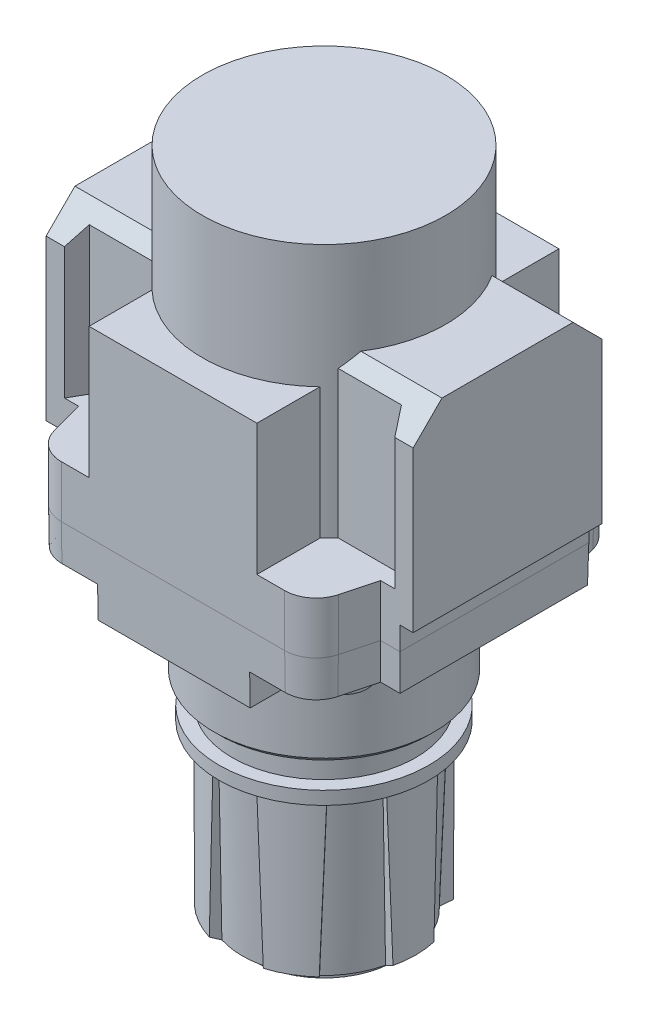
ISO-10303-21;
HEADER;
FILE_DESCRIPTION(('STEP AP214'),'2;1');
FILE_NAME('part.step','',(''),(''),'','','');
FILE_SCHEMA(('AUTOMOTIVE_DESIGN { 1 0 10303 214 1 1 1 1 }'));
ENDSEC;
DATA;
#1=APPLICATION_CONTEXT('core data for automotive mechanical design processes');
#2=APPLICATION_PROTOCOL_DEFINITION('international standard','automotive_design',2000,#1);
#3=PRODUCT_CONTEXT('',#1,'mechanical');
#4=PRODUCT('Part','Part','',(#3));
#5=PRODUCT_RELATED_PRODUCT_CATEGORY('part','',(#4));
#6=PRODUCT_DEFINITION_FORMATION('','',#4);
#7=PRODUCT_DEFINITION_CONTEXT('part definition',#1,'design');
#8=PRODUCT_DEFINITION('design','',#6,#7);
#9=PRODUCT_DEFINITION_SHAPE('','',#8);
#10=(LENGTH_UNIT() NAMED_UNIT(*) SI_UNIT(.MILLI.,.METRE.));
#11=(NAMED_UNIT(*) PLANE_ANGLE_UNIT() SI_UNIT($,.RADIAN.));
#12=(NAMED_UNIT(*) SI_UNIT($,.STERADIAN.) SOLID_ANGLE_UNIT());
#13=UNCERTAINTY_MEASURE_WITH_UNIT(LENGTH_MEASURE(1.E-05),#10,'distance_accuracy_value','');
#14=(GEOMETRIC_REPRESENTATION_CONTEXT(3) GLOBAL_UNCERTAINTY_ASSIGNED_CONTEXT((#13)) GLOBAL_UNIT_ASSIGNED_CONTEXT((#10,
#11,#12)) REPRESENTATION_CONTEXT('',''));
#15=CARTESIAN_POINT('',(0.,0.,0.));
#16=DIRECTION('',(0.,0.,1.));
#17=DIRECTION('',(1.,0.,0.));
#18=AXIS2_PLACEMENT_3D('',#15,#16,#17);
#19=CARTESIAN_POINT('',(0.,-31.0895183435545,0.));
#20=DIRECTION('',(0.,1.,0.));
#21=DIRECTION('',(0.,0.,1.));
#22=AXIS2_PLACEMENT_3D('',#19,#20,#21);
#23=CYLINDRICAL_SURFACE('',#22,17.5);
#24=CARTESIAN_POINT('',(0.,-89.,0.));
#25=DIRECTION('',(0.,1.,0.));
#26=DIRECTION('',(0.,0.,1.));
#27=AXIS2_PLACEMENT_3D('',#24,#25,#26);
#28=CIRCLE('',#27,17.5);
#29=CARTESIAN_POINT('',(-17.0593162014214,-89.,-3.90252876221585));
#30=VERTEX_POINT('',#29);
#31=CARTESIAN_POINT('',(-17.0593162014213,-89.,3.9025287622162));
#32=VERTEX_POINT('',#31);
#33=EDGE_CURVE('E1690',#30,#32,#28,.T.);
#34=ORIENTED_EDGE('',*,*,#33,.T.);
#35=CARTESIAN_POINT('',(0.,-92.,0.));
#36=DIRECTION('',(-0.217029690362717,0.034899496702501,-0.975540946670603));
#37=DIRECTION('',(0.00757884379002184,0.999390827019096,0.0340666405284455));
#38=AXIS2_PLACEMENT_3D('',#35,#36,#37);
#39=ELLIPSE('',#38,501.439896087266,17.5);
#40=CARTESIAN_POINT('',(-16.7940573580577,-58.9,4.9203289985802));
#41=VERTEX_POINT('',#40);
#42=EDGE_CURVE('E1689',#41,#32,#39,.F.);
#43=ORIENTED_EDGE('',*,*,#42,.F.);
#44=CARTESIAN_POINT('',(0.,-58.9,0.));
#45=DIRECTION('',(0.,1.,0.));
#46=DIRECTION('',(0.,0.,1.));
#47=AXIS2_PLACEMENT_3D('',#44,#45,#46);
#48=CIRCLE('',#47,17.5);
#49=CARTESIAN_POINT('',(-16.7940573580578,-58.9,-4.92032899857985));
#50=VERTEX_POINT('',#49);
#51=EDGE_CURVE('E1674',#50,#41,#48,.T.);
#52=ORIENTED_EDGE('',*,*,#51,.F.);
#53=CARTESIAN_POINT('',(0.,-92.,0.));
#54=DIRECTION('',(-0.217029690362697,0.034899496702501,0.975540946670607));
#55=DIRECTION('',(0.00757884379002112,0.999390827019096,-0.0340666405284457));
#56=AXIS2_PLACEMENT_3D('',#53,#54,#55);
#57=ELLIPSE('',#56,501.439896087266,17.5);
#58=EDGE_CURVE('E1687',#30,#50,#57,.F.);
#59=ORIENTED_EDGE('',*,*,#58,.F.);
#60=EDGE_LOOP('',(#34,#43,#52,#59));
#61=FACE_BOUND('',#60,.T.);
#62=ADVANCED_FACE('F34',(#61),#23,.T.);
#63=CARTESIAN_POINT('',(-5.14996905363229,-89.,-16.7250655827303));
#64=VERTEX_POINT('',#63);
#65=CARTESIAN_POINT('',(-11.9093471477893,-89.,-12.8225368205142));
#66=VERTEX_POINT('',#65);
#67=EDGE_CURVE('E1797',#64,#66,#28,.T.);
#68=ORIENTED_EDGE('',*,*,#67,.T.);
#69=CARTESIAN_POINT('',(0.,-92.0000000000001,0.));
#70=DIRECTION('',(0.736328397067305,0.034899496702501,-0.675723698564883));
#71=DIRECTION('',(-0.0257131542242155,0.999390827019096,0.0235967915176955));
#72=AXIS2_PLACEMENT_3D('',#69,#70,#71);
#73=ELLIPSE('',#72,501.439896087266,17.5);
#74=CARTESIAN_POINT('',(-12.6581585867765,-58.9,-12.0839158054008));
#75=VERTEX_POINT('',#74);
#76=EDGE_CURVE('E1757',#75,#66,#73,.F.);
#77=ORIENTED_EDGE('',*,*,#76,.F.);
#78=CARTESIAN_POINT('',(-4.13589877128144,-58.9,-17.0042448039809));
#79=VERTEX_POINT('',#78);
#80=EDGE_CURVE('E1669',#79,#75,#48,.T.);
#81=ORIENTED_EDGE('',*,*,#80,.F.);
#82=CARTESIAN_POINT('',(0.,-92.0000000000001,0.));
#83=DIRECTION('',(-0.953358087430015,0.034899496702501,0.299817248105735));
#84=DIRECTION('',(0.0332919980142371,0.999390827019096,-0.0104698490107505));
#85=AXIS2_PLACEMENT_3D('',#82,#83,#84);
#86=ELLIPSE('',#85,501.439896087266,17.5);
#87=EDGE_CURVE('E1780',#64,#79,#86,.F.);
#88=ORIENTED_EDGE('',*,*,#87,.F.);
#89=EDGE_LOOP('',(#68,#77,#81,#88));
#90=FACE_BOUND('',#89,.T.);
#91=ADVANCED_FACE('F1507',(#90),#23,.T.);
#92=CARTESIAN_POINT('',(11.9093471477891,-89.,-12.8225368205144));
#93=VERTEX_POINT('',#92);
#94=CARTESIAN_POINT('',(5.14996905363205,-89.,-16.7250655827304));
#95=VERTEX_POINT('',#94);
#96=EDGE_CURVE('E1799',#93,#95,#28,.T.);
#97=ORIENTED_EDGE('',*,*,#96,.T.);
#98=CARTESIAN_POINT('',(0.,-92.0000000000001,0.));
#99=DIRECTION('',(0.953358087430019,0.034899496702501,0.299817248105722));
#100=DIRECTION('',(-0.0332919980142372,0.999390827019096,-0.0104698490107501));
#101=AXIS2_PLACEMENT_3D('',#98,#99,#100);
#102=ELLIPSE('',#101,501.439896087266,17.5);
#103=CARTESIAN_POINT('',(4.13589877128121,-58.9,-17.004244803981));
#104=VERTEX_POINT('',#103);
#105=EDGE_CURVE('E1636',#104,#95,#102,.F.);
#106=ORIENTED_EDGE('',*,*,#105,.F.);
#107=CARTESIAN_POINT('',(12.6581585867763,-58.9,-12.083915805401));
#108=VERTEX_POINT('',#107);
#109=EDGE_CURVE('E1667',#108,#104,#48,.T.);
#110=ORIENTED_EDGE('',*,*,#109,.F.);
#111=CARTESIAN_POINT('',(0.,-92.0000000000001,0.));
#112=DIRECTION('',(-0.736328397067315,0.034899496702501,-0.675723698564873));
#113=DIRECTION('',(0.0257131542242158,0.999390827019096,0.0235967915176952));
#114=AXIS2_PLACEMENT_3D('',#111,#112,#113);
#115=ELLIPSE('',#114,501.439896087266,17.5);
#116=EDGE_CURVE('E1622',#93,#108,#115,.F.);
#117=ORIENTED_EDGE('',*,*,#116,.F.);
#118=EDGE_LOOP('',(#97,#106,#110,#117));
#119=FACE_BOUND('',#118,.T.);
#120=ADVANCED_FACE('F1513',(#119),#23,.T.);
#121=CARTESIAN_POINT('',(17.0593162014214,-89.,3.90252876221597));
#122=VERTEX_POINT('',#121);
#123=CARTESIAN_POINT('',(17.0593162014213,-89.,-3.90252876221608));
#124=VERTEX_POINT('',#123);
#125=EDGE_CURVE('E707',#122,#124,#28,.T.);
#126=ORIENTED_EDGE('',*,*,#125,.T.);
#127=CARTESIAN_POINT('',(0.,-92.,0.));
#128=DIRECTION('',(0.21702969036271,0.034899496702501,0.975540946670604));
#129=DIRECTION('',(-0.0075788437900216,0.999390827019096,-0.0340666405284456));
#130=AXIS2_PLACEMENT_3D('',#127,#128,#129);
#131=ELLIPSE('',#130,501.439896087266,17.5);
#132=CARTESIAN_POINT('',(16.7940573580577,-58.9,-4.92032899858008));
#133=VERTEX_POINT('',#132);
#134=EDGE_CURVE('E1607',#133,#124,#131,.F.);
#135=ORIENTED_EDGE('',*,*,#134,.F.);
#136=CARTESIAN_POINT('',(16.7940573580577,-58.9,4.92032899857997));
#137=VERTEX_POINT('',#136);
#138=EDGE_CURVE('E860',#137,#133,#48,.T.);
#139=ORIENTED_EDGE('',*,*,#138,.F.);
#140=CARTESIAN_POINT('',(0.,-92.,0.));
#141=DIRECTION('',(0.217029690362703,0.034899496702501,-0.975540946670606));
#142=DIRECTION('',(-0.00757884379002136,0.999390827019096,0.0340666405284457));
#143=AXIS2_PLACEMENT_3D('',#140,#141,#142);
#144=ELLIPSE('',#143,501.439896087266,17.5);
#145=EDGE_CURVE('E1553',#122,#137,#144,.F.);
#146=ORIENTED_EDGE('',*,*,#145,.F.);
#147=EDGE_LOOP('',(#126,#135,#139,#146));
#148=FACE_BOUND('',#147,.T.);
#149=ADVANCED_FACE('F1530',(#148),#23,.T.);
#150=CARTESIAN_POINT('',(5.14996905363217,-89.,16.7250655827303));
#151=VERTEX_POINT('',#150);
#152=CARTESIAN_POINT('',(11.9093471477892,-89.,12.8225368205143));
#153=VERTEX_POINT('',#152);
#154=EDGE_CURVE('E703',#151,#153,#28,.T.);
#155=ORIENTED_EDGE('',*,*,#154,.T.);
#156=CARTESIAN_POINT('',(0.,-92.0000000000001,0.));
#157=DIRECTION('',(-0.73632839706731,0.034899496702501,0.675723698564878));
#158=DIRECTION('',(0.0257131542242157,0.999390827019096,-0.0235967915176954));
#159=AXIS2_PLACEMENT_3D('',#156,#157,#158);
#160=ELLIPSE('',#159,501.439896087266,17.5);
#161=CARTESIAN_POINT('',(12.6581585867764,-58.9,12.0839158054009));
#162=VERTEX_POINT('',#161);
#163=EDGE_CURVE('E841',#162,#153,#160,.F.);
#164=ORIENTED_EDGE('',*,*,#163,.F.);
#165=CARTESIAN_POINT('',(4.13589877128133,-58.9,17.004244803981));
#166=VERTEX_POINT('',#165);
#167=EDGE_CURVE('E856',#166,#162,#48,.T.);
#168=ORIENTED_EDGE('',*,*,#167,.F.);
#169=CARTESIAN_POINT('',(0.,-92.0000000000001,0.));
#170=DIRECTION('',(0.953358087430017,0.034899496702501,-0.299817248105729));
#171=DIRECTION('',(-0.0332919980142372,0.999390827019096,0.0104698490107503));
#172=AXIS2_PLACEMENT_3D('',#169,#170,#171);
#173=ELLIPSE('',#172,501.439896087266,17.5);
#174=EDGE_CURVE('E849',#151,#166,#173,.F.);
#175=ORIENTED_EDGE('',*,*,#174,.F.);
#176=EDGE_LOOP('',(#155,#164,#168,#175));
#177=FACE_BOUND('',#176,.T.);
#178=ADVANCED_FACE('F1520',(#177),#23,.T.);
#179=CARTESIAN_POINT('',(-21.2960380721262,-35.4,-22.8));
#180=DIRECTION('',(0.,-1.,0.));
#181=DIRECTION('',(0.,0.,-1.));
#182=AXIS2_PLACEMENT_3D('',#179,#180,#181);
#183=PLANE('',#182);
#184=CARTESIAN_POINT('',(0.,-35.4,0.));
#185=DIRECTION('',(0.,-1.,0.));
#186=DIRECTION('',(0.,0.,-1.));
#187=AXIS2_PLACEMENT_3D('',#184,#185,#186);
#188=CIRCLE('',#187,21.);
#189=CARTESIAN_POINT('',(-20.7062792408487,-35.4,-3.5));
#190=VERTEX_POINT('',#189);
#191=CARTESIAN_POINT('',(-17.2304171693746,-35.4,-12.0046959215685));
#192=VERTEX_POINT('',#191);
#193=EDGE_CURVE('E897',#190,#192,#188,.T.);
#194=ORIENTED_EDGE('',*,*,#193,.F.);
#195=DIRECTION('',(1.,0.,0.));
#196=VECTOR('',#195,1.);
#197=CARTESIAN_POINT('',(0.,-35.4,-3.5));
#198=LINE('',#197,#196);
#199=CARTESIAN_POINT('',(-21.,-35.4,-3.5));
#200=VERTEX_POINT('',#199);
#201=EDGE_CURVE('E869',#200,#190,#198,.T.);
#202=ORIENTED_EDGE('',*,*,#201,.F.);
#203=CARTESIAN_POINT('',(-21.,-35.4,0.));
#204=DIRECTION('',(0.,-1.,0.));
#205=DIRECTION('',(0.,0.,1.));
#206=AXIS2_PLACEMENT_3D('',#203,#204,#205);
#207=CIRCLE('',#206,3.5);
#208=CARTESIAN_POINT('',(-21.,-35.4,3.5));
#209=VERTEX_POINT('',#208);
#210=EDGE_CURVE('E874',#209,#200,#207,.T.);
#211=ORIENTED_EDGE('',*,*,#210,.F.);
#212=DIRECTION('',(-1.,0.,0.));
#213=VECTOR('',#212,1.);
#214=CARTESIAN_POINT('',(0.,-35.4,3.5));
#215=LINE('',#214,#213);
#216=CARTESIAN_POINT('',(-20.7062792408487,-35.4,3.5));
#217=VERTEX_POINT('',#216);
#218=EDGE_CURVE('E881',#217,#209,#215,.T.);
#219=ORIENTED_EDGE('',*,*,#218,.F.);
#220=CARTESIAN_POINT('',(-17.2304171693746,-35.4,12.0046959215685));
#221=VERTEX_POINT('',#220);
#222=EDGE_CURVE('E3125',#221,#217,#188,.T.);
#223=ORIENTED_EDGE('',*,*,#222,.F.);
#224=CARTESIAN_POINT('',(-21.,-35.4,17.3));
#225=DIRECTION('',(0.,-1.,0.));
#226=DIRECTION('',(0.,0.,-1.));
#227=AXIS2_PLACEMENT_3D('',#224,#225,#226);
#228=CIRCLE('',#227,6.5);
#229=CARTESIAN_POINT('',(-21.,-35.4,10.8));
#230=VERTEX_POINT('',#229);
#231=EDGE_CURVE('E1009',#230,#221,#228,.T.);
#232=ORIENTED_EDGE('',*,*,#231,.F.);
#233=DIRECTION('',(1.,0.,0.));
#234=VECTOR('',#233,1.);
#235=CARTESIAN_POINT('',(-21.2960380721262,-35.4,10.8));
#236=LINE('',#235,#234);
#237=CARTESIAN_POINT('',(-26.3,-35.4,10.8));
#238=VERTEX_POINT('',#237);
#239=EDGE_CURVE('E1441',#238,#230,#236,.T.);
#240=ORIENTED_EDGE('',*,*,#239,.F.);
#241=DIRECTION('',(0.,0.,1.));
#242=VECTOR('',#241,1.);
#243=CARTESIAN_POINT('',(-26.3,-35.4,-28.8));
#244=LINE('',#243,#242);
#245=CARTESIAN_POINT('',(-26.3,-35.4,-10.8));
#246=VERTEX_POINT('',#245);
#247=EDGE_CURVE('E895',#246,#238,#244,.T.);
#248=ORIENTED_EDGE('',*,*,#247,.F.);
#249=DIRECTION('',(-1.,0.,0.));
#250=VECTOR('',#249,1.);
#251=CARTESIAN_POINT('',(-21.,-35.4,-10.8));
#252=LINE('',#251,#250);
#253=CARTESIAN_POINT('',(-21.,-35.4,-10.8));
#254=VERTEX_POINT('',#253);
#255=EDGE_CURVE('E970',#254,#246,#252,.T.);
#256=ORIENTED_EDGE('',*,*,#255,.F.);
#257=CARTESIAN_POINT('',(-21.,-35.4,-17.3));
#258=DIRECTION('',(0.,-1.,0.));
#259=DIRECTION('',(0.,0.,1.));
#260=AXIS2_PLACEMENT_3D('',#257,#258,#259);
#261=CIRCLE('',#260,6.5);
#262=EDGE_CURVE('E965',#192,#254,#261,.T.);
#263=ORIENTED_EDGE('',*,*,#262,.F.);
#264=EDGE_LOOP('',(#194,#202,#211,#219,#223,#232,#240,#248,#256,#263));
#265=FACE_BOUND('',#264,.T.);
#266=ADVANCED_FACE('F1529',(#265),#183,.T.);
#267=CARTESIAN_POINT('',(0.,-51.4,0.));
#268=DIRECTION('',(0.,1.,0.));
#269=DIRECTION('',(0.,0.,1.));
#270=AXIS2_PLACEMENT_3D('',#267,#268,#269);
#271=CYLINDRICAL_SURFACE('',#270,21.);
#272=CARTESIAN_POINT('',(0.,-50.4,0.));
#273=DIRECTION('',(0.,-1.,0.));
#274=DIRECTION('',(0.,0.,-1.));
#275=AXIS2_PLACEMENT_3D('',#272,#273,#274);
#276=CIRCLE('',#275,21.);
#277=CARTESIAN_POINT('',(0.,-50.4,-21.));
#278=VERTEX_POINT('',#277);
#279=EDGE_CURVE('E1467',#278,#278,#276,.F.);
#280=ORIENTED_EDGE('',*,*,#279,.T.);
#281=EDGE_LOOP('',(#280));
#282=FACE_BOUND('',#281,.T.);
#283=DIRECTION('',(0.,1.,0.));
#284=VECTOR('',#283,1.);
#285=CARTESIAN_POINT('',(-20.7062792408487,-51.4,-3.5));
#286=LINE('',#285,#284);
#287=CARTESIAN_POINT('',(-20.7062792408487,-37.4,-3.5));
#288=VERTEX_POINT('',#287);
#289=EDGE_CURVE('E1477',#190,#288,#286,.F.);
#290=ORIENTED_EDGE('',*,*,#289,.F.);
#291=ORIENTED_EDGE('',*,*,#193,.T.);
#292=CARTESIAN_POINT('',(-15.0810283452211,-35.4,-14.6137806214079));
#293=VERTEX_POINT('',#292);
#294=EDGE_CURVE('E891',#192,#293,#188,.T.);
#295=ORIENTED_EDGE('',*,*,#294,.T.);
#296=CARTESIAN_POINT('',(15.0810283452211,-35.4,-14.6137806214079));
#297=VERTEX_POINT('',#296);
#298=EDGE_CURVE('E898',#293,#297,#188,.T.);
#299=ORIENTED_EDGE('',*,*,#298,.T.);
#300=CARTESIAN_POINT('',(17.2304171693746,-35.4,-12.0046959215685));
#301=VERTEX_POINT('',#300);
#302=EDGE_CURVE('E892',#297,#301,#188,.T.);
#303=ORIENTED_EDGE('',*,*,#302,.T.);
#304=CARTESIAN_POINT('',(17.2304171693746,-35.4,12.0046959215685));
#305=VERTEX_POINT('',#304);
#306=EDGE_CURVE('E1468',#301,#305,#188,.T.);
#307=ORIENTED_EDGE('',*,*,#306,.T.);
#308=CARTESIAN_POINT('',(15.0810283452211,-35.4,14.6137806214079));
#309=VERTEX_POINT('',#308);
#310=EDGE_CURVE('E896',#305,#309,#188,.T.);
#311=ORIENTED_EDGE('',*,*,#310,.T.);
#312=CARTESIAN_POINT('',(-15.0810283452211,-35.4,14.6137806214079));
#313=VERTEX_POINT('',#312);
#314=EDGE_CURVE('E3121',#309,#313,#188,.T.);
#315=ORIENTED_EDGE('',*,*,#314,.T.);
#316=EDGE_CURVE('E3130',#313,#221,#188,.T.);
#317=ORIENTED_EDGE('',*,*,#316,.T.);
#318=ORIENTED_EDGE('',*,*,#222,.T.);
#319=DIRECTION('',(0.,1.,0.));
#320=VECTOR('',#319,1.);
#321=CARTESIAN_POINT('',(-20.7062792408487,-51.4,3.5));
#322=LINE('',#321,#320);
#323=CARTESIAN_POINT('',(-20.7062792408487,-37.4,3.5));
#324=VERTEX_POINT('',#323);
#325=EDGE_CURVE('E1474',#324,#217,#322,.T.);
#326=ORIENTED_EDGE('',*,*,#325,.F.);
#327=CARTESIAN_POINT('',(0.,-37.4,0.));
#328=DIRECTION('',(0.,1.,0.));
#329=DIRECTION('',(0.,0.,1.));
#330=AXIS2_PLACEMENT_3D('',#327,#328,#329);
#331=CIRCLE('',#330,21.);
#332=EDGE_CURVE('E1471',#288,#324,#331,.T.);
#333=ORIENTED_EDGE('',*,*,#332,.F.);
#334=EDGE_LOOP('',(#290,#291,#295,#299,#303,#307,#311,#315,#317,#318,#326,#333));
#335=FACE_BOUND('',#334,.T.);
#336=ADVANCED_FACE('F1536',(#282,#335),#271,.T.);
#337=ORIENTED_EDGE('',*,*,#306,.F.);
#338=CARTESIAN_POINT('',(21.,-35.4,-17.3));
#339=DIRECTION('',(0.,-1.,0.));
#340=DIRECTION('',(0.,0.,-1.));
#341=AXIS2_PLACEMENT_3D('',#338,#339,#340);
#342=CIRCLE('',#341,6.5);
#343=CARTESIAN_POINT('',(21.,-35.4,-10.8));
#344=VERTEX_POINT('',#343);
#345=EDGE_CURVE('E943',#344,#301,#342,.T.);
#346=ORIENTED_EDGE('',*,*,#345,.F.);
#347=DIRECTION('',(-1.,0.,0.));
#348=VECTOR('',#347,1.);
#349=CARTESIAN_POINT('',(-21.2960380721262,-35.4,-10.8));
#350=LINE('',#349,#348);
#351=CARTESIAN_POINT('',(26.3,-35.4,-10.8));
#352=VERTEX_POINT('',#351);
#353=EDGE_CURVE('E1450',#352,#344,#350,.T.);
#354=ORIENTED_EDGE('',*,*,#353,.F.);
#355=DIRECTION('',(0.,0.,1.));
#356=VECTOR('',#355,1.);
#357=CARTESIAN_POINT('',(26.3,-35.4,-28.8));
#358=LINE('',#357,#356);
#359=CARTESIAN_POINT('',(26.3,-35.4,10.8));
#360=VERTEX_POINT('',#359);
#361=EDGE_CURVE('E907',#352,#360,#358,.T.);
#362=ORIENTED_EDGE('',*,*,#361,.T.);
#363=DIRECTION('',(1.,0.,0.));
#364=VECTOR('',#363,1.);
#365=CARTESIAN_POINT('',(21.,-35.4,10.8));
#366=LINE('',#365,#364);
#367=CARTESIAN_POINT('',(21.,-35.4,10.8));
#368=VERTEX_POINT('',#367);
#369=EDGE_CURVE('E1034',#368,#360,#366,.T.);
#370=ORIENTED_EDGE('',*,*,#369,.F.);
#371=CARTESIAN_POINT('',(21.,-35.4,17.3));
#372=DIRECTION('',(0.,-1.,0.));
#373=DIRECTION('',(0.,0.,1.));
#374=AXIS2_PLACEMENT_3D('',#371,#372,#373);
#375=CIRCLE('',#374,6.5);
#376=EDGE_CURVE('E1030',#305,#368,#375,.T.);
#377=ORIENTED_EDGE('',*,*,#376,.F.);
#378=EDGE_LOOP('',(#337,#346,#354,#362,#370,#377));
#379=FACE_BOUND('',#378,.T.);
#380=ADVANCED_FACE('F1539',(#379),#183,.T.);
#381=ORIENTED_EDGE('',*,*,#314,.F.);
#382=CARTESIAN_POINT('',(14.5,-35.4,17.3));
#383=VERTEX_POINT('',#382);
#384=EDGE_CURVE('E1041',#383,#309,#375,.T.);
#385=ORIENTED_EDGE('',*,*,#384,.F.);
#386=DIRECTION('',(0.,0.,-1.));
#387=VECTOR('',#386,1.);
#388=CARTESIAN_POINT('',(14.5,-35.4,-22.8));
#389=LINE('',#388,#387);
#390=CARTESIAN_POINT('',(14.5,-35.4,28.5730841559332));
#391=VERTEX_POINT('',#390);
#392=EDGE_CURVE('E1435',#391,#383,#389,.T.);
#393=ORIENTED_EDGE('',*,*,#392,.F.);
#394=DIRECTION('',(1.,0.,0.));
#395=VECTOR('',#394,1.);
#396=CARTESIAN_POINT('',(21.2960380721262,-35.4,28.5730841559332));
#397=LINE('',#396,#395);
#398=CARTESIAN_POINT('',(-14.5,-35.4,28.5730841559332));
#399=VERTEX_POINT('',#398);
#400=EDGE_CURVE('E1072',#391,#399,#397,.F.);
#401=ORIENTED_EDGE('',*,*,#400,.T.);
#402=DIRECTION('',(0.,0.,1.));
#403=VECTOR('',#402,1.);
#404=CARTESIAN_POINT('',(-14.5,-35.4,28.8));
#405=LINE('',#404,#403);
#406=CARTESIAN_POINT('',(-14.5,-35.4,17.3));
#407=VERTEX_POINT('',#406);
#408=EDGE_CURVE('E1003',#407,#399,#405,.T.);
#409=ORIENTED_EDGE('',*,*,#408,.F.);
#410=EDGE_CURVE('E998',#313,#407,#228,.T.);
#411=ORIENTED_EDGE('',*,*,#410,.F.);
#412=EDGE_LOOP('',(#381,#385,#393,#401,#409,#411));
#413=FACE_BOUND('',#412,.T.);
#414=ADVANCED_FACE('F2142',(#413),#183,.T.);
#415=CARTESIAN_POINT('',(-21.,-29.4,17.3));
#416=DIRECTION('',(0.,-1.,0.));
#417=DIRECTION('',(0.,0.,-1.));
#418=AXIS2_PLACEMENT_3D('',#415,#416,#417);
#419=PLANE('',#418);
#420=CARTESIAN_POINT('',(-21.2960380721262,-29.4,22.8));
#421=DIRECTION('',(0.,-1.,0.));
#422=DIRECTION('',(0.,0.,-1.));
#423=AXIS2_PLACEMENT_3D('',#420,#421,#422);
#424=CIRCLE('',#423,5.87781454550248);
#425=CARTESIAN_POINT('',(-21.2960380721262,-29.4,28.6778145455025));
#426=VERTEX_POINT('',#425);
#427=CARTESIAN_POINT('',(-26.9735709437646,-29.4,24.3212903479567));
#428=VERTEX_POINT('',#427);
#429=EDGE_CURVE('E1026',#426,#428,#424,.T.);
#430=ORIENTED_EDGE('',*,*,#429,.T.);
#431=DIRECTION('',(0.258819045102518,0.,0.965925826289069));
#432=VECTOR('',#431,1.);
#433=CARTESIAN_POINT('',(-26.9735709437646,-29.4,24.3212903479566));
#434=LINE('',#433,#432);
#435=CARTESIAN_POINT('',(-28.7000950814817,-29.4,17.8778145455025));
#436=VERTEX_POINT('',#435);
#437=EDGE_CURVE('E1024',#428,#436,#434,.F.);
#438=ORIENTED_EDGE('',*,*,#437,.T.);
#439=DIRECTION('',(1.,0.,0.));
#440=VECTOR('',#439,1.);
#441=CARTESIAN_POINT('',(-28.7938512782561,-29.4,17.8778145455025));
#442=LINE('',#441,#440);
#443=CARTESIAN_POINT('',(-32.3778145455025,-29.4,17.8778145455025));
#444=VERTEX_POINT('',#443);
#445=EDGE_CURVE('E1022',#436,#444,#442,.F.);
#446=ORIENTED_EDGE('',*,*,#445,.T.);
#447=DIRECTION('',(0.,0.,1.));
#448=VECTOR('',#447,1.);
#449=CARTESIAN_POINT('',(-32.3778145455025,-29.4,18.));
#450=LINE('',#449,#448);
#451=CARTESIAN_POINT('',(-32.3778145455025,-29.4,-17.8778145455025));
#452=VERTEX_POINT('',#451);
#453=EDGE_CURVE('E1443',#444,#452,#450,.F.);
#454=ORIENTED_EDGE('',*,*,#453,.T.);
#455=DIRECTION('',(1.,0.,0.));
#456=VECTOR('',#455,1.);
#457=CARTESIAN_POINT('',(-32.5,-29.4,-17.8778145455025));
#458=LINE('',#457,#456);
#459=CARTESIAN_POINT('',(-28.7000950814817,-29.4,-17.8778145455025));
#460=VERTEX_POINT('',#459);
#461=EDGE_CURVE('E990',#460,#452,#458,.F.);
#462=ORIENTED_EDGE('',*,*,#461,.F.);
#463=DIRECTION('',(0.258819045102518,0.,-0.965925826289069));
#464=VECTOR('',#463,1.);
#465=CARTESIAN_POINT('',(-28.6758291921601,-29.4,-17.9683760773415));
#466=LINE('',#465,#464);
#467=CARTESIAN_POINT('',(-26.9735709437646,-29.4,-24.3212903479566));
#468=VERTEX_POINT('',#467);
#469=EDGE_CURVE('E1447',#468,#460,#466,.F.);
#470=ORIENTED_EDGE('',*,*,#469,.F.);
#471=CARTESIAN_POINT('',(-21.2960380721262,-29.4,-22.8));
#472=DIRECTION('',(0.,1.,0.));
#473=DIRECTION('',(0.,0.,1.));
#474=AXIS2_PLACEMENT_3D('',#471,#472,#473);
#475=CIRCLE('',#474,5.87781454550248);
#476=CARTESIAN_POINT('',(-21.2960380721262,-29.4,-28.6778145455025));
#477=VERTEX_POINT('',#476);
#478=EDGE_CURVE('E993',#477,#468,#475,.T.);
#479=ORIENTED_EDGE('',*,*,#478,.F.);
#480=DIRECTION('',(1.,0.,0.));
#481=VECTOR('',#480,1.);
#482=CARTESIAN_POINT('',(-21.2960380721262,-29.4,-28.6778145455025));
#483=LINE('',#482,#481);
#484=CARTESIAN_POINT('',(-14.5,-29.4,-28.6778145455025));
#485=VERTEX_POINT('',#484);
#486=EDGE_CURVE('E995',#485,#477,#483,.F.);
#487=ORIENTED_EDGE('',*,*,#486,.F.);
#488=DIRECTION('',(0.,0.,1.));
#489=VECTOR('',#488,1.);
#490=CARTESIAN_POINT('',(-14.5,-29.4,-28.8));
#491=LINE('',#490,#489);
#492=CARTESIAN_POINT('',(-14.5,-29.4,-17.3));
#493=VERTEX_POINT('',#492);
#494=EDGE_CURVE('E973',#485,#493,#491,.T.);
#495=ORIENTED_EDGE('',*,*,#494,.T.);
#496=CARTESIAN_POINT('',(-21.,-29.4,-17.3));
#497=DIRECTION('',(0.,-1.,0.));
#498=DIRECTION('',(0.,0.,1.));
#499=AXIS2_PLACEMENT_3D('',#496,#497,#498);
#500=CIRCLE('',#499,6.5);
#501=CARTESIAN_POINT('',(-21.,-29.4,-10.8));
#502=VERTEX_POINT('',#501);
#503=EDGE_CURVE('E966',#493,#502,#500,.T.);
#504=ORIENTED_EDGE('',*,*,#503,.T.);
#505=DIRECTION('',(-1.,0.,0.));
#506=VECTOR('',#505,1.);
#507=CARTESIAN_POINT('',(-21.,-29.4,-10.8));
#508=LINE('',#507,#506);
#509=CARTESIAN_POINT('',(-26.3,-29.4,-10.8));
#510=VERTEX_POINT('',#509);
#511=EDGE_CURVE('E969',#502,#510,#508,.T.);
#512=ORIENTED_EDGE('',*,*,#511,.T.);
#513=DIRECTION('',(0.,0.,1.));
#514=VECTOR('',#513,1.);
#515=CARTESIAN_POINT('',(-26.3,-29.4,-28.8));
#516=LINE('',#515,#514);
#517=CARTESIAN_POINT('',(-26.3,-29.4,10.8));
#518=VERTEX_POINT('',#517);
#519=EDGE_CURVE('E899',#510,#518,#516,.T.);
#520=ORIENTED_EDGE('',*,*,#519,.T.);
#521=DIRECTION('',(1.,0.,0.));
#522=VECTOR('',#521,1.);
#523=CARTESIAN_POINT('',(-21.,-29.4,10.8));
#524=LINE('',#523,#522);
#525=CARTESIAN_POINT('',(-21.,-29.4,10.8));
#526=VERTEX_POINT('',#525);
#527=EDGE_CURVE('E1006',#518,#526,#524,.T.);
#528=ORIENTED_EDGE('',*,*,#527,.T.);
#529=CARTESIAN_POINT('',(-21.,-29.4,17.3));
#530=DIRECTION('',(0.,-1.,0.));
#531=DIRECTION('',(0.,0.,-1.));
#532=AXIS2_PLACEMENT_3D('',#529,#530,#531);
#533=CIRCLE('',#532,6.5);
#534=CARTESIAN_POINT('',(-14.5,-29.4,17.3));
#535=VERTEX_POINT('',#534);
#536=EDGE_CURVE('E999',#526,#535,#533,.T.);
#537=ORIENTED_EDGE('',*,*,#536,.T.);
#538=DIRECTION('',(0.,0.,1.));
#539=VECTOR('',#538,1.);
#540=CARTESIAN_POINT('',(-14.5,-29.4,28.8));
#541=LINE('',#540,#539);
#542=CARTESIAN_POINT('',(-14.5,-29.4,28.6778145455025));
#543=VERTEX_POINT('',#542);
#544=EDGE_CURVE('E1002',#535,#543,#541,.T.);
#545=ORIENTED_EDGE('',*,*,#544,.T.);
#546=DIRECTION('',(1.,0.,0.));
#547=VECTOR('',#546,1.);
#548=CARTESIAN_POINT('',(21.2960380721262,-29.4,28.6778145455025));
#549=LINE('',#548,#547);
#550=EDGE_CURVE('E1028',#543,#426,#549,.F.);
#551=ORIENTED_EDGE('',*,*,#550,.T.);
#552=EDGE_LOOP('',(#430,#438,#446,#454,#462,#470,#479,#487,#495,#504,#512,#520,#528,#537,#545,#551));
#553=FACE_BOUND('',#552,.T.);
#554=CARTESIAN_POINT('',(-21.,-29.4,17.3));
#555=DIRECTION('',(0.,-1.,0.));
#556=DIRECTION('',(0.,0.,1.));
#557=AXIS2_PLACEMENT_3D('',#554,#555,#556);
#558=CIRCLE('',#557,4.5);
#559=CARTESIAN_POINT('',(-21.,-29.4,21.8));
#560=VERTEX_POINT('',#559);
#561=EDGE_CURVE('E923',#560,#560,#558,.T.);
#562=ORIENTED_EDGE('',*,*,#561,.F.);
#563=EDGE_LOOP('',(#562));
#564=FACE_BOUND('',#563,.T.);
#565=CARTESIAN_POINT('',(-21.,-29.4,-17.3));
#566=DIRECTION('',(0.,1.,0.));
#567=DIRECTION('',(0.,0.,1.));
#568=AXIS2_PLACEMENT_3D('',#565,#566,#567);
#569=CIRCLE('',#568,4.5);
#570=CARTESIAN_POINT('',(-21.,-29.4,-12.8));
#571=VERTEX_POINT('',#570);
#572=EDGE_CURVE('E1455',#571,#571,#569,.F.);
#573=ORIENTED_EDGE('',*,*,#572,.F.);
#574=EDGE_LOOP('',(#573));
#575=FACE_BOUND('',#574,.T.);
#576=ADVANCED_FACE('F2154',(#553,#564,#575),#419,.T.);
#577=CARTESIAN_POINT('',(21.,-29.4,17.3));
#578=DIRECTION('',(0.,1.,0.));
#579=DIRECTION('',(0.,0.,1.));
#580=AXIS2_PLACEMENT_3D('',#577,#578,#579);
#581=PLANE('',#580);
#582=DIRECTION('',(1.,0.,0.));
#583=VECTOR('',#582,1.);
#584=CARTESIAN_POINT('',(21.,-29.4,10.8));
#585=LINE('',#584,#583);
#586=CARTESIAN_POINT('',(21.,-29.4,10.8));
#587=VERTEX_POINT('',#586);
#588=CARTESIAN_POINT('',(26.3,-29.4,10.8));
#589=VERTEX_POINT('',#588);
#590=EDGE_CURVE('E1037',#587,#589,#585,.T.);
#591=ORIENTED_EDGE('',*,*,#590,.T.);
#592=DIRECTION('',(0.,0.,1.));
#593=VECTOR('',#592,1.);
#594=CARTESIAN_POINT('',(26.3,-29.4,-28.8));
#595=LINE('',#594,#593);
#596=CARTESIAN_POINT('',(26.3,-29.4,-10.8));
#597=VERTEX_POINT('',#596);
#598=EDGE_CURVE('E906',#597,#589,#595,.T.);
#599=ORIENTED_EDGE('',*,*,#598,.F.);
#600=DIRECTION('',(-1.,0.,0.));
#601=VECTOR('',#600,1.);
#602=CARTESIAN_POINT('',(21.,-29.4,-10.8));
#603=LINE('',#602,#601);
#604=CARTESIAN_POINT('',(21.,-29.4,-10.8));
#605=VERTEX_POINT('',#604);
#606=EDGE_CURVE('E940',#597,#605,#603,.T.);
#607=ORIENTED_EDGE('',*,*,#606,.T.);
#608=CARTESIAN_POINT('',(21.,-29.4,-17.3));
#609=DIRECTION('',(0.,-1.,0.));
#610=DIRECTION('',(0.,0.,-1.));
#611=AXIS2_PLACEMENT_3D('',#608,#609,#610);
#612=CIRCLE('',#611,6.5);
#613=CARTESIAN_POINT('',(14.5,-29.4,-17.3));
#614=VERTEX_POINT('',#613);
#615=EDGE_CURVE('E933',#605,#614,#612,.T.);
#616=ORIENTED_EDGE('',*,*,#615,.T.);
#617=DIRECTION('',(0.,0.,-1.));
#618=VECTOR('',#617,1.);
#619=CARTESIAN_POINT('',(14.5,-29.4,-28.8));
#620=LINE('',#619,#618);
#621=CARTESIAN_POINT('',(14.5,-29.4,-28.6778145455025));
#622=VERTEX_POINT('',#621);
#623=EDGE_CURVE('E936',#614,#622,#620,.T.);
#624=ORIENTED_EDGE('',*,*,#623,.T.);
#625=DIRECTION('',(-1.,0.,0.));
#626=VECTOR('',#625,1.);
#627=CARTESIAN_POINT('',(-21.2960380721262,-29.4,-28.6778145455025));
#628=LINE('',#627,#626);
#629=CARTESIAN_POINT('',(21.2960380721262,-29.4,-28.6778145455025));
#630=VERTEX_POINT('',#629);
#631=EDGE_CURVE('E963',#622,#630,#628,.F.);
#632=ORIENTED_EDGE('',*,*,#631,.T.);
#633=CARTESIAN_POINT('',(21.2960380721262,-29.4,-22.8));
#634=DIRECTION('',(0.,-1.,0.));
#635=DIRECTION('',(0.,0.,-1.));
#636=AXIS2_PLACEMENT_3D('',#633,#634,#635);
#637=CIRCLE('',#636,5.87781454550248);
#638=CARTESIAN_POINT('',(26.9735709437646,-29.4,-24.3212903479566));
#639=VERTEX_POINT('',#638);
#640=EDGE_CURVE('E961',#630,#639,#637,.T.);
#641=ORIENTED_EDGE('',*,*,#640,.T.);
#642=DIRECTION('',(-0.258819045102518,0.,-0.965925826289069));
#643=VECTOR('',#642,1.);
#644=CARTESIAN_POINT('',(26.9735709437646,-29.4,-24.3212903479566));
#645=LINE('',#644,#643);
#646=CARTESIAN_POINT('',(28.7000950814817,-29.4,-17.8778145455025));
#647=VERTEX_POINT('',#646);
#648=EDGE_CURVE('E959',#639,#647,#645,.F.);
#649=ORIENTED_EDGE('',*,*,#648,.T.);
#650=DIRECTION('',(-1.,0.,0.));
#651=VECTOR('',#650,1.);
#652=CARTESIAN_POINT('',(28.7938512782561,-29.4,-17.8778145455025));
#653=LINE('',#652,#651);
#654=CARTESIAN_POINT('',(32.3778145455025,-29.4,-17.8778145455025));
#655=VERTEX_POINT('',#654);
#656=EDGE_CURVE('E956',#647,#655,#653,.F.);
#657=ORIENTED_EDGE('',*,*,#656,.T.);
#658=DIRECTION('',(0.,0.,1.));
#659=VECTOR('',#658,1.);
#660=CARTESIAN_POINT('',(32.3778145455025,-29.4,-18.));
#661=LINE('',#660,#659);
#662=CARTESIAN_POINT('',(32.3778145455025,-29.4,17.8778145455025));
#663=VERTEX_POINT('',#662);
#664=EDGE_CURVE('E1062',#663,#655,#661,.F.);
#665=ORIENTED_EDGE('',*,*,#664,.F.);
#666=DIRECTION('',(-1.,0.,0.));
#667=VECTOR('',#666,1.);
#668=CARTESIAN_POINT('',(32.5,-29.4,17.8778145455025));
#669=LINE('',#668,#667);
#670=CARTESIAN_POINT('',(28.7000950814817,-29.4,17.8778145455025));
#671=VERTEX_POINT('',#670);
#672=EDGE_CURVE('E1059',#671,#663,#669,.F.);
#673=ORIENTED_EDGE('',*,*,#672,.F.);
#674=DIRECTION('',(-0.258819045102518,0.,0.965925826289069));
#675=VECTOR('',#674,1.);
#676=CARTESIAN_POINT('',(28.6758291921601,-29.4,17.9683760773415));
#677=LINE('',#676,#675);
#678=CARTESIAN_POINT('',(26.9735709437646,-29.4,24.3212903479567));
#679=VERTEX_POINT('',#678);
#680=EDGE_CURVE('E1056',#679,#671,#677,.F.);
#681=ORIENTED_EDGE('',*,*,#680,.F.);
#682=CARTESIAN_POINT('',(21.2960380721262,-29.4,22.8));
#683=DIRECTION('',(0.,1.,0.));
#684=DIRECTION('',(0.,0.,1.));
#685=AXIS2_PLACEMENT_3D('',#682,#683,#684);
#686=CIRCLE('',#685,5.87781454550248);
#687=CARTESIAN_POINT('',(21.2960380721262,-29.4,28.6778145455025));
#688=VERTEX_POINT('',#687);
#689=EDGE_CURVE('E1054',#688,#679,#686,.T.);
#690=ORIENTED_EDGE('',*,*,#689,.F.);
#691=DIRECTION('',(-1.,0.,0.));
#692=VECTOR('',#691,1.);
#693=CARTESIAN_POINT('',(21.2960380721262,-29.4,28.6778145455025));
#694=LINE('',#693,#692);
#695=CARTESIAN_POINT('',(14.5,-29.4,28.6778145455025));
#696=VERTEX_POINT('',#695);
#697=EDGE_CURVE('E1438',#696,#688,#694,.F.);
#698=ORIENTED_EDGE('',*,*,#697,.F.);
#699=DIRECTION('',(0.,0.,-1.));
#700=VECTOR('',#699,1.);
#701=CARTESIAN_POINT('',(14.5,-29.4,28.8));
#702=LINE('',#701,#700);
#703=CARTESIAN_POINT('',(14.5,-29.4,17.3));
#704=VERTEX_POINT('',#703);
#705=EDGE_CURVE('E1031',#696,#704,#702,.T.);
#706=ORIENTED_EDGE('',*,*,#705,.T.);
#707=CARTESIAN_POINT('',(21.,-29.4,17.3));
#708=DIRECTION('',(0.,-1.,0.));
#709=DIRECTION('',(0.,0.,1.));
#710=AXIS2_PLACEMENT_3D('',#707,#708,#709);
#711=CIRCLE('',#710,6.5);
#712=EDGE_CURVE('E1033',#704,#587,#711,.T.);
#713=ORIENTED_EDGE('',*,*,#712,.T.);
#714=EDGE_LOOP('',(#591,#599,#607,#616,#624,#632,#641,#649,#657,#665,#673,#681,#690,#698,#706,#713));
#715=FACE_BOUND('',#714,.T.);
#716=CARTESIAN_POINT('',(21.,-29.4,17.3));
#717=DIRECTION('',(0.,1.,0.));
#718=DIRECTION('',(0.,0.,1.));
#719=AXIS2_PLACEMENT_3D('',#716,#717,#718);
#720=CIRCLE('',#719,4.5);
#721=CARTESIAN_POINT('',(21.,-29.4,21.8));
#722=VERTEX_POINT('',#721);
#723=EDGE_CURVE('E1452',#722,#722,#720,.F.);
#724=ORIENTED_EDGE('',*,*,#723,.F.);
#725=EDGE_LOOP('',(#724));
#726=FACE_BOUND('',#725,.T.);
#727=CARTESIAN_POINT('',(21.,-29.4,-17.3));
#728=DIRECTION('',(0.,-1.,0.));
#729=DIRECTION('',(0.,0.,1.));
#730=AXIS2_PLACEMENT_3D('',#727,#728,#729);
#731=CIRCLE('',#730,4.5);
#732=CARTESIAN_POINT('',(21.,-29.4,-12.8));
#733=VERTEX_POINT('',#732);
#734=EDGE_CURVE('E914',#733,#733,#731,.T.);
#735=ORIENTED_EDGE('',*,*,#734,.F.);
#736=EDGE_LOOP('',(#735));
#737=FACE_BOUND('',#736,.T.);
#738=ADVANCED_FACE('F2296',(#715,#726,#737),#581,.F.);
#739=CARTESIAN_POINT('',(21.2960380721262,-22.4,-22.8));
#740=DIRECTION('',(0.,1.,0.));
#741=DIRECTION('',(0.,0.,-1.));
#742=AXIS2_PLACEMENT_3D('',#739,#740,#741);
#743=CONICAL_SURFACE('',#742,6.,0.0174532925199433);
#744=ORIENTED_EDGE('',*,*,#640,.F.);
#745=DIRECTION('',(0.,0.999847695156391,-0.0174524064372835));
#746=VECTOR('',#745,1.);
#747=CARTESIAN_POINT('',(21.2960380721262,-22.4,-28.8));
#748=LINE('',#747,#746);
#749=CARTESIAN_POINT('',(21.2960380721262,-22.4,-28.8));
#750=VERTEX_POINT('',#749);
#751=EDGE_CURVE('E1068',#630,#750,#748,.T.);
#752=ORIENTED_EDGE('',*,*,#751,.T.);
#753=CARTESIAN_POINT('',(21.2960380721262,-22.4,-22.8));
#754=DIRECTION('',(0.,1.,0.));
#755=DIRECTION('',(0.,0.,1.));
#756=AXIS2_PLACEMENT_3D('',#753,#754,#755);
#757=CIRCLE('',#756,6.);
#758=CARTESIAN_POINT('',(27.0915930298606,-22.4,-24.3529142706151));
#759=VERTEX_POINT('',#758);
#760=EDGE_CURVE('E1368',#750,#759,#757,.F.);
#761=ORIENTED_EDGE('',*,*,#760,.T.);
#762=DIRECTION('',(0.0168577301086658,0.999847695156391,-0.00451701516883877));
#763=VECTOR('',#762,1.);
#764=CARTESIAN_POINT('',(27.0915930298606,-22.4,-24.3529142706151));
#765=LINE('',#764,#763);
#766=EDGE_CURVE('E1096',#639,#759,#765,.T.);
#767=ORIENTED_EDGE('',*,*,#766,.F.);
#768=EDGE_LOOP('',(#744,#752,#761,#767));
#769=FACE_BOUND('',#768,.T.);
#770=ADVANCED_FACE('F2290',(#769),#743,.T.);
#771=CARTESIAN_POINT('',(27.0915930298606,-22.4,-24.3529142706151));
#772=DIRECTION('',(0.965778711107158,-0.0174524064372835,-0.258779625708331));
#773=DIRECTION('',(-0.258819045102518,0.,-0.965925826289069));
#774=AXIS2_PLACEMENT_3D('',#771,#772,#773);
#775=PLANE('',#774);
#776=ORIENTED_EDGE('',*,*,#648,.F.);
#777=ORIENTED_EDGE('',*,*,#766,.T.);
#778=DIRECTION('',(0.258819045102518,0.,0.965925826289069));
#779=VECTOR('',#778,1.);
#780=CARTESIAN_POINT('',(25.9,-22.4,-28.8));
#781=LINE('',#780,#779);
#782=CARTESIAN_POINT('',(28.7938512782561,-22.4,-18.));
#783=VERTEX_POINT('',#782);
#784=EDGE_CURVE('E1230',#759,#783,#781,.T.);
#785=ORIENTED_EDGE('',*,*,#784,.T.);
#786=DIRECTION('',(0.01339050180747,0.999758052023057,-0.0174508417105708));
#787=VECTOR('',#786,1.);
#788=CARTESIAN_POINT('',(28.7950305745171,-22.3119516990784,-18.0015368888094));
#789=LINE('',#788,#787);
#790=EDGE_CURVE('E1094',#647,#783,#789,.T.);
#791=ORIENTED_EDGE('',*,*,#790,.F.);
#792=EDGE_LOOP('',(#776,#777,#785,#791));
#793=FACE_BOUND('',#792,.T.);
#794=ADVANCED_FACE('F2295',(#793),#775,.T.);
#795=CARTESIAN_POINT('',(28.7938512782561,-22.4,-18.));
#796=DIRECTION('',(0.,-0.0174524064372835,-0.999847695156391));
#797=DIRECTION('',(0.,0.999847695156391,-0.0174524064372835));
#798=AXIS2_PLACEMENT_3D('',#795,#796,#797);
#799=PLANE('',#798);
#800=ORIENTED_EDGE('',*,*,#656,.F.);
#801=ORIENTED_EDGE('',*,*,#790,.T.);
#802=DIRECTION('',(-1.,0.,0.));
#803=VECTOR('',#802,1.);
#804=CARTESIAN_POINT('',(35.,-22.4,-18.));
#805=LINE('',#804,#803);
#806=CARTESIAN_POINT('',(32.5,-22.4,-18.));
#807=VERTEX_POINT('',#806);
#808=EDGE_CURVE('E1339',#807,#783,#805,.T.);
#809=ORIENTED_EDGE('',*,*,#808,.F.);
#810=DIRECTION('',(0.0174497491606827,0.999695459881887,-0.0174497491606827));
#811=VECTOR('',#810,1.);
#812=CARTESIAN_POINT('',(32.5,-22.4,-18.));
#813=LINE('',#812,#811);
#814=EDGE_CURVE('E1092',#655,#807,#813,.T.);
#815=ORIENTED_EDGE('',*,*,#814,.F.);
#816=EDGE_LOOP('',(#800,#801,#809,#815));
#817=FACE_BOUND('',#816,.T.);
#818=ADVANCED_FACE('F2280',(#817),#799,.T.);
#819=CARTESIAN_POINT('',(-21.2960380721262,-22.4,22.8));
#820=DIRECTION('',(0.,1.,0.));
#821=DIRECTION('',(0.,0.,-1.));
#822=AXIS2_PLACEMENT_3D('',#819,#820,#821);
#823=CONICAL_SURFACE('',#822,6.,0.0174532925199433);
#824=ORIENTED_EDGE('',*,*,#429,.F.);
#825=DIRECTION('',(0.,0.999847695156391,0.0174524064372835));
#826=VECTOR('',#825,1.);
#827=CARTESIAN_POINT('',(-21.2960380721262,-22.4,28.8));
#828=LINE('',#827,#826);
#829=CARTESIAN_POINT('',(-21.2960380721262,-22.4,28.8));
#830=VERTEX_POINT('',#829);
#831=EDGE_CURVE('E1082',#426,#830,#828,.T.);
#832=ORIENTED_EDGE('',*,*,#831,.T.);
#833=CARTESIAN_POINT('',(-21.2960380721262,-22.4,22.8));
#834=DIRECTION('',(0.,1.,0.));
#835=DIRECTION('',(0.,0.,1.));
#836=AXIS2_PLACEMENT_3D('',#833,#834,#835);
#837=CIRCLE('',#836,6.);
#838=CARTESIAN_POINT('',(-27.0915930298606,-22.4,24.3529142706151));
#839=VERTEX_POINT('',#838);
#840=EDGE_CURVE('E1374',#830,#839,#837,.F.);
#841=ORIENTED_EDGE('',*,*,#840,.T.);
#842=DIRECTION('',(-0.0168577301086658,0.999847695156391,0.00451701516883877));
#843=VECTOR('',#842,1.);
#844=CARTESIAN_POINT('',(-27.0915930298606,-22.4,24.3529142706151));
#845=LINE('',#844,#843);
#846=EDGE_CURVE('E1080',#428,#839,#845,.T.);
#847=ORIENTED_EDGE('',*,*,#846,.F.);
#848=EDGE_LOOP('',(#824,#832,#841,#847));
#849=FACE_BOUND('',#848,.T.);
#850=ADVANCED_FACE('F2274',(#849),#823,.T.);
#851=CARTESIAN_POINT('',(-27.0915930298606,-22.4,24.3529142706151));
#852=DIRECTION('',(-0.965778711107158,-0.0174524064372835,0.258779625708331));
#853=DIRECTION('',(0.258819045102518,0.,0.965925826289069));
#854=AXIS2_PLACEMENT_3D('',#851,#852,#853);
#855=PLANE('',#854);
#856=ORIENTED_EDGE('',*,*,#437,.F.);
#857=ORIENTED_EDGE('',*,*,#846,.T.);
#858=DIRECTION('',(-0.258819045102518,0.,-0.965925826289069));
#859=VECTOR('',#858,1.);
#860=CARTESIAN_POINT('',(-25.9,-22.4,28.8));
#861=LINE('',#860,#859);
#862=CARTESIAN_POINT('',(-28.7938512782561,-22.4,18.));
#863=VERTEX_POINT('',#862);
#864=EDGE_CURVE('E1263',#839,#863,#861,.T.);
#865=ORIENTED_EDGE('',*,*,#864,.T.);
#866=DIRECTION('',(-0.01339050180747,0.999758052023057,0.0174508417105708));
#867=VECTOR('',#866,1.);
#868=CARTESIAN_POINT('',(-28.7950305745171,-22.3119516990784,18.0015368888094));
#869=LINE('',#868,#867);
#870=EDGE_CURVE('E1078',#436,#863,#869,.T.);
#871=ORIENTED_EDGE('',*,*,#870,.F.);
#872=EDGE_LOOP('',(#856,#857,#865,#871));
#873=FACE_BOUND('',#872,.T.);
#874=ADVANCED_FACE('F2279',(#873),#855,.T.);
#875=CARTESIAN_POINT('',(-28.7938512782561,-22.4,18.));
#876=DIRECTION('',(0.,-0.0174524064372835,0.999847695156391));
#877=DIRECTION('',(0.,-0.999847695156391,-0.0174524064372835));
#878=AXIS2_PLACEMENT_3D('',#875,#876,#877);
#879=PLANE('',#878);
#880=ORIENTED_EDGE('',*,*,#445,.F.);
#881=ORIENTED_EDGE('',*,*,#870,.T.);
#882=DIRECTION('',(-1.,0.,0.));
#883=VECTOR('',#882,1.);
#884=CARTESIAN_POINT('',(35.,-22.4,18.));
#885=LINE('',#884,#883);
#886=CARTESIAN_POINT('',(-32.5,-22.4,18.));
#887=VERTEX_POINT('',#886);
#888=EDGE_CURVE('E1342',#863,#887,#885,.T.);
#889=ORIENTED_EDGE('',*,*,#888,.T.);
#890=DIRECTION('',(-0.0174497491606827,0.999695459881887,0.0174497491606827));
#891=VECTOR('',#890,1.);
#892=CARTESIAN_POINT('',(-32.5,-22.4,18.));
#893=LINE('',#892,#891);
#894=EDGE_CURVE('E1076',#444,#887,#893,.T.);
#895=ORIENTED_EDGE('',*,*,#894,.F.);
#896=EDGE_LOOP('',(#880,#881,#889,#895));
#897=FACE_BOUND('',#896,.T.);
#898=ADVANCED_FACE('F2469',(#897),#879,.T.);
#899=CARTESIAN_POINT('',(25.9,-12.5,28.8));
#900=DIRECTION('',(0.,-1.,0.));
#901=DIRECTION('',(0.,0.,-1.));
#902=AXIS2_PLACEMENT_3D('',#899,#900,#901);
#903=PLANE('',#902);
#904=DIRECTION('',(0.,0.,1.));
#905=VECTOR('',#904,1.);
#906=CARTESIAN_POINT('',(-16.,-12.5,28.8));
#907=LINE('',#906,#905);
#908=CARTESIAN_POINT('',(-16.,-12.5,16.8));
#909=VERTEX_POINT('',#908);
#910=CARTESIAN_POINT('',(-16.,-12.5,28.8));
#911=VERTEX_POINT('',#910);
#912=EDGE_CURVE('E1130',#909,#911,#907,.T.);
#913=ORIENTED_EDGE('',*,*,#912,.F.);
#914=CARTESIAN_POINT('',(0.,-12.5,0.));
#915=DIRECTION('',(0.,-1.,0.));
#916=DIRECTION('',(0.,0.,-1.));
#917=AXIS2_PLACEMENT_3D('',#914,#915,#916);
#918=CIRCLE('',#917,23.2);
#919=CARTESIAN_POINT('',(-17.6985875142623,-12.5,15.));
#920=VERTEX_POINT('',#919);
#921=EDGE_CURVE('E1190',#909,#920,#918,.T.);
#922=ORIENTED_EDGE('',*,*,#921,.T.);
#923=DIRECTION('',(1.,0.,0.));
#924=VECTOR('',#923,1.);
#925=CARTESIAN_POINT('',(-29.5976988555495,-12.5,15.));
#926=LINE('',#925,#924);
#927=CARTESIAN_POINT('',(-29.7679491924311,-12.5,15.));
#928=VERTEX_POINT('',#927);
#929=EDGE_CURVE('E1255',#928,#920,#926,.T.);
#930=ORIENTED_EDGE('',*,*,#929,.F.);
#931=DIRECTION('',(-0.500000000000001,0.,0.866025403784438));
#932=VECTOR('',#931,1.);
#933=CARTESIAN_POINT('',(-31.5,-12.5,18.));
#934=LINE('',#933,#932);
#935=CARTESIAN_POINT('',(-31.5,-12.5,18.));
#936=VERTEX_POINT('',#935);
#937=EDGE_CURVE('E1211',#928,#936,#934,.T.);
#938=ORIENTED_EDGE('',*,*,#937,.T.);
#939=DIRECTION('',(1.,0.,0.));
#940=VECTOR('',#939,1.);
#941=CARTESIAN_POINT('',(-31.5,-12.5,18.));
#942=LINE('',#941,#940);
#943=CARTESIAN_POINT('',(-28.7938512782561,-12.5,18.));
#944=VERTEX_POINT('',#943);
#945=EDGE_CURVE('E1195',#936,#944,#942,.T.);
#946=ORIENTED_EDGE('',*,*,#945,.T.);
#947=DIRECTION('',(-0.258819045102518,0.,-0.965925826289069));
#948=VECTOR('',#947,1.);
#949=CARTESIAN_POINT('',(-25.9,-12.5,28.8));
#950=LINE('',#949,#948);
#951=CARTESIAN_POINT('',(-27.0915930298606,-12.5,24.3529142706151));
#952=VERTEX_POINT('',#951);
#953=EDGE_CURVE('E1251',#952,#944,#950,.T.);
#954=ORIENTED_EDGE('',*,*,#953,.F.);
#955=CARTESIAN_POINT('',(-21.2960380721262,-12.5,22.8));
#956=DIRECTION('',(0.,-1.,0.));
#957=DIRECTION('',(0.,0.,-1.));
#958=AXIS2_PLACEMENT_3D('',#955,#956,#957);
#959=CIRCLE('',#958,6.);
#960=CARTESIAN_POINT('',(-21.2960380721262,-12.5,28.8));
#961=VERTEX_POINT('',#960);
#962=EDGE_CURVE('E1382',#952,#961,#959,.F.);
#963=ORIENTED_EDGE('',*,*,#962,.T.);
#964=DIRECTION('',(-1.,0.,0.));
#965=VECTOR('',#964,1.);
#966=CARTESIAN_POINT('',(25.9,-12.5,28.8));
#967=LINE('',#966,#965);
#968=EDGE_CURVE('E1252',#911,#961,#967,.T.);
#969=ORIENTED_EDGE('',*,*,#968,.F.);
#970=EDGE_LOOP('',(#913,#922,#930,#938,#946,#954,#963,#969));
#971=FACE_BOUND('',#970,.T.);
#972=ADVANCED_FACE('F2473',(#971),#903,.F.);
#973=DIRECTION('',(0.,0.,-1.));
#974=VECTOR('',#973,1.);
#975=CARTESIAN_POINT('',(16.,-12.5,28.8));
#976=LINE('',#975,#974);
#977=CARTESIAN_POINT('',(16.,-12.5,28.8));
#978=VERTEX_POINT('',#977);
#979=CARTESIAN_POINT('',(16.,-12.5,16.8));
#980=VERTEX_POINT('',#979);
#981=EDGE_CURVE('E1124',#978,#980,#976,.T.);
#982=ORIENTED_EDGE('',*,*,#981,.F.);
#983=CARTESIAN_POINT('',(21.2960380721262,-12.5,28.8));
#984=VERTEX_POINT('',#983);
#985=EDGE_CURVE('E1248',#984,#978,#967,.T.);
#986=ORIENTED_EDGE('',*,*,#985,.F.);
#987=CARTESIAN_POINT('',(21.2960380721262,-12.5,22.8));
#988=DIRECTION('',(0.,-1.,0.));
#989=DIRECTION('',(0.,0.,-1.));
#990=AXIS2_PLACEMENT_3D('',#987,#988,#989);
#991=CIRCLE('',#990,6.);
#992=CARTESIAN_POINT('',(27.0915930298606,-12.5,24.3529142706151));
#993=VERTEX_POINT('',#992);
#994=EDGE_CURVE('E1379',#984,#993,#991,.F.);
#995=ORIENTED_EDGE('',*,*,#994,.T.);
#996=DIRECTION('',(-0.258819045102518,0.,0.965925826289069));
#997=VECTOR('',#996,1.);
#998=CARTESIAN_POINT('',(25.9,-12.5,28.8));
#999=LINE('',#998,#997);
#1000=CARTESIAN_POINT('',(28.7938512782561,-12.5,18.));
#1001=VERTEX_POINT('',#1000);
#1002=EDGE_CURVE('E1258',#1001,#993,#999,.T.);
#1003=ORIENTED_EDGE('',*,*,#1002,.F.);
#1004=CARTESIAN_POINT('',(31.5,-12.5,18.));
#1005=VERTEX_POINT('',#1004);
#1006=EDGE_CURVE('E1194',#1001,#1005,#942,.T.);
#1007=ORIENTED_EDGE('',*,*,#1006,.T.);
#1008=DIRECTION('',(-0.500000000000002,0.,-0.866025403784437));
#1009=VECTOR('',#1008,1.);
#1010=CARTESIAN_POINT('',(31.5,-12.5,18.));
#1011=LINE('',#1010,#1009);
#1012=CARTESIAN_POINT('',(29.7679491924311,-12.5,15.));
#1013=VERTEX_POINT('',#1012);
#1014=EDGE_CURVE('E1214',#1005,#1013,#1011,.T.);
#1015=ORIENTED_EDGE('',*,*,#1014,.T.);
#1016=CARTESIAN_POINT('',(17.6985875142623,-12.5,15.));
#1017=VERTEX_POINT('',#1016);
#1018=EDGE_CURVE('E1254',#1017,#1013,#926,.T.);
#1019=ORIENTED_EDGE('',*,*,#1018,.F.);
#1020=EDGE_CURVE('E1191',#1017,#980,#918,.T.);
#1021=ORIENTED_EDGE('',*,*,#1020,.T.);
#1022=EDGE_LOOP('',(#982,#986,#995,#1003,#1007,#1015,#1019,#1021));
#1023=FACE_BOUND('',#1022,.T.);
#1024=ADVANCED_FACE('F2768',(#1023),#903,.F.);
#1025=CARTESIAN_POINT('',(-25.9,-12.5,-28.8));
#1026=DIRECTION('',(0.,-1.,0.));
#1027=DIRECTION('',(0.,0.,-1.));
#1028=AXIS2_PLACEMENT_3D('',#1025,#1026,#1027);
#1029=PLANE('',#1028);
#1030=DIRECTION('',(0.,0.,1.));
#1031=VECTOR('',#1030,1.);
#1032=CARTESIAN_POINT('',(-16.,-12.5,-28.8));
#1033=LINE('',#1032,#1031);
#1034=CARTESIAN_POINT('',(-16.,-12.5,-28.8));
#1035=VERTEX_POINT('',#1034);
#1036=CARTESIAN_POINT('',(-16.,-12.5,-16.8));
#1037=VERTEX_POINT('',#1036);
#1038=EDGE_CURVE('E1128',#1035,#1037,#1033,.T.);
#1039=ORIENTED_EDGE('',*,*,#1038,.F.);
#1040=DIRECTION('',(1.,0.,0.));
#1041=VECTOR('',#1040,1.);
#1042=CARTESIAN_POINT('',(25.9,-12.5,-28.8));
#1043=LINE('',#1042,#1041);
#1044=CARTESIAN_POINT('',(-21.2960380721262,-12.5,-28.8));
#1045=VERTEX_POINT('',#1044);
#1046=EDGE_CURVE('E1231',#1045,#1035,#1043,.T.);
#1047=ORIENTED_EDGE('',*,*,#1046,.F.);
#1048=CARTESIAN_POINT('',(-21.2960380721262,-12.5,-22.8));
#1049=DIRECTION('',(0.,-1.,0.));
#1050=DIRECTION('',(0.,0.,-1.));
#1051=AXIS2_PLACEMENT_3D('',#1048,#1049,#1050);
#1052=CIRCLE('',#1051,6.);
#1053=CARTESIAN_POINT('',(-27.0915930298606,-12.5,-24.3529142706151));
#1054=VERTEX_POINT('',#1053);
#1055=EDGE_CURVE('E1395',#1045,#1054,#1052,.F.);
#1056=ORIENTED_EDGE('',*,*,#1055,.T.);
#1057=DIRECTION('',(0.258819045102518,0.,-0.965925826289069));
#1058=VECTOR('',#1057,1.);
#1059=CARTESIAN_POINT('',(-25.9,-12.5,-28.8));
#1060=LINE('',#1059,#1058);
#1061=CARTESIAN_POINT('',(-28.7938512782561,-12.5,-18.));
#1062=VERTEX_POINT('',#1061);
#1063=EDGE_CURVE('E1227',#1062,#1054,#1060,.T.);
#1064=ORIENTED_EDGE('',*,*,#1063,.F.);
#1065=DIRECTION('',(-1.,0.,0.));
#1066=VECTOR('',#1065,1.);
#1067=CARTESIAN_POINT('',(-31.5,-12.5,-18.));
#1068=LINE('',#1067,#1066);
#1069=CARTESIAN_POINT('',(-31.5,-12.5,-18.));
#1070=VERTEX_POINT('',#1069);
#1071=EDGE_CURVE('E1198',#1062,#1070,#1068,.T.);
#1072=ORIENTED_EDGE('',*,*,#1071,.T.);
#1073=DIRECTION('',(0.500000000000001,0.,0.866025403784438));
#1074=VECTOR('',#1073,1.);
#1075=CARTESIAN_POINT('',(-31.5,-12.5,-18.));
#1076=LINE('',#1075,#1074);
#1077=CARTESIAN_POINT('',(-29.7679491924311,-12.5,-15.));
#1078=VERTEX_POINT('',#1077);
#1079=EDGE_CURVE('E1217',#1070,#1078,#1076,.T.);
#1080=ORIENTED_EDGE('',*,*,#1079,.T.);
#1081=DIRECTION('',(-1.,0.,0.));
#1082=VECTOR('',#1081,1.);
#1083=CARTESIAN_POINT('',(-29.5976988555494,-12.5,-15.));
#1084=LINE('',#1083,#1082);
#1085=CARTESIAN_POINT('',(-17.6985875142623,-12.5,-15.));
#1086=VERTEX_POINT('',#1085);
#1087=EDGE_CURVE('E1236',#1086,#1078,#1084,.T.);
#1088=ORIENTED_EDGE('',*,*,#1087,.F.);
#1089=CARTESIAN_POINT('',(0.,-12.5,0.));
#1090=DIRECTION('',(0.,-1.,0.));
#1091=DIRECTION('',(0.,0.,-1.));
#1092=AXIS2_PLACEMENT_3D('',#1089,#1090,#1091);
#1093=CIRCLE('',#1092,23.2);
#1094=EDGE_CURVE('E1405',#1086,#1037,#1093,.T.);
#1095=ORIENTED_EDGE('',*,*,#1094,.T.);
#1096=EDGE_LOOP('',(#1039,#1047,#1056,#1064,#1072,#1080,#1088,#1095));
#1097=FACE_BOUND('',#1096,.T.);
#1098=ADVANCED_FACE('F2757',(#1097),#1029,.F.);
#1099=DIRECTION('',(0.,0.,-1.));
#1100=VECTOR('',#1099,1.);
#1101=CARTESIAN_POINT('',(16.,-12.5,-28.8));
#1102=LINE('',#1101,#1100);
#1103=CARTESIAN_POINT('',(16.,-12.5,-16.8));
#1104=VERTEX_POINT('',#1103);
#1105=CARTESIAN_POINT('',(16.,-12.5,-28.8));
#1106=VERTEX_POINT('',#1105);
#1107=EDGE_CURVE('E1126',#1104,#1106,#1102,.T.);
#1108=ORIENTED_EDGE('',*,*,#1107,.F.);
#1109=CARTESIAN_POINT('',(17.6985875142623,-12.5,-15.));
#1110=VERTEX_POINT('',#1109);
#1111=EDGE_CURVE('E1404',#1104,#1110,#1093,.T.);
#1112=ORIENTED_EDGE('',*,*,#1111,.T.);
#1113=CARTESIAN_POINT('',(29.7679491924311,-12.5,-15.));
#1114=VERTEX_POINT('',#1113);
#1115=EDGE_CURVE('E1237',#1114,#1110,#1084,.T.);
#1116=ORIENTED_EDGE('',*,*,#1115,.F.);
#1117=DIRECTION('',(0.499999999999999,0.,-0.866025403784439));
#1118=VECTOR('',#1117,1.);
#1119=CARTESIAN_POINT('',(31.5,-12.5,-18.));
#1120=LINE('',#1119,#1118);
#1121=CARTESIAN_POINT('',(31.5,-12.5,-18.));
#1122=VERTEX_POINT('',#1121);
#1123=EDGE_CURVE('E1208',#1114,#1122,#1120,.T.);
#1124=ORIENTED_EDGE('',*,*,#1123,.T.);
#1125=CARTESIAN_POINT('',(28.7938512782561,-12.5,-18.));
#1126=VERTEX_POINT('',#1125);
#1127=EDGE_CURVE('E1199',#1122,#1126,#1068,.T.);
#1128=ORIENTED_EDGE('',*,*,#1127,.T.);
#1129=DIRECTION('',(0.258819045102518,0.,0.965925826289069));
#1130=VECTOR('',#1129,1.);
#1131=CARTESIAN_POINT('',(25.9,-12.5,-28.8));
#1132=LINE('',#1131,#1130);
#1133=CARTESIAN_POINT('',(27.0915930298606,-12.5,-24.3529142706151));
#1134=VERTEX_POINT('',#1133);
#1135=EDGE_CURVE('E1234',#1134,#1126,#1132,.T.);
#1136=ORIENTED_EDGE('',*,*,#1135,.F.);
#1137=CARTESIAN_POINT('',(21.2960380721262,-12.5,-22.8));
#1138=DIRECTION('',(0.,-1.,0.));
#1139=DIRECTION('',(0.,0.,-1.));
#1140=AXIS2_PLACEMENT_3D('',#1137,#1138,#1139);
#1141=CIRCLE('',#1140,6.);
#1142=CARTESIAN_POINT('',(21.2960380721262,-12.5,-28.8));
#1143=VERTEX_POINT('',#1142);
#1144=EDGE_CURVE('E1398',#1134,#1143,#1141,.F.);
#1145=ORIENTED_EDGE('',*,*,#1144,.T.);
#1146=EDGE_CURVE('E1229',#1106,#1143,#1043,.T.);
#1147=ORIENTED_EDGE('',*,*,#1146,.F.);
#1148=EDGE_LOOP('',(#1108,#1112,#1116,#1124,#1128,#1136,#1145,#1147));
#1149=FACE_BOUND('',#1148,.T.);
#1150=ADVANCED_FACE('F2745',(#1149),#1029,.F.);
#1151=CARTESIAN_POINT('',(0.,36.,0.));
#1152=DIRECTION('',(0.,-1.,0.));
#1153=DIRECTION('',(0.,0.,-1.));
#1154=AXIS2_PLACEMENT_3D('',#1151,#1152,#1153);
#1155=CYLINDRICAL_SURFACE('',#1154,23.2);
#1156=CARTESIAN_POINT('',(0.,36.,0.));
#1157=DIRECTION('',(0.,-1.,0.));
#1158=DIRECTION('',(0.,0.,-1.));
#1159=AXIS2_PLACEMENT_3D('',#1156,#1157,#1158);
#1160=CIRCLE('',#1159,23.2);
#1161=CARTESIAN_POINT('',(0.,36.,-23.2));
#1162=VERTEX_POINT('',#1161);
#1163=EDGE_CURVE('E1162',#1162,#1162,#1160,.T.);
#1164=ORIENTED_EDGE('',*,*,#1163,.T.);
#1165=EDGE_LOOP('',(#1164));
#1166=FACE_BOUND('',#1165,.T.);
#1167=ORIENTED_EDGE('',*,*,#921,.F.);
#1168=DIRECTION('',(0.,-1.,0.));
#1169=VECTOR('',#1168,1.);
#1170=CARTESIAN_POINT('',(-16.,36.,16.8));
#1171=LINE('',#1170,#1169);
#1172=CARTESIAN_POINT('',(-16.,12.5,16.8));
#1173=VERTEX_POINT('',#1172);
#1174=EDGE_CURVE('E1432',#909,#1173,#1171,.F.);
#1175=ORIENTED_EDGE('',*,*,#1174,.T.);
#1176=CARTESIAN_POINT('',(0.,12.5,0.));
#1177=DIRECTION('',(0.,-1.,0.));
#1178=DIRECTION('',(0.,0.,-1.));
#1179=AXIS2_PLACEMENT_3D('',#1176,#1177,#1178);
#1180=CIRCLE('',#1179,23.2);
#1181=CARTESIAN_POINT('',(16.,12.5,16.8));
#1182=VERTEX_POINT('',#1181);
#1183=EDGE_CURVE('E1423',#1173,#1182,#1180,.F.);
#1184=ORIENTED_EDGE('',*,*,#1183,.T.);
#1185=DIRECTION('',(0.,-1.,0.));
#1186=VECTOR('',#1185,1.);
#1187=CARTESIAN_POINT('',(16.,36.,16.8));
#1188=LINE('',#1187,#1186);
#1189=EDGE_CURVE('E1429',#1182,#980,#1188,.T.);
#1190=ORIENTED_EDGE('',*,*,#1189,.T.);
#1191=ORIENTED_EDGE('',*,*,#1020,.F.);
#1192=DIRECTION('',(0.,-1.,0.));
#1193=VECTOR('',#1192,1.);
#1194=CARTESIAN_POINT('',(17.6985875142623,36.,15.));
#1195=LINE('',#1194,#1193);
#1196=CARTESIAN_POINT('',(17.6985875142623,15.5,15.));
#1197=VERTEX_POINT('',#1196);
#1198=EDGE_CURVE('E1187',#1197,#1017,#1195,.T.);
#1199=ORIENTED_EDGE('',*,*,#1198,.F.);
#1200=CARTESIAN_POINT('',(0.,30.4999999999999,0.));
#1201=DIRECTION('',(0.,-0.707106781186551,-0.707106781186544));
#1202=DIRECTION('',(0.,-0.707106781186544,0.707106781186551));
#1203=AXIS2_PLACEMENT_3D('',#1200,#1201,#1202);
#1204=ELLIPSE('',#1203,32.8097546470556,23.2);
#1205=CARTESIAN_POINT('',(19.5445644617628,18.,12.5));
#1206=VERTEX_POINT('',#1205);
#1207=EDGE_CURVE('E1180',#1206,#1197,#1204,.T.);
#1208=ORIENTED_EDGE('',*,*,#1207,.F.);
#1209=CARTESIAN_POINT('',(0.,18.,0.));
#1210=DIRECTION('',(0.,-1.,0.));
#1211=DIRECTION('',(0.,0.,-1.));
#1212=AXIS2_PLACEMENT_3D('',#1209,#1210,#1211);
#1213=CIRCLE('',#1212,23.2);
#1214=CARTESIAN_POINT('',(19.5445644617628,18.,-12.5));
#1215=VERTEX_POINT('',#1214);
#1216=EDGE_CURVE('E1179',#1215,#1206,#1213,.T.);
#1217=ORIENTED_EDGE('',*,*,#1216,.F.);
#1218=CARTESIAN_POINT('',(0.,30.4999999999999,0.));
#1219=DIRECTION('',(0.,-0.707106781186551,0.707106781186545));
#1220=DIRECTION('',(0.,-0.707106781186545,-0.707106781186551));
#1221=AXIS2_PLACEMENT_3D('',#1218,#1219,#1220);
#1222=ELLIPSE('',#1221,32.8097546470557,23.2);
#1223=CARTESIAN_POINT('',(17.6985875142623,15.5,-15.));
#1224=VERTEX_POINT('',#1223);
#1225=EDGE_CURVE('E1175',#1224,#1215,#1222,.T.);
#1226=ORIENTED_EDGE('',*,*,#1225,.F.);
#1227=DIRECTION('',(0.,-1.,0.));
#1228=VECTOR('',#1227,1.);
#1229=CARTESIAN_POINT('',(17.6985875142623,36.,-15.));
#1230=LINE('',#1229,#1228);
#1231=EDGE_CURVE('E1166',#1110,#1224,#1230,.F.);
#1232=ORIENTED_EDGE('',*,*,#1231,.F.);
#1233=ORIENTED_EDGE('',*,*,#1111,.F.);
#1234=DIRECTION('',(0.,-1.,0.));
#1235=VECTOR('',#1234,1.);
#1236=CARTESIAN_POINT('',(16.,36.,-16.8));
#1237=LINE('',#1236,#1235);
#1238=CARTESIAN_POINT('',(16.,12.5,-16.8));
#1239=VERTEX_POINT('',#1238);
#1240=EDGE_CURVE('E1422',#1104,#1239,#1237,.F.);
#1241=ORIENTED_EDGE('',*,*,#1240,.T.);
#1242=CARTESIAN_POINT('',(-16.,12.5,-16.8));
#1243=VERTEX_POINT('',#1242);
#1244=EDGE_CURVE('E1419',#1239,#1243,#1180,.F.);
#1245=ORIENTED_EDGE('',*,*,#1244,.T.);
#1246=DIRECTION('',(0.,-1.,0.));
#1247=VECTOR('',#1246,1.);
#1248=CARTESIAN_POINT('',(-16.,36.,-16.8));
#1249=LINE('',#1248,#1247);
#1250=EDGE_CURVE('E1426',#1243,#1037,#1249,.T.);
#1251=ORIENTED_EDGE('',*,*,#1250,.T.);
#1252=ORIENTED_EDGE('',*,*,#1094,.F.);
#1253=DIRECTION('',(0.,-1.,0.));
#1254=VECTOR('',#1253,1.);
#1255=CARTESIAN_POINT('',(-17.6985875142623,36.,-15.));
#1256=LINE('',#1255,#1254);
#1257=CARTESIAN_POINT('',(-17.6985875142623,15.5,-15.));
#1258=VERTEX_POINT('',#1257);
#1259=EDGE_CURVE('E1169',#1258,#1086,#1256,.T.);
#1260=ORIENTED_EDGE('',*,*,#1259,.F.);
#1261=CARTESIAN_POINT('',(-19.5445644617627,18.,-12.5));
#1262=VERTEX_POINT('',#1261);
#1263=EDGE_CURVE('E1172',#1262,#1258,#1222,.T.);
#1264=ORIENTED_EDGE('',*,*,#1263,.F.);
#1265=CARTESIAN_POINT('',(-19.5445644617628,18.,12.5));
#1266=VERTEX_POINT('',#1265);
#1267=EDGE_CURVE('E1176',#1266,#1262,#1213,.T.);
#1268=ORIENTED_EDGE('',*,*,#1267,.F.);
#1269=CARTESIAN_POINT('',(-17.6985875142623,15.5,15.));
#1270=VERTEX_POINT('',#1269);
#1271=EDGE_CURVE('E1183',#1270,#1266,#1204,.T.);
#1272=ORIENTED_EDGE('',*,*,#1271,.F.);
#1273=DIRECTION('',(0.,-1.,0.));
#1274=VECTOR('',#1273,1.);
#1275=CARTESIAN_POINT('',(-17.6985875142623,36.,15.));
#1276=LINE('',#1275,#1274);
#1277=EDGE_CURVE('E1184',#920,#1270,#1276,.F.);
#1278=ORIENTED_EDGE('',*,*,#1277,.F.);
#1279=EDGE_LOOP('',(#1167,#1175,#1184,#1190,#1191,#1199,#1208,#1217,#1226,#1232,#1233,#1241,
#1245,#1251,#1252,#1260,#1264,#1268,#1272,#1278));
#1280=FACE_BOUND('',#1279,.T.);
#1281=ADVANCED_FACE('F2739',(#1166,#1280),#1155,.T.);
#1282=CARTESIAN_POINT('',(-29.7679491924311,18.,-15.));
#1283=DIRECTION('',(0.,0.,1.));
#1284=DIRECTION('',(1.,0.,0.));
#1285=AXIS2_PLACEMENT_3D('',#1282,#1283,#1284);
#1286=PLANE('',#1285);
#1287=DIRECTION('',(-1.,0.,0.));
#1288=VECTOR('',#1287,1.);
#1289=CARTESIAN_POINT('',(35.,15.5,-15.));
#1290=LINE('',#1289,#1288);
#1291=CARTESIAN_POINT('',(-29.7679491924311,15.5,-15.));
#1292=VERTEX_POINT('',#1291);
#1293=EDGE_CURVE('E1353',#1258,#1292,#1290,.T.);
#1294=ORIENTED_EDGE('',*,*,#1293,.F.);
#1295=ORIENTED_EDGE('',*,*,#1259,.T.);
#1296=ORIENTED_EDGE('',*,*,#1087,.T.);
#1297=DIRECTION('',(0.,-1.,0.));
#1298=VECTOR('',#1297,1.);
#1299=CARTESIAN_POINT('',(-29.7679491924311,18.,-15.));
#1300=LINE('',#1299,#1298);
#1301=EDGE_CURVE('E1294',#1292,#1078,#1300,.T.);
#1302=ORIENTED_EDGE('',*,*,#1301,.F.);
#1303=EDGE_LOOP('',(#1294,#1295,#1296,#1302));
#1304=FACE_BOUND('',#1303,.T.);
#1305=ADVANCED_FACE('F2744',(#1304),#1286,.F.);
#1306=CARTESIAN_POINT('',(-29.7679491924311,18.,15.));
#1307=DIRECTION('',(0.,0.,-1.));
#1308=DIRECTION('',(-1.,0.,0.));
#1309=AXIS2_PLACEMENT_3D('',#1306,#1307,#1308);
#1310=PLANE('',#1309);
#1311=DIRECTION('',(1.,0.,0.));
#1312=VECTOR('',#1311,1.);
#1313=CARTESIAN_POINT('',(35.,15.5,15.));
#1314=LINE('',#1313,#1312);
#1315=CARTESIAN_POINT('',(29.7679491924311,15.5,15.));
#1316=VERTEX_POINT('',#1315);
#1317=EDGE_CURVE('E1282',#1197,#1316,#1314,.T.);
#1318=ORIENTED_EDGE('',*,*,#1317,.F.);
#1319=ORIENTED_EDGE('',*,*,#1198,.T.);
#1320=ORIENTED_EDGE('',*,*,#1018,.T.);
#1321=DIRECTION('',(0.,-1.,0.));
#1322=VECTOR('',#1321,1.);
#1323=CARTESIAN_POINT('',(29.7679491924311,18.,15.));
#1324=LINE('',#1323,#1322);
#1325=EDGE_CURVE('E1273',#1316,#1013,#1324,.T.);
#1326=ORIENTED_EDGE('',*,*,#1325,.F.);
#1327=EDGE_LOOP('',(#1318,#1319,#1320,#1326));
#1328=FACE_BOUND('',#1327,.T.);
#1329=ADVANCED_FACE('F2859',(#1328),#1310,.F.);
#1330=CARTESIAN_POINT('',(35.,18.,12.5));
#1331=DIRECTION('',(0.,-0.707106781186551,-0.707106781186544));
#1332=DIRECTION('',(0.,0.707106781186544,-0.707106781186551));
#1333=AXIS2_PLACEMENT_3D('',#1330,#1331,#1332);
#1334=PLANE('',#1333);
#1335=CARTESIAN_POINT('',(-29.7679491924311,15.5,15.));
#1336=VERTEX_POINT('',#1335);
#1337=EDGE_CURVE('E1283',#1336,#1270,#1314,.T.);
#1338=ORIENTED_EDGE('',*,*,#1337,.T.);
#1339=ORIENTED_EDGE('',*,*,#1271,.T.);
#1340=DIRECTION('',(-1.,0.,0.));
#1341=VECTOR('',#1340,1.);
#1342=CARTESIAN_POINT('',(35.,18.,12.5));
#1343=LINE('',#1342,#1341);
#1344=CARTESIAN_POINT('',(-35.,18.,12.5));
#1345=VERTEX_POINT('',#1344);
#1346=EDGE_CURVE('E1314',#1266,#1345,#1343,.T.);
#1347=ORIENTED_EDGE('',*,*,#1346,.T.);
#1348=DIRECTION('',(0.,-0.707106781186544,0.707106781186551));
#1349=VECTOR('',#1348,1.);
#1350=CARTESIAN_POINT('',(-35.,18.,12.5));
#1351=LINE('',#1350,#1349);
#1352=CARTESIAN_POINT('',(-35.,12.5000000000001,18.));
#1353=VERTEX_POINT('',#1352);
#1354=EDGE_CURVE('E1293',#1345,#1353,#1351,.T.);
#1355=ORIENTED_EDGE('',*,*,#1354,.T.);
#1356=DIRECTION('',(-1.,0.,0.));
#1357=VECTOR('',#1356,1.);
#1358=CARTESIAN_POINT('',(35.,12.5000000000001,18.));
#1359=LINE('',#1358,#1357);
#1360=CARTESIAN_POINT('',(-31.5,12.5000000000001,18.));
#1361=VERTEX_POINT('',#1360);
#1362=EDGE_CURVE('E1346',#1361,#1353,#1359,.T.);
#1363=ORIENTED_EDGE('',*,*,#1362,.F.);
#1364=DIRECTION('',(0.377964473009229,0.654653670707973,-0.65465367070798));
#1365=VECTOR('',#1364,1.);
#1366=CARTESIAN_POINT('',(-19.2782058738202,33.66876838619,-3.1687683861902));
#1367=LINE('',#1366,#1365);
#1368=EDGE_CURVE('E1272',#1361,#1336,#1367,.T.);
#1369=ORIENTED_EDGE('',*,*,#1368,.T.);
#1370=EDGE_LOOP('',(#1338,#1339,#1347,#1355,#1363,#1369));
#1371=FACE_BOUND('',#1370,.T.);
#1372=ADVANCED_FACE('F2847',(#1371),#1334,.F.);
#1373=CARTESIAN_POINT('',(35.,18.,-12.5));
#1374=DIRECTION('',(0.,-0.707106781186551,0.707106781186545));
#1375=DIRECTION('',(0.,-0.707106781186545,-0.707106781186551));
#1376=AXIS2_PLACEMENT_3D('',#1373,#1374,#1375);
#1377=PLANE('',#1376);
#1378=CARTESIAN_POINT('',(29.7679491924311,15.5,-15.));
#1379=VERTEX_POINT('',#1378);
#1380=EDGE_CURVE('E1354',#1379,#1224,#1290,.T.);
#1381=ORIENTED_EDGE('',*,*,#1380,.T.);
#1382=ORIENTED_EDGE('',*,*,#1225,.T.);
#1383=DIRECTION('',(-1.,0.,0.));
#1384=VECTOR('',#1383,1.);
#1385=CARTESIAN_POINT('',(35.,18.,-12.5));
#1386=LINE('',#1385,#1384);
#1387=CARTESIAN_POINT('',(35.,18.,-12.5));
#1388=VERTEX_POINT('',#1387);
#1389=EDGE_CURVE('E1331',#1388,#1215,#1386,.T.);
#1390=ORIENTED_EDGE('',*,*,#1389,.F.);
#1391=DIRECTION('',(0.,0.707106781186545,0.707106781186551));
#1392=VECTOR('',#1391,1.);
#1393=CARTESIAN_POINT('',(35.,18.,-12.5));
#1394=LINE('',#1393,#1392);
#1395=CARTESIAN_POINT('',(35.,12.5000000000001,-18.));
#1396=VERTEX_POINT('',#1395);
#1397=EDGE_CURVE('E1310',#1396,#1388,#1394,.T.);
#1398=ORIENTED_EDGE('',*,*,#1397,.F.);
#1399=DIRECTION('',(-1.,0.,0.));
#1400=VECTOR('',#1399,1.);
#1401=CARTESIAN_POINT('',(35.,12.5000000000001,-18.));
#1402=LINE('',#1401,#1400);
#1403=CARTESIAN_POINT('',(31.5,12.5,-18.));
#1404=VERTEX_POINT('',#1403);
#1405=EDGE_CURVE('E1335',#1396,#1404,#1402,.T.);
#1406=ORIENTED_EDGE('',*,*,#1405,.T.);
#1407=DIRECTION('',(-0.377964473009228,0.654653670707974,0.65465367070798));
#1408=VECTOR('',#1407,1.);
#1409=CARTESIAN_POINT('',(29.2782058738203,16.3482603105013,-14.1517396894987));
#1410=LINE('',#1409,#1408);
#1411=EDGE_CURVE('E1350',#1404,#1379,#1410,.T.);
#1412=ORIENTED_EDGE('',*,*,#1411,.T.);
#1413=EDGE_LOOP('',(#1381,#1382,#1390,#1398,#1406,#1412));
#1414=FACE_BOUND('',#1413,.T.);
#1415=ADVANCED_FACE('F2838',(#1414),#1377,.F.);
#1416=CARTESIAN_POINT('',(35.,18.,-12.5));
#1417=DIRECTION('',(0.,-1.,0.));
#1418=DIRECTION('',(0.,0.,-1.));
#1419=AXIS2_PLACEMENT_3D('',#1416,#1417,#1418);
#1420=PLANE('',#1419);
#1421=ORIENTED_EDGE('',*,*,#1389,.T.);
#1422=ORIENTED_EDGE('',*,*,#1216,.T.);
#1423=CARTESIAN_POINT('',(35.,18.,12.5));
#1424=VERTEX_POINT('',#1423);
#1425=EDGE_CURVE('E1327',#1424,#1206,#1343,.T.);
#1426=ORIENTED_EDGE('',*,*,#1425,.F.);
#1427=DIRECTION('',(0.,0.,1.));
#1428=VECTOR('',#1427,1.);
#1429=CARTESIAN_POINT('',(35.,18.,-12.5));
#1430=LINE('',#1429,#1428);
#1431=EDGE_CURVE('E1312',#1388,#1424,#1430,.T.);
#1432=ORIENTED_EDGE('',*,*,#1431,.F.);
#1433=EDGE_LOOP('',(#1421,#1422,#1426,#1432));
#1434=FACE_BOUND('',#1433,.T.);
#1435=ADVANCED_FACE('F2880',(#1434),#1420,.F.);
#1436=CARTESIAN_POINT('',(-31.5,18.,-18.));
#1437=DIRECTION('',(-0.866025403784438,0.,0.500000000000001));
#1438=DIRECTION('',(0.500000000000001,0.,0.866025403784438));
#1439=AXIS2_PLACEMENT_3D('',#1436,#1437,#1438);
#1440=PLANE('',#1439);
#1441=ORIENTED_EDGE('',*,*,#1079,.F.);
#1442=DIRECTION('',(0.,-1.,0.));
#1443=VECTOR('',#1442,1.);
#1444=CARTESIAN_POINT('',(-31.5,18.,-18.));
#1445=LINE('',#1444,#1443);
#1446=CARTESIAN_POINT('',(-31.5,12.5,-18.));
#1447=VERTEX_POINT('',#1446);
#1448=EDGE_CURVE('E1290',#1447,#1070,#1445,.T.);
#1449=ORIENTED_EDGE('',*,*,#1448,.F.);
#1450=DIRECTION('',(-0.377964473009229,-0.654653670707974,-0.654653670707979));
#1451=VECTOR('',#1450,1.);
#1452=CARTESIAN_POINT('',(-19.2782058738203,33.66876838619,3.16876838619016));
#1453=LINE('',#1452,#1451);
#1454=EDGE_CURVE('E1357',#1292,#1447,#1453,.T.);
#1455=ORIENTED_EDGE('',*,*,#1454,.F.);
#1456=ORIENTED_EDGE('',*,*,#1301,.T.);
#1457=EDGE_LOOP('',(#1441,#1449,#1455,#1456));
#1458=FACE_BOUND('',#1457,.T.);
#1459=ADVANCED_FACE('F2871',(#1458),#1440,.F.);
#1460=ORIENTED_EDGE('',*,*,#1115,.T.);
#1461=ORIENTED_EDGE('',*,*,#1231,.T.);
#1462=ORIENTED_EDGE('',*,*,#1380,.F.);
#1463=DIRECTION('',(0.,-1.,0.));
#1464=VECTOR('',#1463,1.);
#1465=CARTESIAN_POINT('',(29.7679491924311,18.,-15.));
#1466=LINE('',#1465,#1464);
#1467=EDGE_CURVE('E1297',#1379,#1114,#1466,.T.);
#1468=ORIENTED_EDGE('',*,*,#1467,.T.);
#1469=EDGE_LOOP('',(#1460,#1461,#1462,#1468));
#1470=FACE_BOUND('',#1469,.T.);
#1471=ADVANCED_FACE('F2865',(#1470),#1286,.F.);
#1472=CARTESIAN_POINT('',(31.5,18.,-18.));
#1473=DIRECTION('',(0.866025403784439,0.,0.499999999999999));
#1474=DIRECTION('',(0.499999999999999,0.,-0.866025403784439));
#1475=AXIS2_PLACEMENT_3D('',#1472,#1473,#1474);
#1476=PLANE('',#1475);
#1477=ORIENTED_EDGE('',*,*,#1123,.F.);
#1478=ORIENTED_EDGE('',*,*,#1467,.F.);
#1479=ORIENTED_EDGE('',*,*,#1411,.F.);
#1480=DIRECTION('',(0.,-1.,0.));
#1481=VECTOR('',#1480,1.);
#1482=CARTESIAN_POINT('',(31.5,18.,-18.));
#1483=LINE('',#1482,#1481);
#1484=EDGE_CURVE('E1289',#1404,#1122,#1483,.T.);
#1485=ORIENTED_EDGE('',*,*,#1484,.T.);
#1486=EDGE_LOOP('',(#1477,#1478,#1479,#1485));
#1487=FACE_BOUND('',#1486,.T.);
#1488=ADVANCED_FACE('F2870',(#1487),#1476,.F.);
#1489=CARTESIAN_POINT('',(31.5,18.,18.));
#1490=DIRECTION('',(0.866025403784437,0.,-0.500000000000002));
#1491=DIRECTION('',(-0.500000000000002,0.,-0.866025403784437));
#1492=AXIS2_PLACEMENT_3D('',#1489,#1490,#1491);
#1493=PLANE('',#1492);
#1494=ORIENTED_EDGE('',*,*,#1014,.F.);
#1495=DIRECTION('',(0.,-1.,0.));
#1496=VECTOR('',#1495,1.);
#1497=CARTESIAN_POINT('',(31.5,18.,18.));
#1498=LINE('',#1497,#1496);
#1499=CARTESIAN_POINT('',(31.5,12.5000000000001,18.));
#1500=VERTEX_POINT('',#1499);
#1501=EDGE_CURVE('E1269',#1500,#1005,#1498,.T.);
#1502=ORIENTED_EDGE('',*,*,#1501,.F.);
#1503=DIRECTION('',(0.377964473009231,-0.654653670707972,0.65465367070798));
#1504=VECTOR('',#1503,1.);
#1505=CARTESIAN_POINT('',(29.2782058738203,16.3482603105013,14.1517396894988));
#1506=LINE('',#1505,#1504);
#1507=EDGE_CURVE('E1286',#1316,#1500,#1506,.T.);
#1508=ORIENTED_EDGE('',*,*,#1507,.F.);
#1509=ORIENTED_EDGE('',*,*,#1325,.T.);
#1510=EDGE_LOOP('',(#1494,#1502,#1508,#1509));
#1511=FACE_BOUND('',#1510,.T.);
#1512=ADVANCED_FACE('F2856',(#1511),#1493,.F.);
#1513=ORIENTED_EDGE('',*,*,#929,.T.);
#1514=ORIENTED_EDGE('',*,*,#1277,.T.);
#1515=ORIENTED_EDGE('',*,*,#1337,.F.);
#1516=DIRECTION('',(0.,-1.,0.));
#1517=VECTOR('',#1516,1.);
#1518=CARTESIAN_POINT('',(-29.7679491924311,18.,15.));
#1519=LINE('',#1518,#1517);
#1520=EDGE_CURVE('E1276',#1336,#928,#1519,.T.);
#1521=ORIENTED_EDGE('',*,*,#1520,.T.);
#1522=EDGE_LOOP('',(#1513,#1514,#1515,#1521));
#1523=FACE_BOUND('',#1522,.T.);
#1524=ADVANCED_FACE('F2851',(#1523),#1310,.F.);
#1525=CARTESIAN_POINT('',(-31.5,18.,18.));
#1526=DIRECTION('',(-0.866025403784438,0.,-0.500000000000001));
#1527=DIRECTION('',(-0.500000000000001,0.,0.866025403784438));
#1528=AXIS2_PLACEMENT_3D('',#1525,#1526,#1527);
#1529=PLANE('',#1528);
#1530=ORIENTED_EDGE('',*,*,#937,.F.);
#1531=ORIENTED_EDGE('',*,*,#1520,.F.);
#1532=ORIENTED_EDGE('',*,*,#1368,.F.);
#1533=DIRECTION('',(0.,-1.,0.));
#1534=VECTOR('',#1533,1.);
#1535=CARTESIAN_POINT('',(-31.5,18.,18.));
#1536=LINE('',#1535,#1534);
#1537=EDGE_CURVE('E1260',#1361,#936,#1536,.T.);
#1538=ORIENTED_EDGE('',*,*,#1537,.T.);
#1539=EDGE_LOOP('',(#1530,#1531,#1532,#1538));
#1540=FACE_BOUND('',#1539,.T.);
#1541=ADVANCED_FACE('F2678',(#1540),#1529,.F.);
#1542=CARTESIAN_POINT('',(35.,12.5000000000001,18.));
#1543=DIRECTION('',(0.,0.,-1.));
#1544=DIRECTION('',(0.,1.,0.));
#1545=AXIS2_PLACEMENT_3D('',#1542,#1543,#1544);
#1546=PLANE('',#1545);
#1547=CARTESIAN_POINT('',(32.5,-22.4,18.));
#1548=VERTEX_POINT('',#1547);
#1549=CARTESIAN_POINT('',(28.7938512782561,-22.4,18.));
#1550=VERTEX_POINT('',#1549);
#1551=EDGE_CURVE('E1343',#1548,#1550,#885,.T.);
#1552=ORIENTED_EDGE('',*,*,#1551,.F.);
#1553=DIRECTION('',(0.,1.,0.));
#1554=VECTOR('',#1553,1.);
#1555=CARTESIAN_POINT('',(32.5,12.5000000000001,18.));
#1556=LINE('',#1555,#1554);
#1557=CARTESIAN_POINT('',(32.5,-18.,18.));
#1558=VERTEX_POINT('',#1557);
#1559=EDGE_CURVE('E1159',#1548,#1558,#1556,.T.);
#1560=ORIENTED_EDGE('',*,*,#1559,.T.);
#1561=DIRECTION('',(1.,0.,0.));
#1562=VECTOR('',#1561,1.);
#1563=CARTESIAN_POINT('',(35.,-18.,18.));
#1564=LINE('',#1563,#1562);
#1565=CARTESIAN_POINT('',(35.,-18.,18.));
#1566=VERTEX_POINT('',#1565);
#1567=EDGE_CURVE('E1153',#1558,#1566,#1564,.T.);
#1568=ORIENTED_EDGE('',*,*,#1567,.T.);
#1569=DIRECTION('',(0.,-1.,0.));
#1570=VECTOR('',#1569,1.);
#1571=CARTESIAN_POINT('',(35.,12.5000000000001,18.));
#1572=LINE('',#1571,#1570);
#1573=CARTESIAN_POINT('',(35.,12.5000000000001,18.));
#1574=VERTEX_POINT('',#1573);
#1575=EDGE_CURVE('E1304',#1574,#1566,#1572,.T.);
#1576=ORIENTED_EDGE('',*,*,#1575,.F.);
#1577=EDGE_CURVE('E1347',#1574,#1500,#1359,.T.);
#1578=ORIENTED_EDGE('',*,*,#1577,.T.);
#1579=ORIENTED_EDGE('',*,*,#1501,.T.);
#1580=ORIENTED_EDGE('',*,*,#1006,.F.);
#1581=DIRECTION('',(0.,-1.,0.));
#1582=VECTOR('',#1581,1.);
#1583=CARTESIAN_POINT('',(28.7938512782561,-12.5,18.));
#1584=LINE('',#1583,#1582);
#1585=EDGE_CURVE('E1223',#1001,#1550,#1584,.T.);
#1586=ORIENTED_EDGE('',*,*,#1585,.T.);
#1587=EDGE_LOOP('',(#1552,#1560,#1568,#1576,#1578,#1579,#1580,#1586));
#1588=FACE_BOUND('',#1587,.T.);
#1589=ADVANCED_FACE('F2659',(#1588),#1546,.F.);
#1590=CARTESIAN_POINT('',(35.,12.5000000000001,-18.));
#1591=DIRECTION('',(0.,0.,1.));
#1592=DIRECTION('',(0.,-1.,0.));
#1593=AXIS2_PLACEMENT_3D('',#1590,#1591,#1592);
#1594=PLANE('',#1593);
#1595=DIRECTION('',(0.,1.,0.));
#1596=VECTOR('',#1595,1.);
#1597=CARTESIAN_POINT('',(-32.5,12.5000000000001,-18.));
#1598=LINE('',#1597,#1596);
#1599=CARTESIAN_POINT('',(-32.5,-22.4,-18.));
#1600=VERTEX_POINT('',#1599);
#1601=CARTESIAN_POINT('',(-32.5,-18.,-18.));
#1602=VERTEX_POINT('',#1601);
#1603=EDGE_CURVE('E1144',#1600,#1602,#1598,.T.);
#1604=ORIENTED_EDGE('',*,*,#1603,.T.);
#1605=DIRECTION('',(-1.,0.,0.));
#1606=VECTOR('',#1605,1.);
#1607=CARTESIAN_POINT('',(35.,-17.9999999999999,-18.));
#1608=LINE('',#1607,#1606);
#1609=CARTESIAN_POINT('',(-35.,-18.,-18.));
#1610=VERTEX_POINT('',#1609);
#1611=EDGE_CURVE('E1138',#1602,#1610,#1608,.T.);
#1612=ORIENTED_EDGE('',*,*,#1611,.T.);
#1613=DIRECTION('',(0.,1.,0.));
#1614=VECTOR('',#1613,1.);
#1615=CARTESIAN_POINT('',(-35.,12.5000000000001,-18.));
#1616=LINE('',#1615,#1614);
#1617=CARTESIAN_POINT('',(-35.,12.5000000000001,-18.));
#1618=VERTEX_POINT('',#1617);
#1619=EDGE_CURVE('E1320',#1610,#1618,#1616,.T.);
#1620=ORIENTED_EDGE('',*,*,#1619,.T.);
#1621=EDGE_CURVE('E1334',#1447,#1618,#1402,.T.);
#1622=ORIENTED_EDGE('',*,*,#1621,.F.);
#1623=ORIENTED_EDGE('',*,*,#1448,.T.);
#1624=ORIENTED_EDGE('',*,*,#1071,.F.);
#1625=DIRECTION('',(0.,-1.,0.));
#1626=VECTOR('',#1625,1.);
#1627=CARTESIAN_POINT('',(-28.7938512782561,-12.5,-18.));
#1628=LINE('',#1627,#1626);
#1629=CARTESIAN_POINT('',(-28.7938512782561,-22.4,-18.));
#1630=VERTEX_POINT('',#1629);
#1631=EDGE_CURVE('E1205',#1062,#1630,#1628,.T.);
#1632=ORIENTED_EDGE('',*,*,#1631,.T.);
#1633=EDGE_CURVE('E1338',#1630,#1600,#805,.T.);
#1634=ORIENTED_EDGE('',*,*,#1633,.T.);
#1635=EDGE_LOOP('',(#1604,#1612,#1620,#1622,#1623,#1624,#1632,#1634));
#1636=FACE_BOUND('',#1635,.T.);
#1637=ADVANCED_FACE('F2645',(#1636),#1594,.F.);
#1638=ORIENTED_EDGE('',*,*,#1425,.T.);
#1639=ORIENTED_EDGE('',*,*,#1207,.T.);
#1640=ORIENTED_EDGE('',*,*,#1317,.T.);
#1641=ORIENTED_EDGE('',*,*,#1507,.T.);
#1642=ORIENTED_EDGE('',*,*,#1577,.F.);
#1643=DIRECTION('',(0.,-0.707106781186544,0.707106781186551));
#1644=VECTOR('',#1643,1.);
#1645=CARTESIAN_POINT('',(35.,18.,12.5));
#1646=LINE('',#1645,#1644);
#1647=EDGE_CURVE('E1301',#1424,#1574,#1646,.T.);
#1648=ORIENTED_EDGE('',*,*,#1647,.F.);
#1649=EDGE_LOOP('',(#1638,#1639,#1640,#1641,#1642,#1648));
#1650=FACE_BOUND('',#1649,.T.);
#1651=ADVANCED_FACE('F2656',(#1650),#1334,.F.);
#1652=DIRECTION('',(0.,-1.,0.));
#1653=VECTOR('',#1652,1.);
#1654=CARTESIAN_POINT('',(-35.,12.5000000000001,18.));
#1655=LINE('',#1654,#1653);
#1656=CARTESIAN_POINT('',(-35.,-18.,18.));
#1657=VERTEX_POINT('',#1656);
#1658=EDGE_CURVE('E1317',#1353,#1657,#1655,.T.);
#1659=ORIENTED_EDGE('',*,*,#1658,.T.);
#1660=DIRECTION('',(1.,0.,0.));
#1661=VECTOR('',#1660,1.);
#1662=CARTESIAN_POINT('',(35.,-17.9999999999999,18.));
#1663=LINE('',#1662,#1661);
#1664=CARTESIAN_POINT('',(-32.5,-18.,18.));
#1665=VERTEX_POINT('',#1664);
#1666=EDGE_CURVE('E1135',#1657,#1665,#1663,.T.);
#1667=ORIENTED_EDGE('',*,*,#1666,.T.);
#1668=DIRECTION('',(0.,-1.,0.));
#1669=VECTOR('',#1668,1.);
#1670=CARTESIAN_POINT('',(-32.5,12.5000000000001,18.));
#1671=LINE('',#1670,#1669);
#1672=EDGE_CURVE('E1141',#1665,#887,#1671,.T.);
#1673=ORIENTED_EDGE('',*,*,#1672,.T.);
#1674=ORIENTED_EDGE('',*,*,#888,.F.);
#1675=DIRECTION('',(0.,1.,0.));
#1676=VECTOR('',#1675,1.);
#1677=CARTESIAN_POINT('',(-28.7938512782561,-12.5,18.));
#1678=LINE('',#1677,#1676);
#1679=EDGE_CURVE('E1220',#863,#944,#1678,.T.);
#1680=ORIENTED_EDGE('',*,*,#1679,.T.);
#1681=ORIENTED_EDGE('',*,*,#945,.F.);
#1682=ORIENTED_EDGE('',*,*,#1537,.F.);
#1683=ORIENTED_EDGE('',*,*,#1362,.T.);
#1684=EDGE_LOOP('',(#1659,#1667,#1673,#1674,#1680,#1681,#1682,#1683));
#1685=FACE_BOUND('',#1684,.T.);
#1686=ADVANCED_FACE('F2642',(#1685),#1546,.F.);
#1687=DIRECTION('',(-1.,0.,0.));
#1688=VECTOR('',#1687,1.);
#1689=CARTESIAN_POINT('',(35.,-18.,-18.));
#1690=LINE('',#1689,#1688);
#1691=CARTESIAN_POINT('',(35.,-18.,-18.));
#1692=VERTEX_POINT('',#1691);
#1693=CARTESIAN_POINT('',(32.5,-18.,-18.));
#1694=VERTEX_POINT('',#1693);
#1695=EDGE_CURVE('E1150',#1692,#1694,#1690,.T.);
#1696=ORIENTED_EDGE('',*,*,#1695,.T.);
#1697=DIRECTION('',(0.,-1.,0.));
#1698=VECTOR('',#1697,1.);
#1699=CARTESIAN_POINT('',(32.5,12.5000000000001,-18.));
#1700=LINE('',#1699,#1698);
#1701=EDGE_CURVE('E1410',#1694,#807,#1700,.T.);
#1702=ORIENTED_EDGE('',*,*,#1701,.T.);
#1703=ORIENTED_EDGE('',*,*,#808,.T.);
#1704=DIRECTION('',(0.,1.,0.));
#1705=VECTOR('',#1704,1.);
#1706=CARTESIAN_POINT('',(28.7938512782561,-12.5,-18.));
#1707=LINE('',#1706,#1705);
#1708=EDGE_CURVE('E1202',#783,#1126,#1707,.T.);
#1709=ORIENTED_EDGE('',*,*,#1708,.T.);
#1710=ORIENTED_EDGE('',*,*,#1127,.F.);
#1711=ORIENTED_EDGE('',*,*,#1484,.F.);
#1712=ORIENTED_EDGE('',*,*,#1405,.F.);
#1713=DIRECTION('',(0.,1.,0.));
#1714=VECTOR('',#1713,1.);
#1715=CARTESIAN_POINT('',(35.,12.5000000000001,-18.));
#1716=LINE('',#1715,#1714);
#1717=EDGE_CURVE('E1308',#1692,#1396,#1716,.T.);
#1718=ORIENTED_EDGE('',*,*,#1717,.F.);
#1719=EDGE_LOOP('',(#1696,#1702,#1703,#1709,#1710,#1711,#1712,#1718));
#1720=FACE_BOUND('',#1719,.T.);
#1721=ADVANCED_FACE('F2636',(#1720),#1594,.F.);
#1722=CARTESIAN_POINT('',(-35.,18.,-12.5));
#1723=VERTEX_POINT('',#1722);
#1724=EDGE_CURVE('E1330',#1262,#1723,#1386,.T.);
#1725=ORIENTED_EDGE('',*,*,#1724,.F.);
#1726=ORIENTED_EDGE('',*,*,#1263,.T.);
#1727=ORIENTED_EDGE('',*,*,#1293,.T.);
#1728=ORIENTED_EDGE('',*,*,#1454,.T.);
#1729=ORIENTED_EDGE('',*,*,#1621,.T.);
#1730=DIRECTION('',(0.,0.707106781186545,0.707106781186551));
#1731=VECTOR('',#1730,1.);
#1732=CARTESIAN_POINT('',(-35.,18.,-12.5));
#1733=LINE('',#1732,#1731);
#1734=EDGE_CURVE('E1322',#1618,#1723,#1733,.T.);
#1735=ORIENTED_EDGE('',*,*,#1734,.T.);
#1736=EDGE_LOOP('',(#1725,#1726,#1727,#1728,#1729,#1735));
#1737=FACE_BOUND('',#1736,.T.);
#1738=ADVANCED_FACE('F2641',(#1737),#1377,.F.);
#1739=DIRECTION('',(0.,0.,1.));
#1740=VECTOR('',#1739,1.);
#1741=CARTESIAN_POINT('',(-30.,17.9999999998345,-2.88675134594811));
#1742=LINE('',#1741,#1740);
#1743=CARTESIAN_POINT('',(-30.,18.,-2.88675134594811));
#1744=VERTEX_POINT('',#1743);
#1745=CARTESIAN_POINT('',(-30.,17.9999999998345,2.88675134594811));
#1746=VERTEX_POINT('',#1745);
#1747=EDGE_CURVE('E694',#1744,#1746,#1742,.T.);
#1748=ORIENTED_EDGE('',*,*,#1747,.F.);
#1749=DIRECTION('',(-0.86602540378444,0.,-0.499999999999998));
#1750=VECTOR('',#1749,1.);
#1751=CARTESIAN_POINT('',(-25.,17.9999999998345,0.));
#1752=LINE('',#1751,#1750);
#1753=CARTESIAN_POINT('',(-25.,17.9999999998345,0.));
#1754=VERTEX_POINT('',#1753);
#1755=EDGE_CURVE('E55',#1754,#1744,#1752,.T.);
#1756=ORIENTED_EDGE('',*,*,#1755,.F.);
#1757=DIRECTION('',(0.86602540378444,0.,-0.499999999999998));
#1758=VECTOR('',#1757,1.);
#1759=CARTESIAN_POINT('',(-30.,17.9999999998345,2.88675134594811));
#1760=LINE('',#1759,#1758);
#1761=EDGE_CURVE('E691',#1746,#1754,#1760,.T.);
#1762=ORIENTED_EDGE('',*,*,#1761,.F.);
#1763=EDGE_LOOP('',(#1748,#1756,#1762));
#1764=FACE_BOUND('',#1763,.T.);
#1765=ORIENTED_EDGE('',*,*,#1346,.F.);
#1766=ORIENTED_EDGE('',*,*,#1267,.T.);
#1767=ORIENTED_EDGE('',*,*,#1724,.T.);
#1768=DIRECTION('',(0.,0.,1.));
#1769=VECTOR('',#1768,1.);
#1770=CARTESIAN_POINT('',(-35.,18.,-12.5));
#1771=LINE('',#1770,#1769);
#1772=EDGE_CURVE('E1305',#1723,#1345,#1771,.T.);
#1773=ORIENTED_EDGE('',*,*,#1772,.T.);
#1774=EDGE_LOOP('',(#1765,#1766,#1767,#1773));
#1775=FACE_BOUND('',#1774,.T.);
#1776=ADVANCED_FACE('F2817',(#1764,#1775),#1420,.F.);
#1777=CARTESIAN_POINT('',(35.,30.4999999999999,0.));
#1778=DIRECTION('',(1.,0.,0.));
#1779=DIRECTION('',(0.,0.,-1.));
#1780=AXIS2_PLACEMENT_3D('',#1777,#1778,#1779);
#1781=PLANE('',#1780);
#1782=DIRECTION('',(0.,0.,1.));
#1783=VECTOR('',#1782,1.);
#1784=CARTESIAN_POINT('',(35.,-18.,0.));
#1785=LINE('',#1784,#1783);
#1786=EDGE_CURVE('E1408',#1692,#1566,#1785,.T.);
#1787=ORIENTED_EDGE('',*,*,#1786,.F.);
#1788=ORIENTED_EDGE('',*,*,#1717,.T.);
#1789=ORIENTED_EDGE('',*,*,#1397,.T.);
#1790=ORIENTED_EDGE('',*,*,#1431,.T.);
#1791=ORIENTED_EDGE('',*,*,#1647,.T.);
#1792=ORIENTED_EDGE('',*,*,#1575,.T.);
#1793=EDGE_LOOP('',(#1787,#1788,#1789,#1790,#1791,#1792));
#1794=FACE_BOUND('',#1793,.T.);
#1795=ADVANCED_FACE('F2807',(#1794),#1781,.T.);
#1796=CARTESIAN_POINT('',(-35.,30.4999999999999,0.));
#1797=DIRECTION('',(1.,0.,0.));
#1798=DIRECTION('',(0.,0.,-1.));
#1799=AXIS2_PLACEMENT_3D('',#1796,#1797,#1798);
#1800=PLANE('',#1799);
#1801=ORIENTED_EDGE('',*,*,#1619,.F.);
#1802=DIRECTION('',(0.,0.,1.));
#1803=VECTOR('',#1802,1.);
#1804=CARTESIAN_POINT('',(-35.,-18.,0.));
#1805=LINE('',#1804,#1803);
#1806=EDGE_CURVE('E1413',#1610,#1657,#1805,.T.);
#1807=ORIENTED_EDGE('',*,*,#1806,.T.);
#1808=ORIENTED_EDGE('',*,*,#1658,.F.);
#1809=ORIENTED_EDGE('',*,*,#1354,.F.);
#1810=ORIENTED_EDGE('',*,*,#1772,.F.);
#1811=ORIENTED_EDGE('',*,*,#1734,.F.);
#1812=EDGE_LOOP('',(#1801,#1807,#1808,#1809,#1810,#1811));
#1813=FACE_BOUND('',#1812,.T.);
#1814=ADVANCED_FACE('F2628',(#1813),#1800,.F.);
#1815=CARTESIAN_POINT('',(25.9,-12.5,28.8));
#1816=DIRECTION('',(0.,0.,1.));
#1817=DIRECTION('',(1.,0.,0.));
#1818=AXIS2_PLACEMENT_3D('',#1815,#1816,#1817);
#1819=PLANE('',#1818);
#1820=DIRECTION('',(0.,-1.,0.));
#1821=VECTOR('',#1820,1.);
#1822=CARTESIAN_POINT('',(-16.,-19.5,28.8));
#1823=LINE('',#1822,#1821);
#1824=CARTESIAN_POINT('',(-16.,12.5,28.8));
#1825=VERTEX_POINT('',#1824);
#1826=EDGE_CURVE('E1103',#1825,#911,#1823,.T.);
#1827=ORIENTED_EDGE('',*,*,#1826,.T.);
#1828=ORIENTED_EDGE('',*,*,#968,.T.);
#1829=DIRECTION('',(0.,-1.,0.));
#1830=VECTOR('',#1829,1.);
#1831=CARTESIAN_POINT('',(-21.2960380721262,-12.5,28.8));
#1832=LINE('',#1831,#1830);
#1833=EDGE_CURVE('E1362',#961,#830,#1832,.T.);
#1834=ORIENTED_EDGE('',*,*,#1833,.T.);
#1835=DIRECTION('',(-1.,0.,0.));
#1836=VECTOR('',#1835,1.);
#1837=CARTESIAN_POINT('',(25.9,-22.4,28.8));
#1838=LINE('',#1837,#1836);
#1839=CARTESIAN_POINT('',(21.2960380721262,-22.4,28.8));
#1840=VERTEX_POINT('',#1839);
#1841=EDGE_CURVE('E1240',#1840,#830,#1838,.T.);
#1842=ORIENTED_EDGE('',*,*,#1841,.F.);
#1843=DIRECTION('',(0.,-1.,0.));
#1844=VECTOR('',#1843,1.);
#1845=CARTESIAN_POINT('',(21.2960380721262,-12.5,28.8));
#1846=LINE('',#1845,#1844);
#1847=EDGE_CURVE('E1360',#1840,#984,#1846,.F.);
#1848=ORIENTED_EDGE('',*,*,#1847,.T.);
#1849=ORIENTED_EDGE('',*,*,#985,.T.);
#1850=DIRECTION('',(0.,1.,0.));
#1851=VECTOR('',#1850,1.);
#1852=CARTESIAN_POINT('',(16.,-19.5,28.8));
#1853=LINE('',#1852,#1851);
#1854=CARTESIAN_POINT('',(16.,12.5,28.8));
#1855=VERTEX_POINT('',#1854);
#1856=EDGE_CURVE('E1106',#978,#1855,#1853,.T.);
#1857=ORIENTED_EDGE('',*,*,#1856,.T.);
#1858=DIRECTION('',(-1.,0.,0.));
#1859=VECTOR('',#1858,1.);
#1860=CARTESIAN_POINT('',(-16.,12.5,28.8));
#1861=LINE('',#1860,#1859);
#1862=EDGE_CURVE('E1110',#1855,#1825,#1861,.T.);
#1863=ORIENTED_EDGE('',*,*,#1862,.T.);
#1864=EDGE_LOOP('',(#1827,#1828,#1834,#1842,#1848,#1849,#1857,#1863));
#1865=FACE_BOUND('',#1864,.T.);
#1866=ADVANCED_FACE('F2618',(#1865),#1819,.T.);
#1867=CARTESIAN_POINT('',(25.9,-12.5,28.8));
#1868=DIRECTION('',(0.965925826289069,0.,0.258819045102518));
#1869=DIRECTION('',(0.258819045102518,0.,-0.965925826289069));
#1870=AXIS2_PLACEMENT_3D('',#1867,#1868,#1869);
#1871=PLANE('',#1870);
#1872=ORIENTED_EDGE('',*,*,#1585,.F.);
#1873=ORIENTED_EDGE('',*,*,#1002,.T.);
#1874=DIRECTION('',(0.,-1.,0.));
#1875=VECTOR('',#1874,1.);
#1876=CARTESIAN_POINT('',(27.0915930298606,-12.5,24.3529142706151));
#1877=LINE('',#1876,#1875);
#1878=CARTESIAN_POINT('',(27.0915930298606,-22.4,24.3529142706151));
#1879=VERTEX_POINT('',#1878);
#1880=EDGE_CURVE('E1385',#993,#1879,#1877,.T.);
#1881=ORIENTED_EDGE('',*,*,#1880,.T.);
#1882=DIRECTION('',(-0.258819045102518,0.,0.965925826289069));
#1883=VECTOR('',#1882,1.);
#1884=CARTESIAN_POINT('',(25.9,-22.4,28.8));
#1885=LINE('',#1884,#1883);
#1886=EDGE_CURVE('E1266',#1550,#1879,#1885,.T.);
#1887=ORIENTED_EDGE('',*,*,#1886,.F.);
#1888=EDGE_LOOP('',(#1872,#1873,#1881,#1887));
#1889=FACE_BOUND('',#1888,.T.);
#1890=ADVANCED_FACE('F2608',(#1889),#1871,.T.);
#1891=CARTESIAN_POINT('',(-25.9,-12.5,28.8));
#1892=DIRECTION('',(-0.965925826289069,0.,0.258819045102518));
#1893=DIRECTION('',(0.258819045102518,0.,0.965925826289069));
#1894=AXIS2_PLACEMENT_3D('',#1891,#1892,#1893);
#1895=PLANE('',#1894);
#1896=ORIENTED_EDGE('',*,*,#1679,.F.);
#1897=ORIENTED_EDGE('',*,*,#864,.F.);
#1898=DIRECTION('',(0.,-1.,0.));
#1899=VECTOR('',#1898,1.);
#1900=CARTESIAN_POINT('',(-27.0915930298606,-12.5,24.3529142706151));
#1901=LINE('',#1900,#1899);
#1902=EDGE_CURVE('E1377',#839,#952,#1901,.F.);
#1903=ORIENTED_EDGE('',*,*,#1902,.T.);
#1904=ORIENTED_EDGE('',*,*,#953,.T.);
#1905=EDGE_LOOP('',(#1896,#1897,#1903,#1904));
#1906=FACE_BOUND('',#1905,.T.);
#1907=ADVANCED_FACE('F2598',(#1906),#1895,.T.);
#1908=CARTESIAN_POINT('',(-25.9,-12.5,-28.8));
#1909=DIRECTION('',(-0.965925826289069,0.,-0.258819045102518));
#1910=DIRECTION('',(-0.258819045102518,0.,0.965925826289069));
#1911=AXIS2_PLACEMENT_3D('',#1908,#1909,#1910);
#1912=PLANE('',#1911);
#1913=ORIENTED_EDGE('',*,*,#1631,.F.);
#1914=ORIENTED_EDGE('',*,*,#1063,.T.);
#1915=DIRECTION('',(0.,-1.,0.));
#1916=VECTOR('',#1915,1.);
#1917=CARTESIAN_POINT('',(-27.0915930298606,-12.5,-24.3529142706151));
#1918=LINE('',#1917,#1916);
#1919=CARTESIAN_POINT('',(-27.0915930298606,-22.4,-24.3529142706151));
#1920=VERTEX_POINT('',#1919);
#1921=EDGE_CURVE('E1401',#1054,#1920,#1918,.T.);
#1922=ORIENTED_EDGE('',*,*,#1921,.T.);
#1923=DIRECTION('',(0.258819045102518,0.,-0.965925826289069));
#1924=VECTOR('',#1923,1.);
#1925=CARTESIAN_POINT('',(-25.9,-22.4,-28.8));
#1926=LINE('',#1925,#1924);
#1927=EDGE_CURVE('E1226',#1630,#1920,#1926,.T.);
#1928=ORIENTED_EDGE('',*,*,#1927,.F.);
#1929=EDGE_LOOP('',(#1913,#1914,#1922,#1928));
#1930=FACE_BOUND('',#1929,.T.);
#1931=ADVANCED_FACE('F2588',(#1930),#1912,.T.);
#1932=CARTESIAN_POINT('',(25.9,-12.5,-28.8));
#1933=DIRECTION('',(0.965925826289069,0.,-0.258819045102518));
#1934=DIRECTION('',(-0.258819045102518,0.,-0.965925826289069));
#1935=AXIS2_PLACEMENT_3D('',#1932,#1933,#1934);
#1936=PLANE('',#1935);
#1937=ORIENTED_EDGE('',*,*,#1708,.F.);
#1938=ORIENTED_EDGE('',*,*,#784,.F.);
#1939=DIRECTION('',(0.,-1.,0.));
#1940=VECTOR('',#1939,1.);
#1941=CARTESIAN_POINT('',(27.0915930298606,-12.5,-24.3529142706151));
#1942=LINE('',#1941,#1940);
#1943=EDGE_CURVE('E1393',#759,#1134,#1942,.F.);
#1944=ORIENTED_EDGE('',*,*,#1943,.T.);
#1945=ORIENTED_EDGE('',*,*,#1135,.T.);
#1946=EDGE_LOOP('',(#1937,#1938,#1944,#1945));
#1947=FACE_BOUND('',#1946,.T.);
#1948=ADVANCED_FACE('F2576',(#1947),#1936,.T.);
#1949=CARTESIAN_POINT('',(25.9,-12.5,-28.8));
#1950=DIRECTION('',(0.,0.,-1.));
#1951=DIRECTION('',(-1.,0.,0.));
#1952=AXIS2_PLACEMENT_3D('',#1949,#1950,#1951);
#1953=PLANE('',#1952);
#1954=ORIENTED_EDGE('',*,*,#1046,.T.);
#1955=DIRECTION('',(0.,-1.,0.));
#1956=VECTOR('',#1955,1.);
#1957=CARTESIAN_POINT('',(-16.,-19.5,-28.8));
#1958=LINE('',#1957,#1956);
#1959=CARTESIAN_POINT('',(-16.,12.5,-28.8));
#1960=VERTEX_POINT('',#1959);
#1961=EDGE_CURVE('E1067',#1960,#1035,#1958,.T.);
#1962=ORIENTED_EDGE('',*,*,#1961,.F.);
#1963=DIRECTION('',(-1.,0.,0.));
#1964=VECTOR('',#1963,1.);
#1965=CARTESIAN_POINT('',(-16.,12.5,-28.8));
#1966=LINE('',#1965,#1964);
#1967=CARTESIAN_POINT('',(16.,12.5,-28.8));
#1968=VERTEX_POINT('',#1967);
#1969=EDGE_CURVE('E1107',#1968,#1960,#1966,.T.);
#1970=ORIENTED_EDGE('',*,*,#1969,.F.);
#1971=DIRECTION('',(0.,1.,0.));
#1972=VECTOR('',#1971,1.);
#1973=CARTESIAN_POINT('',(16.,-19.5,-28.8));
#1974=LINE('',#1973,#1972);
#1975=EDGE_CURVE('E1114',#1106,#1968,#1974,.T.);
#1976=ORIENTED_EDGE('',*,*,#1975,.F.);
#1977=ORIENTED_EDGE('',*,*,#1146,.T.);
#1978=DIRECTION('',(0.,-1.,0.));
#1979=VECTOR('',#1978,1.);
#1980=CARTESIAN_POINT('',(21.2960380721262,-12.5,-28.8));
#1981=LINE('',#1980,#1979);
#1982=EDGE_CURVE('E1390',#1143,#750,#1981,.T.);
#1983=ORIENTED_EDGE('',*,*,#1982,.T.);
#1984=DIRECTION('',(1.,0.,0.));
#1985=VECTOR('',#1984,1.);
#1986=CARTESIAN_POINT('',(25.9,-22.4,-28.8));
#1987=LINE('',#1986,#1985);
#1988=CARTESIAN_POINT('',(-21.2960380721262,-22.4,-28.8));
#1989=VERTEX_POINT('',#1988);
#1990=EDGE_CURVE('E1243',#1989,#750,#1987,.T.);
#1991=ORIENTED_EDGE('',*,*,#1990,.F.);
#1992=DIRECTION('',(0.,-1.,0.));
#1993=VECTOR('',#1992,1.);
#1994=CARTESIAN_POINT('',(-21.2960380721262,-12.5,-28.8));
#1995=LINE('',#1994,#1993);
#1996=EDGE_CURVE('E1388',#1989,#1045,#1995,.F.);
#1997=ORIENTED_EDGE('',*,*,#1996,.T.);
#1998=EDGE_LOOP('',(#1954,#1962,#1970,#1976,#1977,#1983,#1991,#1997));
#1999=FACE_BOUND('',#1998,.T.);
#2000=ADVANCED_FACE('F2565',(#1999),#1953,.T.);
#2001=CARTESIAN_POINT('',(-21.2960380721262,-12.5,22.8));
#2002=DIRECTION('',(0.,-1.,0.));
#2003=DIRECTION('',(0.,0.,-1.));
#2004=AXIS2_PLACEMENT_3D('',#2001,#2002,#2003);
#2005=CYLINDRICAL_SURFACE('',#2004,6.);
#2006=ORIENTED_EDGE('',*,*,#962,.F.);
#2007=ORIENTED_EDGE('',*,*,#1902,.F.);
#2008=ORIENTED_EDGE('',*,*,#840,.F.);
#2009=ORIENTED_EDGE('',*,*,#1833,.F.);
#2010=EDGE_LOOP('',(#2006,#2007,#2008,#2009));
#2011=FACE_BOUND('',#2010,.T.);
#2012=ADVANCED_FACE('F2555',(#2011),#2005,.T.);
#2013=CARTESIAN_POINT('',(21.2960380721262,-12.5,22.8));
#2014=DIRECTION('',(0.,-1.,0.));
#2015=DIRECTION('',(0.,0.,-1.));
#2016=AXIS2_PLACEMENT_3D('',#2013,#2014,#2015);
#2017=CYLINDRICAL_SURFACE('',#2016,6.);
#2018=ORIENTED_EDGE('',*,*,#994,.F.);
#2019=ORIENTED_EDGE('',*,*,#1847,.F.);
#2020=CARTESIAN_POINT('',(21.2960380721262,-22.4,22.8));
#2021=DIRECTION('',(0.,1.,0.));
#2022=DIRECTION('',(0.,0.,1.));
#2023=AXIS2_PLACEMENT_3D('',#2020,#2021,#2022);
#2024=CIRCLE('',#2023,6.);
#2025=EDGE_CURVE('E1371',#1879,#1840,#2024,.F.);
#2026=ORIENTED_EDGE('',*,*,#2025,.F.);
#2027=ORIENTED_EDGE('',*,*,#1880,.F.);
#2028=EDGE_LOOP('',(#2018,#2019,#2026,#2027));
#2029=FACE_BOUND('',#2028,.T.);
#2030=ADVANCED_FACE('F2545',(#2029),#2017,.T.);
#2031=CARTESIAN_POINT('',(21.2960380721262,-12.5,-22.8));
#2032=DIRECTION('',(0.,-1.,0.));
#2033=DIRECTION('',(0.,0.,-1.));
#2034=AXIS2_PLACEMENT_3D('',#2031,#2032,#2033);
#2035=CYLINDRICAL_SURFACE('',#2034,6.);
#2036=ORIENTED_EDGE('',*,*,#1144,.F.);
#2037=ORIENTED_EDGE('',*,*,#1943,.F.);
#2038=ORIENTED_EDGE('',*,*,#760,.F.);
#2039=ORIENTED_EDGE('',*,*,#1982,.F.);
#2040=EDGE_LOOP('',(#2036,#2037,#2038,#2039));
#2041=FACE_BOUND('',#2040,.T.);
#2042=ADVANCED_FACE('F2535',(#2041),#2035,.T.);
#2043=CARTESIAN_POINT('',(-21.2960380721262,-12.5,-22.8));
#2044=DIRECTION('',(0.,-1.,0.));
#2045=DIRECTION('',(0.,0.,-1.));
#2046=AXIS2_PLACEMENT_3D('',#2043,#2044,#2045);
#2047=CYLINDRICAL_SURFACE('',#2046,6.);
#2048=ORIENTED_EDGE('',*,*,#1055,.F.);
#2049=ORIENTED_EDGE('',*,*,#1996,.F.);
#2050=CARTESIAN_POINT('',(-21.2960380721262,-22.4,-22.8));
#2051=DIRECTION('',(0.,1.,0.));
#2052=DIRECTION('',(0.,0.,1.));
#2053=AXIS2_PLACEMENT_3D('',#2050,#2051,#2052);
#2054=CIRCLE('',#2053,6.);
#2055=EDGE_CURVE('E1365',#1920,#1989,#2054,.F.);
#2056=ORIENTED_EDGE('',*,*,#2055,.F.);
#2057=ORIENTED_EDGE('',*,*,#1921,.F.);
#2058=EDGE_LOOP('',(#2048,#2049,#2056,#2057));
#2059=FACE_BOUND('',#2058,.T.);
#2060=ADVANCED_FACE('F2530',(#2059),#2047,.T.);
#2061=CARTESIAN_POINT('',(0.,36.,0.));
#2062=DIRECTION('',(0.,-1.,0.));
#2063=DIRECTION('',(0.,0.,-1.));
#2064=AXIS2_PLACEMENT_3D('',#2061,#2062,#2063);
#2065=PLANE('',#2064);
#2066=ORIENTED_EDGE('',*,*,#1163,.F.);
#2067=EDGE_LOOP('',(#2066));
#2068=FACE_BOUND('',#2067,.T.);
#2069=ADVANCED_FACE('F2522',(#2068),#2065,.F.);
#2070=CARTESIAN_POINT('',(32.5,-22.5,-28.8));
#2071=DIRECTION('',(-1.,0.,0.));
#2072=DIRECTION('',(0.,0.,1.));
#2073=AXIS2_PLACEMENT_3D('',#2070,#2071,#2072);
#2074=PLANE('',#2073);
#2075=DIRECTION('',(0.,0.,1.));
#2076=VECTOR('',#2075,1.);
#2077=CARTESIAN_POINT('',(32.5,-22.4,18.));
#2078=LINE('',#2077,#2076);
#2079=EDGE_CURVE('E1156',#807,#1548,#2078,.T.);
#2080=ORIENTED_EDGE('',*,*,#2079,.F.);
#2081=ORIENTED_EDGE('',*,*,#1701,.F.);
#2082=DIRECTION('',(0.,0.,1.));
#2083=VECTOR('',#2082,1.);
#2084=CARTESIAN_POINT('',(32.5,-18.,-28.8));
#2085=LINE('',#2084,#2083);
#2086=EDGE_CURVE('E1147',#1694,#1558,#2085,.T.);
#2087=ORIENTED_EDGE('',*,*,#2086,.T.);
#2088=ORIENTED_EDGE('',*,*,#1559,.F.);
#2089=EDGE_LOOP('',(#2080,#2081,#2087,#2088));
#2090=FACE_BOUND('',#2089,.T.);
#2091=ADVANCED_FACE('F2517',(#2090),#2074,.F.);
#2092=CARTESIAN_POINT('',(35.,-18.,-28.8));
#2093=DIRECTION('',(0.,1.,0.));
#2094=DIRECTION('',(-1.,0.,0.));
#2095=AXIS2_PLACEMENT_3D('',#2092,#2093,#2094);
#2096=PLANE('',#2095);
#2097=ORIENTED_EDGE('',*,*,#2086,.F.);
#2098=ORIENTED_EDGE('',*,*,#1695,.F.);
#2099=ORIENTED_EDGE('',*,*,#1786,.T.);
#2100=ORIENTED_EDGE('',*,*,#1567,.F.);
#2101=EDGE_LOOP('',(#2097,#2098,#2099,#2100));
#2102=FACE_BOUND('',#2101,.T.);
#2103=ADVANCED_FACE('F2507',(#2102),#2096,.F.);
#2104=CARTESIAN_POINT('',(-32.5,-22.5,-28.8));
#2105=DIRECTION('',(1.,0.,0.));
#2106=DIRECTION('',(0.,0.,-1.));
#2107=AXIS2_PLACEMENT_3D('',#2104,#2105,#2106);
#2108=PLANE('',#2107);
#2109=DIRECTION('',(0.,0.,-1.));
#2110=VECTOR('',#2109,1.);
#2111=CARTESIAN_POINT('',(-32.5,-22.4,18.));
#2112=LINE('',#2111,#2110);
#2113=EDGE_CURVE('E1416',#887,#1600,#2112,.T.);
#2114=ORIENTED_EDGE('',*,*,#2113,.F.);
#2115=ORIENTED_EDGE('',*,*,#1672,.F.);
#2116=DIRECTION('',(0.,0.,1.));
#2117=VECTOR('',#2116,1.);
#2118=CARTESIAN_POINT('',(-32.5,-18.,-28.8));
#2119=LINE('',#2118,#2117);
#2120=EDGE_CURVE('E1132',#1602,#1665,#2119,.T.);
#2121=ORIENTED_EDGE('',*,*,#2120,.F.);
#2122=ORIENTED_EDGE('',*,*,#1603,.F.);
#2123=EDGE_LOOP('',(#2114,#2115,#2121,#2122));
#2124=FACE_BOUND('',#2123,.T.);
#2125=ADVANCED_FACE('F2501',(#2124),#2108,.F.);
#2126=CARTESIAN_POINT('',(-35.,-18.,-28.8));
#2127=DIRECTION('',(0.,1.,0.));
#2128=DIRECTION('',(-1.,0.,0.));
#2129=AXIS2_PLACEMENT_3D('',#2126,#2127,#2128);
#2130=PLANE('',#2129);
#2131=ORIENTED_EDGE('',*,*,#2120,.T.);
#2132=ORIENTED_EDGE('',*,*,#1666,.F.);
#2133=ORIENTED_EDGE('',*,*,#1806,.F.);
#2134=ORIENTED_EDGE('',*,*,#1611,.F.);
#2135=EDGE_LOOP('',(#2131,#2132,#2133,#2134));
#2136=FACE_BOUND('',#2135,.T.);
#2137=ADVANCED_FACE('F2506',(#2136),#2130,.F.);
#2138=CARTESIAN_POINT('',(-16.,12.5,28.8));
#2139=DIRECTION('',(0.,-1.,0.));
#2140=DIRECTION('',(0.,0.,-1.));
#2141=AXIS2_PLACEMENT_3D('',#2138,#2139,#2140);
#2142=PLANE('',#2141);
#2143=ORIENTED_EDGE('',*,*,#1244,.F.);
#2144=DIRECTION('',(0.,0.,-1.));
#2145=VECTOR('',#2144,1.);
#2146=CARTESIAN_POINT('',(16.,12.5,28.8));
#2147=LINE('',#2146,#2145);
#2148=EDGE_CURVE('E1121',#1239,#1968,#2147,.T.);
#2149=ORIENTED_EDGE('',*,*,#2148,.T.);
#2150=ORIENTED_EDGE('',*,*,#1969,.T.);
#2151=DIRECTION('',(0.,0.,-1.));
#2152=VECTOR('',#2151,1.);
#2153=CARTESIAN_POINT('',(-16.,12.5,28.8));
#2154=LINE('',#2153,#2152);
#2155=EDGE_CURVE('E1112',#1243,#1960,#2154,.T.);
#2156=ORIENTED_EDGE('',*,*,#2155,.F.);
#2157=EDGE_LOOP('',(#2143,#2149,#2150,#2156));
#2158=FACE_BOUND('',#2157,.T.);
#2159=ADVANCED_FACE('F2691',(#2158),#2142,.F.);
#2160=CARTESIAN_POINT('',(16.,-19.5,28.8));
#2161=DIRECTION('',(-1.,0.,0.));
#2162=DIRECTION('',(0.,0.,1.));
#2163=AXIS2_PLACEMENT_3D('',#2160,#2161,#2162);
#2164=PLANE('',#2163);
#2165=ORIENTED_EDGE('',*,*,#1240,.F.);
#2166=ORIENTED_EDGE('',*,*,#1107,.T.);
#2167=ORIENTED_EDGE('',*,*,#1975,.T.);
#2168=ORIENTED_EDGE('',*,*,#2148,.F.);
#2169=EDGE_LOOP('',(#2165,#2166,#2167,#2168));
#2170=FACE_BOUND('',#2169,.T.);
#2171=ADVANCED_FACE('F2702',(#2170),#2164,.F.);
#2172=CARTESIAN_POINT('',(-16.,-19.5,28.8));
#2173=DIRECTION('',(1.,0.,0.));
#2174=DIRECTION('',(0.,0.,-1.));
#2175=AXIS2_PLACEMENT_3D('',#2172,#2173,#2174);
#2176=PLANE('',#2175);
#2177=ORIENTED_EDGE('',*,*,#1961,.T.);
#2178=ORIENTED_EDGE('',*,*,#1038,.T.);
#2179=ORIENTED_EDGE('',*,*,#1250,.F.);
#2180=ORIENTED_EDGE('',*,*,#2155,.T.);
#2181=EDGE_LOOP('',(#2177,#2178,#2179,#2180));
#2182=FACE_BOUND('',#2181,.T.);
#2183=ADVANCED_FACE('F2710',(#2182),#2176,.F.);
#2184=ORIENTED_EDGE('',*,*,#1174,.F.);
#2185=ORIENTED_EDGE('',*,*,#912,.T.);
#2186=ORIENTED_EDGE('',*,*,#1826,.F.);
#2187=EDGE_CURVE('E1118',#1825,#1173,#2154,.T.);
#2188=ORIENTED_EDGE('',*,*,#2187,.T.);
#2189=EDGE_LOOP('',(#2184,#2185,#2186,#2188));
#2190=FACE_BOUND('',#2189,.T.);
#2191=ADVANCED_FACE('F2699',(#2190),#2176,.F.);
#2192=ORIENTED_EDGE('',*,*,#1856,.F.);
#2193=ORIENTED_EDGE('',*,*,#981,.T.);
#2194=ORIENTED_EDGE('',*,*,#1189,.F.);
#2195=EDGE_CURVE('E1122',#1855,#1182,#2147,.T.);
#2196=ORIENTED_EDGE('',*,*,#2195,.F.);
#2197=EDGE_LOOP('',(#2192,#2193,#2194,#2196));
#2198=FACE_BOUND('',#2197,.T.);
#2199=ADVANCED_FACE('F2688',(#2198),#2164,.F.);
#2200=ORIENTED_EDGE('',*,*,#1183,.F.);
#2201=ORIENTED_EDGE('',*,*,#2187,.F.);
#2202=ORIENTED_EDGE('',*,*,#1862,.F.);
#2203=ORIENTED_EDGE('',*,*,#2195,.T.);
#2204=EDGE_LOOP('',(#2200,#2201,#2202,#2203));
#2205=FACE_BOUND('',#2204,.T.);
#2206=ADVANCED_FACE('F2266',(#2205),#2142,.F.);
#2207=CARTESIAN_POINT('',(-21.2960380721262,-22.4,-22.8));
#2208=DIRECTION('',(0.,1.,0.));
#2209=DIRECTION('',(0.,0.,-1.));
#2210=AXIS2_PLACEMENT_3D('',#2207,#2208,#2209);
#2211=CONICAL_SURFACE('',#2210,6.,0.0174532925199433);
#2212=DIRECTION('',(0.,0.999847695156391,-0.0174524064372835));
#2213=VECTOR('',#2212,1.);
#2214=CARTESIAN_POINT('',(-21.2960380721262,-22.4,-28.8));
#2215=LINE('',#2214,#2213);
#2216=EDGE_CURVE('E1065',#477,#1989,#2215,.T.);
#2217=ORIENTED_EDGE('',*,*,#2216,.F.);
#2218=ORIENTED_EDGE('',*,*,#478,.T.);
#2219=DIRECTION('',(-0.0168577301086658,0.999847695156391,-0.00451701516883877));
#2220=VECTOR('',#2219,1.);
#2221=CARTESIAN_POINT('',(-27.0915930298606,-22.4,-24.3529142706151));
#2222=LINE('',#2221,#2220);
#2223=EDGE_CURVE('E1069',#468,#1920,#2222,.T.);
#2224=ORIENTED_EDGE('',*,*,#2223,.T.);
#2225=ORIENTED_EDGE('',*,*,#2055,.T.);
#2226=EDGE_LOOP('',(#2217,#2218,#2224,#2225));
#2227=FACE_BOUND('',#2226,.T.);
#2228=ADVANCED_FACE('F2261',(#2227),#2211,.T.);
#2229=CARTESIAN_POINT('',(-21.2960380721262,-22.4,-28.8));
#2230=DIRECTION('',(0.,-0.0174524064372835,-0.999847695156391));
#2231=DIRECTION('',(0.,0.999847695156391,-0.0174524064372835));
#2232=AXIS2_PLACEMENT_3D('',#2229,#2230,#2231);
#2233=PLANE('',#2232);
#2234=ORIENTED_EDGE('',*,*,#631,.F.);
#2235=DIRECTION('',(0.,0.999847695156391,-0.0174524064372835));
#2236=VECTOR('',#2235,1.);
#2237=CARTESIAN_POINT('',(14.5,-22.4,-28.8));
#2238=LINE('',#2237,#2236);
#2239=CARTESIAN_POINT('',(14.5,-35.4,-28.5730841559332));
#2240=VERTEX_POINT('',#2239);
#2241=EDGE_CURVE('E951',#622,#2240,#2238,.F.);
#2242=ORIENTED_EDGE('',*,*,#2241,.T.);
#2243=DIRECTION('',(-1.,0.,0.));
#2244=VECTOR('',#2243,1.);
#2245=CARTESIAN_POINT('',(-21.2960380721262,-35.4,-28.5730841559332));
#2246=LINE('',#2245,#2244);
#2247=CARTESIAN_POINT('',(-14.5,-35.4,-28.5730841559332));
#2248=VERTEX_POINT('',#2247);
#2249=EDGE_CURVE('E1064',#2248,#2240,#2246,.F.);
#2250=ORIENTED_EDGE('',*,*,#2249,.F.);
#2251=DIRECTION('',(0.,-0.999847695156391,0.0174524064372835));
#2252=VECTOR('',#2251,1.);
#2253=CARTESIAN_POINT('',(-14.5,-22.4,-28.8));
#2254=LINE('',#2253,#2252);
#2255=EDGE_CURVE('E985',#2248,#485,#2254,.F.);
#2256=ORIENTED_EDGE('',*,*,#2255,.T.);
#2257=ORIENTED_EDGE('',*,*,#486,.T.);
#2258=ORIENTED_EDGE('',*,*,#2216,.T.);
#2259=ORIENTED_EDGE('',*,*,#1990,.T.);
#2260=ORIENTED_EDGE('',*,*,#751,.F.);
#2261=EDGE_LOOP('',(#2234,#2242,#2250,#2256,#2257,#2258,#2259,#2260));
#2262=FACE_BOUND('',#2261,.T.);
#2263=ADVANCED_FACE('F2251',(#2262),#2233,.T.);
#2264=CARTESIAN_POINT('',(32.5,-22.4,-18.));
#2265=DIRECTION('',(0.999847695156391,-0.0174524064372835,0.));
#2266=DIRECTION('',(0.0174524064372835,0.999847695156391,0.));
#2267=AXIS2_PLACEMENT_3D('',#2264,#2265,#2266);
#2268=PLANE('',#2267);
#2269=ORIENTED_EDGE('',*,*,#664,.T.);
#2270=ORIENTED_EDGE('',*,*,#814,.T.);
#2271=ORIENTED_EDGE('',*,*,#2079,.T.);
#2272=DIRECTION('',(0.0174497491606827,0.999695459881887,0.0174497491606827));
#2273=VECTOR('',#2272,1.);
#2274=CARTESIAN_POINT('',(32.5,-22.4,18.));
#2275=LINE('',#2274,#2273);
#2276=EDGE_CURVE('E1090',#663,#1548,#2275,.T.);
#2277=ORIENTED_EDGE('',*,*,#2276,.F.);
#2278=EDGE_LOOP('',(#2269,#2270,#2271,#2277));
#2279=FACE_BOUND('',#2278,.T.);
#2280=ADVANCED_FACE('F2245',(#2279),#2268,.T.);
#2281=CARTESIAN_POINT('',(32.5,-22.4,18.));
#2282=DIRECTION('',(0.,-0.0174524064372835,0.999847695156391));
#2283=DIRECTION('',(0.,-0.999847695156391,-0.0174524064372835));
#2284=AXIS2_PLACEMENT_3D('',#2281,#2282,#2283);
#2285=PLANE('',#2284);
#2286=DIRECTION('',(0.01339050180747,0.999758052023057,0.0174508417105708));
#2287=VECTOR('',#2286,1.);
#2288=CARTESIAN_POINT('',(28.794515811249,-22.3503848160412,18.0008660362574));
#2289=LINE('',#2288,#2287);
#2290=EDGE_CURVE('E1088',#671,#1550,#2289,.T.);
#2291=ORIENTED_EDGE('',*,*,#2290,.F.);
#2292=ORIENTED_EDGE('',*,*,#672,.T.);
#2293=ORIENTED_EDGE('',*,*,#2276,.T.);
#2294=ORIENTED_EDGE('',*,*,#1551,.T.);
#2295=EDGE_LOOP('',(#2291,#2292,#2293,#2294));
#2296=FACE_BOUND('',#2295,.T.);
#2297=ADVANCED_FACE('F2250',(#2296),#2285,.T.);
#2298=CARTESIAN_POINT('',(28.7938512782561,-22.4,18.));
#2299=DIRECTION('',(0.965778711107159,-0.0174524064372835,0.258779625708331));
#2300=DIRECTION('',(0.258819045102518,0.,-0.965925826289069));
#2301=AXIS2_PLACEMENT_3D('',#2298,#2299,#2300);
#2302=PLANE('',#2301);
#2303=DIRECTION('',(0.0168577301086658,0.999847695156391,0.00451701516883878));
#2304=VECTOR('',#2303,1.);
#2305=CARTESIAN_POINT('',(27.0915930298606,-22.4,24.3529142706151));
#2306=LINE('',#2305,#2304);
#2307=EDGE_CURVE('E1086',#679,#1879,#2306,.T.);
#2308=ORIENTED_EDGE('',*,*,#2307,.F.);
#2309=ORIENTED_EDGE('',*,*,#680,.T.);
#2310=ORIENTED_EDGE('',*,*,#2290,.T.);
#2311=ORIENTED_EDGE('',*,*,#1886,.T.);
#2312=EDGE_LOOP('',(#2308,#2309,#2310,#2311));
#2313=FACE_BOUND('',#2312,.T.);
#2314=ADVANCED_FACE('F2237',(#2313),#2302,.T.);
#2315=CARTESIAN_POINT('',(21.2960380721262,-22.4,22.8));
#2316=DIRECTION('',(0.,1.,0.));
#2317=DIRECTION('',(0.,0.,-1.));
#2318=AXIS2_PLACEMENT_3D('',#2315,#2316,#2317);
#2319=CONICAL_SURFACE('',#2318,6.,0.0174532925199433);
#2320=DIRECTION('',(0.,0.999847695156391,0.0174524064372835));
#2321=VECTOR('',#2320,1.);
#2322=CARTESIAN_POINT('',(21.2960380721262,-22.4,28.8));
#2323=LINE('',#2322,#2321);
#2324=EDGE_CURVE('E1084',#688,#1840,#2323,.T.);
#2325=ORIENTED_EDGE('',*,*,#2324,.F.);
#2326=ORIENTED_EDGE('',*,*,#689,.T.);
#2327=ORIENTED_EDGE('',*,*,#2307,.T.);
#2328=ORIENTED_EDGE('',*,*,#2025,.T.);
#2329=EDGE_LOOP('',(#2325,#2326,#2327,#2328));
#2330=FACE_BOUND('',#2329,.T.);
#2331=ADVANCED_FACE('F2232',(#2330),#2319,.T.);
#2332=CARTESIAN_POINT('',(21.2960380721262,-22.4,28.8));
#2333=DIRECTION('',(0.,-0.0174524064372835,0.999847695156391));
#2334=DIRECTION('',(0.,-0.999847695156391,-0.0174524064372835));
#2335=AXIS2_PLACEMENT_3D('',#2332,#2333,#2334);
#2336=PLANE('',#2335);
#2337=ORIENTED_EDGE('',*,*,#550,.F.);
#2338=DIRECTION('',(0.,0.999847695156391,0.0174524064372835));
#2339=VECTOR('',#2338,1.);
#2340=CARTESIAN_POINT('',(-14.5,-22.4,28.8));
#2341=LINE('',#2340,#2339);
#2342=EDGE_CURVE('E1017',#543,#399,#2341,.F.);
#2343=ORIENTED_EDGE('',*,*,#2342,.T.);
#2344=ORIENTED_EDGE('',*,*,#400,.F.);
#2345=DIRECTION('',(0.,-0.999847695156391,-0.0174524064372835));
#2346=VECTOR('',#2345,1.);
#2347=CARTESIAN_POINT('',(14.5,-22.4,28.8));
#2348=LINE('',#2347,#2346);
#2349=EDGE_CURVE('E1050',#391,#696,#2348,.F.);
#2350=ORIENTED_EDGE('',*,*,#2349,.T.);
#2351=ORIENTED_EDGE('',*,*,#697,.T.);
#2352=ORIENTED_EDGE('',*,*,#2324,.T.);
#2353=ORIENTED_EDGE('',*,*,#1841,.T.);
#2354=ORIENTED_EDGE('',*,*,#831,.F.);
#2355=EDGE_LOOP('',(#2337,#2343,#2344,#2350,#2351,#2352,#2353,#2354));
#2356=FACE_BOUND('',#2355,.T.);
#2357=ADVANCED_FACE('F2222',(#2356),#2336,.T.);
#2358=CARTESIAN_POINT('',(-32.5,-22.4,18.));
#2359=DIRECTION('',(-0.999847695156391,-0.0174524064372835,0.));
#2360=DIRECTION('',(0.0174524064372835,-0.999847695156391,0.));
#2361=AXIS2_PLACEMENT_3D('',#2358,#2359,#2360);
#2362=PLANE('',#2361);
#2363=DIRECTION('',(-0.0174497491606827,0.999695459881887,-0.0174497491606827));
#2364=VECTOR('',#2363,1.);
#2365=CARTESIAN_POINT('',(-32.5,-22.4,-18.));
#2366=LINE('',#2365,#2364);
#2367=EDGE_CURVE('E1074',#452,#1600,#2366,.T.);
#2368=ORIENTED_EDGE('',*,*,#2367,.F.);
#2369=ORIENTED_EDGE('',*,*,#453,.F.);
#2370=ORIENTED_EDGE('',*,*,#894,.T.);
#2371=ORIENTED_EDGE('',*,*,#2113,.T.);
#2372=EDGE_LOOP('',(#2368,#2369,#2370,#2371));
#2373=FACE_BOUND('',#2372,.T.);
#2374=ADVANCED_FACE('F2216',(#2373),#2362,.T.);
#2375=CARTESIAN_POINT('',(-32.5,-22.4,-18.));
#2376=DIRECTION('',(0.,-0.0174524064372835,-0.999847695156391));
#2377=DIRECTION('',(0.,0.999847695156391,-0.0174524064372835));
#2378=AXIS2_PLACEMENT_3D('',#2375,#2376,#2377);
#2379=PLANE('',#2378);
#2380=DIRECTION('',(-0.01339050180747,0.999758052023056,-0.0174508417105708));
#2381=VECTOR('',#2380,1.);
#2382=CARTESIAN_POINT('',(-28.794515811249,-22.3503848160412,-18.0008660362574));
#2383=LINE('',#2382,#2381);
#2384=EDGE_CURVE('E1071',#460,#1630,#2383,.T.);
#2385=ORIENTED_EDGE('',*,*,#2384,.F.);
#2386=ORIENTED_EDGE('',*,*,#461,.T.);
#2387=ORIENTED_EDGE('',*,*,#2367,.T.);
#2388=ORIENTED_EDGE('',*,*,#1633,.F.);
#2389=EDGE_LOOP('',(#2385,#2386,#2387,#2388));
#2390=FACE_BOUND('',#2389,.T.);
#2391=ADVANCED_FACE('F2221',(#2390),#2379,.T.);
#2392=CARTESIAN_POINT('',(-28.7938512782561,-22.4,-18.));
#2393=DIRECTION('',(-0.965778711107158,-0.0174524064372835,-0.258779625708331));
#2394=DIRECTION('',(-0.258819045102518,0.,0.965925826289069));
#2395=AXIS2_PLACEMENT_3D('',#2392,#2393,#2394);
#2396=PLANE('',#2395);
#2397=ORIENTED_EDGE('',*,*,#2223,.F.);
#2398=ORIENTED_EDGE('',*,*,#469,.T.);
#2399=ORIENTED_EDGE('',*,*,#2384,.T.);
#2400=ORIENTED_EDGE('',*,*,#1927,.T.);
#2401=EDGE_LOOP('',(#2397,#2398,#2399,#2400));
#2402=FACE_BOUND('',#2401,.T.);
#2403=ADVANCED_FACE('F2140',(#2402),#2396,.T.);
#2404=ORIENTED_EDGE('',*,*,#298,.F.);
#2405=CARTESIAN_POINT('',(-14.5,-35.4,-17.3));
#2406=VERTEX_POINT('',#2405);
#2407=EDGE_CURVE('E976',#2406,#293,#261,.T.);
#2408=ORIENTED_EDGE('',*,*,#2407,.F.);
#2409=DIRECTION('',(0.,0.,1.));
#2410=VECTOR('',#2409,1.);
#2411=CARTESIAN_POINT('',(-14.5,-35.4,-22.8));
#2412=LINE('',#2411,#2410);
#2413=EDGE_CURVE('E1445',#2248,#2406,#2412,.T.);
#2414=ORIENTED_EDGE('',*,*,#2413,.F.);
#2415=ORIENTED_EDGE('',*,*,#2249,.T.);
#2416=DIRECTION('',(0.,0.,-1.));
#2417=VECTOR('',#2416,1.);
#2418=CARTESIAN_POINT('',(14.5,-35.4,-28.8));
#2419=LINE('',#2418,#2417);
#2420=CARTESIAN_POINT('',(14.5,-35.4,-17.3));
#2421=VERTEX_POINT('',#2420);
#2422=EDGE_CURVE('E937',#2421,#2240,#2419,.T.);
#2423=ORIENTED_EDGE('',*,*,#2422,.F.);
#2424=EDGE_CURVE('E932',#297,#2421,#342,.T.);
#2425=ORIENTED_EDGE('',*,*,#2424,.F.);
#2426=EDGE_LOOP('',(#2404,#2408,#2414,#2415,#2423,#2425));
#2427=FACE_BOUND('',#2426,.T.);
#2428=ADVANCED_FACE('F1540',(#2427),#183,.T.);
#2429=CARTESIAN_POINT('',(14.5,-29.4,28.8));
#2430=DIRECTION('',(-1.,0.,0.));
#2431=DIRECTION('',(0.,0.,1.));
#2432=AXIS2_PLACEMENT_3D('',#2429,#2430,#2431);
#2433=PLANE('',#2432);
#2434=ORIENTED_EDGE('',*,*,#392,.T.);
#2435=DIRECTION('',(0.,-1.,0.));
#2436=VECTOR('',#2435,1.);
#2437=CARTESIAN_POINT('',(14.5,-29.4,17.3));
#2438=LINE('',#2437,#2436);
#2439=EDGE_CURVE('E1040',#704,#383,#2438,.T.);
#2440=ORIENTED_EDGE('',*,*,#2439,.F.);
#2441=ORIENTED_EDGE('',*,*,#705,.F.);
#2442=ORIENTED_EDGE('',*,*,#2349,.F.);
#2443=EDGE_LOOP('',(#2434,#2440,#2441,#2442));
#2444=FACE_BOUND('',#2443,.T.);
#2445=ADVANCED_FACE('F2139',(#2444),#2433,.F.);
#2446=CARTESIAN_POINT('',(21.,-29.4,10.8));
#2447=DIRECTION('',(0.,0.,-1.));
#2448=DIRECTION('',(-1.,0.,0.));
#2449=AXIS2_PLACEMENT_3D('',#2446,#2447,#2448);
#2450=PLANE('',#2449);
#2451=ORIENTED_EDGE('',*,*,#369,.T.);
#2452=DIRECTION('',(0.,1.,0.));
#2453=VECTOR('',#2452,1.);
#2454=CARTESIAN_POINT('',(26.3,-29.4,10.8));
#2455=LINE('',#2454,#2453);
#2456=EDGE_CURVE('E910',#360,#589,#2455,.T.);
#2457=ORIENTED_EDGE('',*,*,#2456,.T.);
#2458=ORIENTED_EDGE('',*,*,#590,.F.);
#2459=DIRECTION('',(0.,-1.,0.));
#2460=VECTOR('',#2459,1.);
#2461=CARTESIAN_POINT('',(21.,-29.4,10.8));
#2462=LINE('',#2461,#2460);
#2463=EDGE_CURVE('E1047',#587,#368,#2462,.T.);
#2464=ORIENTED_EDGE('',*,*,#2463,.T.);
#2465=EDGE_LOOP('',(#2451,#2457,#2458,#2464));
#2466=FACE_BOUND('',#2465,.T.);
#2467=ADVANCED_FACE('F2125',(#2466),#2450,.F.);
#2468=CARTESIAN_POINT('',(21.,-29.4,17.3));
#2469=DIRECTION('',(0.,-1.,0.));
#2470=DIRECTION('',(0.,0.,-1.));
#2471=AXIS2_PLACEMENT_3D('',#2468,#2469,#2470);
#2472=CYLINDRICAL_SURFACE('',#2471,6.5);
#2473=ORIENTED_EDGE('',*,*,#384,.T.);
#2474=EDGE_CURVE('E1044',#309,#305,#375,.T.);
#2475=ORIENTED_EDGE('',*,*,#2474,.T.);
#2476=ORIENTED_EDGE('',*,*,#376,.T.);
#2477=ORIENTED_EDGE('',*,*,#2463,.F.);
#2478=ORIENTED_EDGE('',*,*,#712,.F.);
#2479=ORIENTED_EDGE('',*,*,#2439,.T.);
#2480=EDGE_LOOP('',(#2473,#2475,#2476,#2477,#2478,#2479));
#2481=FACE_BOUND('',#2480,.T.);
#2482=ADVANCED_FACE('F2119',(#2481),#2472,.F.);
#2483=CARTESIAN_POINT('',(-21.,-29.4,10.8));
#2484=DIRECTION('',(0.,0.,-1.));
#2485=DIRECTION('',(-1.,0.,0.));
#2486=AXIS2_PLACEMENT_3D('',#2483,#2484,#2485);
#2487=PLANE('',#2486);
#2488=ORIENTED_EDGE('',*,*,#527,.F.);
#2489=DIRECTION('',(0.,-1.,0.));
#2490=VECTOR('',#2489,1.);
#2491=CARTESIAN_POINT('',(-26.3,-29.4,10.8));
#2492=LINE('',#2491,#2490);
#2493=EDGE_CURVE('E902',#518,#238,#2492,.T.);
#2494=ORIENTED_EDGE('',*,*,#2493,.T.);
#2495=ORIENTED_EDGE('',*,*,#239,.T.);
#2496=DIRECTION('',(0.,-1.,0.));
#2497=VECTOR('',#2496,1.);
#2498=CARTESIAN_POINT('',(-21.,-29.4,10.8));
#2499=LINE('',#2498,#2497);
#2500=EDGE_CURVE('E1014',#526,#230,#2499,.T.);
#2501=ORIENTED_EDGE('',*,*,#2500,.F.);
#2502=EDGE_LOOP('',(#2488,#2494,#2495,#2501));
#2503=FACE_BOUND('',#2502,.T.);
#2504=ADVANCED_FACE('F2124',(#2503),#2487,.F.);
#2505=CARTESIAN_POINT('',(-14.5,-29.4,28.8));
#2506=DIRECTION('',(1.,0.,0.));
#2507=DIRECTION('',(0.,0.,-1.));
#2508=AXIS2_PLACEMENT_3D('',#2505,#2506,#2507);
#2509=PLANE('',#2508);
#2510=ORIENTED_EDGE('',*,*,#544,.F.);
#2511=DIRECTION('',(0.,-1.,0.));
#2512=VECTOR('',#2511,1.);
#2513=CARTESIAN_POINT('',(-14.5,-29.4,17.3));
#2514=LINE('',#2513,#2512);
#2515=EDGE_CURVE('E1008',#535,#407,#2514,.T.);
#2516=ORIENTED_EDGE('',*,*,#2515,.T.);
#2517=ORIENTED_EDGE('',*,*,#408,.T.);
#2518=ORIENTED_EDGE('',*,*,#2342,.F.);
#2519=EDGE_LOOP('',(#2510,#2516,#2517,#2518));
#2520=FACE_BOUND('',#2519,.T.);
#2521=ADVANCED_FACE('F2109',(#2520),#2509,.F.);
#2522=CARTESIAN_POINT('',(-21.,-29.4,17.3));
#2523=DIRECTION('',(0.,-1.,0.));
#2524=DIRECTION('',(0.,0.,-1.));
#2525=AXIS2_PLACEMENT_3D('',#2522,#2523,#2524);
#2526=CYLINDRICAL_SURFACE('',#2525,6.5);
#2527=ORIENTED_EDGE('',*,*,#231,.T.);
#2528=EDGE_CURVE('E1012',#221,#313,#228,.T.);
#2529=ORIENTED_EDGE('',*,*,#2528,.T.);
#2530=ORIENTED_EDGE('',*,*,#410,.T.);
#2531=ORIENTED_EDGE('',*,*,#2515,.F.);
#2532=ORIENTED_EDGE('',*,*,#536,.F.);
#2533=ORIENTED_EDGE('',*,*,#2500,.T.);
#2534=EDGE_LOOP('',(#2527,#2529,#2530,#2531,#2532,#2533));
#2535=FACE_BOUND('',#2534,.T.);
#2536=ADVANCED_FACE('F2103',(#2535),#2526,.F.);
#2537=CARTESIAN_POINT('',(-14.5,-29.4,-28.8));
#2538=DIRECTION('',(1.,0.,0.));
#2539=DIRECTION('',(0.,0.,-1.));
#2540=AXIS2_PLACEMENT_3D('',#2537,#2538,#2539);
#2541=PLANE('',#2540);
#2542=ORIENTED_EDGE('',*,*,#2413,.T.);
#2543=DIRECTION('',(0.,-1.,0.));
#2544=VECTOR('',#2543,1.);
#2545=CARTESIAN_POINT('',(-14.5,-29.4,-17.3));
#2546=LINE('',#2545,#2544);
#2547=EDGE_CURVE('E982',#493,#2406,#2546,.T.);
#2548=ORIENTED_EDGE('',*,*,#2547,.F.);
#2549=ORIENTED_EDGE('',*,*,#494,.F.);
#2550=ORIENTED_EDGE('',*,*,#2255,.F.);
#2551=EDGE_LOOP('',(#2542,#2548,#2549,#2550));
#2552=FACE_BOUND('',#2551,.T.);
#2553=ADVANCED_FACE('F2108',(#2552),#2541,.F.);
#2554=CARTESIAN_POINT('',(-21.,-29.4,-10.8));
#2555=DIRECTION('',(0.,0.,1.));
#2556=DIRECTION('',(1.,0.,0.));
#2557=AXIS2_PLACEMENT_3D('',#2554,#2555,#2556);
#2558=PLANE('',#2557);
#2559=ORIENTED_EDGE('',*,*,#255,.T.);
#2560=DIRECTION('',(0.,1.,0.));
#2561=VECTOR('',#2560,1.);
#2562=CARTESIAN_POINT('',(-26.3,-29.4,-10.8));
#2563=LINE('',#2562,#2561);
#2564=EDGE_CURVE('E1461',#246,#510,#2563,.T.);
#2565=ORIENTED_EDGE('',*,*,#2564,.T.);
#2566=ORIENTED_EDGE('',*,*,#511,.F.);
#2567=DIRECTION('',(0.,-1.,0.));
#2568=VECTOR('',#2567,1.);
#2569=CARTESIAN_POINT('',(-21.,-29.4,-10.8));
#2570=LINE('',#2569,#2568);
#2571=EDGE_CURVE('E975',#502,#254,#2570,.T.);
#2572=ORIENTED_EDGE('',*,*,#2571,.T.);
#2573=EDGE_LOOP('',(#2559,#2565,#2566,#2572));
#2574=FACE_BOUND('',#2573,.T.);
#2575=ADVANCED_FACE('F2093',(#2574),#2558,.F.);
#2576=CARTESIAN_POINT('',(-21.,-29.4,-17.3));
#2577=DIRECTION('',(0.,-1.,0.));
#2578=DIRECTION('',(0.,0.,-1.));
#2579=AXIS2_PLACEMENT_3D('',#2576,#2577,#2578);
#2580=CYLINDRICAL_SURFACE('',#2579,6.5);
#2581=ORIENTED_EDGE('',*,*,#2407,.T.);
#2582=EDGE_CURVE('E979',#293,#192,#261,.T.);
#2583=ORIENTED_EDGE('',*,*,#2582,.T.);
#2584=ORIENTED_EDGE('',*,*,#262,.T.);
#2585=ORIENTED_EDGE('',*,*,#2571,.F.);
#2586=ORIENTED_EDGE('',*,*,#503,.F.);
#2587=ORIENTED_EDGE('',*,*,#2547,.T.);
#2588=EDGE_LOOP('',(#2581,#2583,#2584,#2585,#2586,#2587));
#2589=FACE_BOUND('',#2588,.T.);
#2590=ADVANCED_FACE('F2087',(#2589),#2580,.F.);
#2591=CARTESIAN_POINT('',(21.,-29.4,-10.8));
#2592=DIRECTION('',(0.,0.,1.));
#2593=DIRECTION('',(1.,0.,0.));
#2594=AXIS2_PLACEMENT_3D('',#2591,#2592,#2593);
#2595=PLANE('',#2594);
#2596=ORIENTED_EDGE('',*,*,#606,.F.);
#2597=DIRECTION('',(0.,-1.,0.));
#2598=VECTOR('',#2597,1.);
#2599=CARTESIAN_POINT('',(26.3,-29.4,-10.8));
#2600=LINE('',#2599,#2598);
#2601=EDGE_CURVE('E1458',#597,#352,#2600,.T.);
#2602=ORIENTED_EDGE('',*,*,#2601,.T.);
#2603=ORIENTED_EDGE('',*,*,#353,.T.);
#2604=DIRECTION('',(0.,-1.,0.));
#2605=VECTOR('',#2604,1.);
#2606=CARTESIAN_POINT('',(21.,-29.4,-10.8));
#2607=LINE('',#2606,#2605);
#2608=EDGE_CURVE('E948',#605,#344,#2607,.T.);
#2609=ORIENTED_EDGE('',*,*,#2608,.F.);
#2610=EDGE_LOOP('',(#2596,#2602,#2603,#2609));
#2611=FACE_BOUND('',#2610,.T.);
#2612=ADVANCED_FACE('F2092',(#2611),#2595,.F.);
#2613=CARTESIAN_POINT('',(14.5,-29.4,-28.8));
#2614=DIRECTION('',(-1.,0.,0.));
#2615=DIRECTION('',(0.,0.,1.));
#2616=AXIS2_PLACEMENT_3D('',#2613,#2614,#2615);
#2617=PLANE('',#2616);
#2618=ORIENTED_EDGE('',*,*,#623,.F.);
#2619=DIRECTION('',(0.,-1.,0.));
#2620=VECTOR('',#2619,1.);
#2621=CARTESIAN_POINT('',(14.5,-29.4,-17.3));
#2622=LINE('',#2621,#2620);
#2623=EDGE_CURVE('E942',#614,#2421,#2622,.T.);
#2624=ORIENTED_EDGE('',*,*,#2623,.T.);
#2625=ORIENTED_EDGE('',*,*,#2422,.T.);
#2626=ORIENTED_EDGE('',*,*,#2241,.F.);
#2627=EDGE_LOOP('',(#2618,#2624,#2625,#2626));
#2628=FACE_BOUND('',#2627,.T.);
#2629=ADVANCED_FACE('F2077',(#2628),#2617,.F.);
#2630=CARTESIAN_POINT('',(21.,-29.4,-17.3));
#2631=DIRECTION('',(0.,-1.,0.));
#2632=DIRECTION('',(0.,0.,-1.));
#2633=AXIS2_PLACEMENT_3D('',#2630,#2631,#2632);
#2634=CYLINDRICAL_SURFACE('',#2633,6.5);
#2635=ORIENTED_EDGE('',*,*,#345,.T.);
#2636=EDGE_CURVE('E946',#301,#297,#342,.T.);
#2637=ORIENTED_EDGE('',*,*,#2636,.T.);
#2638=ORIENTED_EDGE('',*,*,#2424,.T.);
#2639=ORIENTED_EDGE('',*,*,#2623,.F.);
#2640=ORIENTED_EDGE('',*,*,#615,.F.);
#2641=ORIENTED_EDGE('',*,*,#2608,.T.);
#2642=EDGE_LOOP('',(#2635,#2637,#2638,#2639,#2640,#2641));
#2643=FACE_BOUND('',#2642,.T.);
#2644=ADVANCED_FACE('F2071',(#2643),#2634,.F.);
#2645=CARTESIAN_POINT('',(21.,-32.4,17.3));
#2646=DIRECTION('',(0.,1.,0.));
#2647=DIRECTION('',(0.,0.,1.));
#2648=AXIS2_PLACEMENT_3D('',#2645,#2646,#2647);
#2649=CYLINDRICAL_SURFACE('',#2648,4.5);
#2650=CARTESIAN_POINT('',(21.,-32.4,17.3));
#2651=DIRECTION('',(0.,-1.,0.));
#2652=DIRECTION('',(0.,0.,-1.));
#2653=AXIS2_PLACEMENT_3D('',#2650,#2651,#2652);
#2654=CIRCLE('',#2653,4.5);
#2655=CARTESIAN_POINT('',(21.,-32.4,12.8));
#2656=VERTEX_POINT('',#2655);
#2657=EDGE_CURVE('E927',#2656,#2656,#2654,.T.);
#2658=ORIENTED_EDGE('',*,*,#2657,.F.);
#2659=EDGE_LOOP('',(#2658));
#2660=FACE_BOUND('',#2659,.T.);
#2661=ORIENTED_EDGE('',*,*,#723,.T.);
#2662=EDGE_LOOP('',(#2661));
#2663=FACE_BOUND('',#2662,.T.);
#2664=ADVANCED_FACE('F2076',(#2660,#2663),#2649,.T.);
#2665=CARTESIAN_POINT('',(21.,-32.4,17.3));
#2666=DIRECTION('',(0.,-1.,0.));
#2667=DIRECTION('',(0.,0.,-1.));
#2668=AXIS2_PLACEMENT_3D('',#2665,#2666,#2667);
#2669=PLANE('',#2668);
#2670=ORIENTED_EDGE('',*,*,#2657,.T.);
#2671=EDGE_LOOP('',(#2670));
#2672=FACE_BOUND('',#2671,.T.);
#2673=ADVANCED_FACE('F2375',(#2672),#2669,.T.);
#2674=CARTESIAN_POINT('',(-21.,-32.4,17.3));
#2675=DIRECTION('',(0.,1.,0.));
#2676=DIRECTION('',(0.,0.,1.));
#2677=AXIS2_PLACEMENT_3D('',#2674,#2675,#2676);
#2678=CYLINDRICAL_SURFACE('',#2677,4.5);
#2679=CARTESIAN_POINT('',(-21.,-32.4,17.3));
#2680=DIRECTION('',(0.,-1.,0.));
#2681=DIRECTION('',(0.,0.,1.));
#2682=AXIS2_PLACEMENT_3D('',#2679,#2680,#2681);
#2683=CIRCLE('',#2682,4.5);
#2684=CARTESIAN_POINT('',(-21.,-32.4,21.8));
#2685=VERTEX_POINT('',#2684);
#2686=EDGE_CURVE('E924',#2685,#2685,#2683,.T.);
#2687=ORIENTED_EDGE('',*,*,#2686,.F.);
#2688=EDGE_LOOP('',(#2687));
#2689=FACE_BOUND('',#2688,.T.);
#2690=ORIENTED_EDGE('',*,*,#561,.T.);
#2691=EDGE_LOOP('',(#2690));
#2692=FACE_BOUND('',#2691,.T.);
#2693=ADVANCED_FACE('F2365',(#2689,#2692),#2678,.T.);
#2694=CARTESIAN_POINT('',(-21.,-32.4,17.3));
#2695=DIRECTION('',(0.,1.,0.));
#2696=DIRECTION('',(0.,0.,1.));
#2697=AXIS2_PLACEMENT_3D('',#2694,#2695,#2696);
#2698=PLANE('',#2697);
#2699=ORIENTED_EDGE('',*,*,#2686,.T.);
#2700=EDGE_LOOP('',(#2699));
#2701=FACE_BOUND('',#2700,.T.);
#2702=ADVANCED_FACE('F2355',(#2701),#2698,.F.);
#2703=CARTESIAN_POINT('',(-21.,-32.4,-17.3));
#2704=DIRECTION('',(0.,1.,0.));
#2705=DIRECTION('',(0.,0.,1.));
#2706=AXIS2_PLACEMENT_3D('',#2703,#2704,#2705);
#2707=CYLINDRICAL_SURFACE('',#2706,4.5);
#2708=CARTESIAN_POINT('',(-21.,-32.4,-17.3));
#2709=DIRECTION('',(0.,-1.,0.));
#2710=DIRECTION('',(0.,0.,-1.));
#2711=AXIS2_PLACEMENT_3D('',#2708,#2709,#2710);
#2712=CIRCLE('',#2711,4.5);
#2713=CARTESIAN_POINT('',(-21.,-32.4,-21.8));
#2714=VERTEX_POINT('',#2713);
#2715=EDGE_CURVE('E918',#2714,#2714,#2712,.T.);
#2716=ORIENTED_EDGE('',*,*,#2715,.F.);
#2717=EDGE_LOOP('',(#2716));
#2718=FACE_BOUND('',#2717,.T.);
#2719=ORIENTED_EDGE('',*,*,#572,.T.);
#2720=EDGE_LOOP('',(#2719));
#2721=FACE_BOUND('',#2720,.T.);
#2722=ADVANCED_FACE('F2345',(#2718,#2721),#2707,.T.);
#2723=CARTESIAN_POINT('',(-21.,-32.4,-17.3));
#2724=DIRECTION('',(0.,-1.,0.));
#2725=DIRECTION('',(0.,0.,-1.));
#2726=AXIS2_PLACEMENT_3D('',#2723,#2724,#2725);
#2727=PLANE('',#2726);
#2728=ORIENTED_EDGE('',*,*,#2715,.T.);
#2729=EDGE_LOOP('',(#2728));
#2730=FACE_BOUND('',#2729,.T.);
#2731=ADVANCED_FACE('F2335',(#2730),#2727,.T.);
#2732=CARTESIAN_POINT('',(21.,-32.4,-17.3));
#2733=DIRECTION('',(0.,1.,0.));
#2734=DIRECTION('',(0.,0.,1.));
#2735=AXIS2_PLACEMENT_3D('',#2732,#2733,#2734);
#2736=CYLINDRICAL_SURFACE('',#2735,4.5);
#2737=CARTESIAN_POINT('',(21.,-32.4,-17.3));
#2738=DIRECTION('',(0.,-1.,0.));
#2739=DIRECTION('',(0.,0.,1.));
#2740=AXIS2_PLACEMENT_3D('',#2737,#2738,#2739);
#2741=CIRCLE('',#2740,4.5);
#2742=CARTESIAN_POINT('',(21.,-32.4,-12.8));
#2743=VERTEX_POINT('',#2742);
#2744=EDGE_CURVE('E915',#2743,#2743,#2741,.T.);
#2745=ORIENTED_EDGE('',*,*,#2744,.F.);
#2746=EDGE_LOOP('',(#2745));
#2747=FACE_BOUND('',#2746,.T.);
#2748=ORIENTED_EDGE('',*,*,#734,.T.);
#2749=EDGE_LOOP('',(#2748));
#2750=FACE_BOUND('',#2749,.T.);
#2751=ADVANCED_FACE('F2325',(#2747,#2750),#2736,.T.);
#2752=CARTESIAN_POINT('',(21.,-32.4,-17.3));
#2753=DIRECTION('',(0.,1.,0.));
#2754=DIRECTION('',(0.,0.,1.));
#2755=AXIS2_PLACEMENT_3D('',#2752,#2753,#2754);
#2756=PLANE('',#2755);
#2757=ORIENTED_EDGE('',*,*,#2744,.T.);
#2758=EDGE_LOOP('',(#2757));
#2759=FACE_BOUND('',#2758,.T.);
#2760=ADVANCED_FACE('F2179',(#2759),#2756,.F.);
#2761=CARTESIAN_POINT('',(26.3,-29.4,-28.8));
#2762=DIRECTION('',(-1.,0.,0.));
#2763=DIRECTION('',(0.,0.,1.));
#2764=AXIS2_PLACEMENT_3D('',#2761,#2762,#2763);
#2765=PLANE('',#2764);
#2766=ORIENTED_EDGE('',*,*,#361,.F.);
#2767=ORIENTED_EDGE('',*,*,#2601,.F.);
#2768=ORIENTED_EDGE('',*,*,#598,.T.);
#2769=ORIENTED_EDGE('',*,*,#2456,.F.);
#2770=EDGE_LOOP('',(#2766,#2767,#2768,#2769));
#2771=FACE_BOUND('',#2770,.T.);
#2772=ADVANCED_FACE('F2169',(#2771),#2765,.F.);
#2773=CARTESIAN_POINT('',(-26.3,-29.4,-28.8));
#2774=DIRECTION('',(1.,0.,0.));
#2775=DIRECTION('',(0.,0.,-1.));
#2776=AXIS2_PLACEMENT_3D('',#2773,#2774,#2775);
#2777=PLANE('',#2776);
#2778=ORIENTED_EDGE('',*,*,#519,.F.);
#2779=ORIENTED_EDGE('',*,*,#2564,.F.);
#2780=ORIENTED_EDGE('',*,*,#247,.T.);
#2781=ORIENTED_EDGE('',*,*,#2493,.F.);
#2782=EDGE_LOOP('',(#2778,#2779,#2780,#2781));
#2783=FACE_BOUND('',#2782,.T.);
#2784=ADVANCED_FACE('F2064',(#2783),#2777,.F.);
#2785=CARTESIAN_POINT('',(0.,-35.4,0.));
#2786=DIRECTION('',(0.,-1.,0.));
#2787=DIRECTION('',(0.,0.,-1.));
#2788=AXIS2_PLACEMENT_3D('',#2785,#2786,#2787);
#2789=PLANE('',#2788);
#2790=ORIENTED_EDGE('',*,*,#2582,.F.);
#2791=ORIENTED_EDGE('',*,*,#294,.F.);
#2792=EDGE_LOOP('',(#2790,#2791));
#2793=FACE_BOUND('',#2792,.T.);
#2794=ADVANCED_FACE('F1504',(#2793),#2789,.F.);
#2795=ORIENTED_EDGE('',*,*,#2636,.F.);
#2796=ORIENTED_EDGE('',*,*,#302,.F.);
#2797=EDGE_LOOP('',(#2795,#2796));
#2798=FACE_BOUND('',#2797,.T.);
#2799=ADVANCED_FACE('F2047',(#2798),#2789,.F.);
#2800=ORIENTED_EDGE('',*,*,#2474,.F.);
#2801=ORIENTED_EDGE('',*,*,#310,.F.);
#2802=EDGE_LOOP('',(#2800,#2801));
#2803=FACE_BOUND('',#2802,.T.);
#2804=ADVANCED_FACE('F1488',(#2803),#2789,.F.);
#2805=CARTESIAN_POINT('',(0.,-51.4,0.));
#2806=DIRECTION('',(0.,-1.,0.));
#2807=DIRECTION('',(0.,0.,-1.));
#2808=AXIS2_PLACEMENT_3D('',#2805,#2806,#2807);
#2809=PLANE('',#2808);
#2810=CARTESIAN_POINT('',(0.,-51.4,0.));
#2811=DIRECTION('',(0.,-1.,0.));
#2812=DIRECTION('',(0.,0.,-1.));
#2813=AXIS2_PLACEMENT_3D('',#2810,#2811,#2812);
#2814=CIRCLE('',#2813,17.5);
#2815=CARTESIAN_POINT('',(0.,-51.4,-17.5));
#2816=VERTEX_POINT('',#2815);
#2817=EDGE_CURVE('E48',#2816,#2816,#2814,.T.);
#2818=ORIENTED_EDGE('',*,*,#2817,.F.);
#2819=EDGE_LOOP('',(#2818));
#2820=FACE_BOUND('',#2819,.T.);
#2821=CARTESIAN_POINT('',(0.,-51.4,0.));
#2822=DIRECTION('',(0.,-1.,0.));
#2823=DIRECTION('',(0.,0.,-1.));
#2824=AXIS2_PLACEMENT_3D('',#2821,#2822,#2823);
#2825=CIRCLE('',#2824,20.);
#2826=CARTESIAN_POINT('',(0.,-51.4,-20.));
#2827=VERTEX_POINT('',#2826);
#2828=EDGE_CURVE('E1464',#2827,#2827,#2825,.T.);
#2829=ORIENTED_EDGE('',*,*,#2828,.T.);
#2830=EDGE_LOOP('',(#2829));
#2831=FACE_BOUND('',#2830,.T.);
#2832=ADVANCED_FACE('F1484',(#2820,#2831),#2809,.T.);
#2833=ORIENTED_EDGE('',*,*,#2528,.F.);
#2834=ORIENTED_EDGE('',*,*,#316,.F.);
#2835=EDGE_LOOP('',(#2833,#2834));
#2836=FACE_BOUND('',#2835,.T.);
#2837=ADVANCED_FACE('F1487',(#2836),#2789,.F.);
#2838=CARTESIAN_POINT('',(0.,-51.4,0.));
#2839=DIRECTION('',(0.,1.,0.));
#2840=DIRECTION('',(0.,0.,1.));
#2841=AXIS2_PLACEMENT_3D('',#2838,#2839,#2840);
#2842=CONICAL_SURFACE('',#2841,20.,0.785398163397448);
#2843=ORIENTED_EDGE('',*,*,#279,.F.);
#2844=EDGE_LOOP('',(#2843));
#2845=FACE_BOUND('',#2844,.T.);
#2846=ORIENTED_EDGE('',*,*,#2828,.F.);
#2847=EDGE_LOOP('',(#2846));
#2848=FACE_BOUND('',#2847,.T.);
#2849=ADVANCED_FACE('F36',(#2845,#2848),#2842,.T.);
#2850=CARTESIAN_POINT('',(0.,-37.4,-3.5));
#2851=DIRECTION('',(0.,0.,1.));
#2852=DIRECTION('',(1.,0.,0.));
#2853=AXIS2_PLACEMENT_3D('',#2850,#2851,#2852);
#2854=PLANE('',#2853);
#2855=ORIENTED_EDGE('',*,*,#201,.T.);
#2856=ORIENTED_EDGE('',*,*,#289,.T.);
#2857=DIRECTION('',(1.,0.,0.));
#2858=VECTOR('',#2857,1.);
#2859=CARTESIAN_POINT('',(0.,-37.4,-3.5));
#2860=LINE('',#2859,#2858);
#2861=CARTESIAN_POINT('',(-21.,-37.4,-3.5));
#2862=VERTEX_POINT('',#2861);
#2863=EDGE_CURVE('E870',#2862,#288,#2860,.T.);
#2864=ORIENTED_EDGE('',*,*,#2863,.F.);
#2865=DIRECTION('',(0.,1.,0.));
#2866=VECTOR('',#2865,1.);
#2867=CARTESIAN_POINT('',(-21.,-37.4,-3.5));
#2868=LINE('',#2867,#2866);
#2869=EDGE_CURVE('E878',#2862,#200,#2868,.T.);
#2870=ORIENTED_EDGE('',*,*,#2869,.T.);
#2871=EDGE_LOOP('',(#2855,#2856,#2864,#2870));
#2872=FACE_BOUND('',#2871,.T.);
#2873=ADVANCED_FACE('F1493',(#2872),#2854,.F.);
#2874=CARTESIAN_POINT('',(0.,-37.4,3.5));
#2875=DIRECTION('',(0.,0.,-1.));
#2876=DIRECTION('',(-1.,0.,0.));
#2877=AXIS2_PLACEMENT_3D('',#2874,#2875,#2876);
#2878=PLANE('',#2877);
#2879=DIRECTION('',(-1.,0.,0.));
#2880=VECTOR('',#2879,1.);
#2881=CARTESIAN_POINT('',(0.,-37.4,3.5));
#2882=LINE('',#2881,#2880);
#2883=CARTESIAN_POINT('',(-21.,-37.4,3.5));
#2884=VERTEX_POINT('',#2883);
#2885=EDGE_CURVE('E873',#324,#2884,#2882,.T.);
#2886=ORIENTED_EDGE('',*,*,#2885,.F.);
#2887=ORIENTED_EDGE('',*,*,#325,.T.);
#2888=ORIENTED_EDGE('',*,*,#218,.T.);
#2889=DIRECTION('',(0.,1.,0.));
#2890=VECTOR('',#2889,1.);
#2891=CARTESIAN_POINT('',(-21.,-37.4,3.5));
#2892=LINE('',#2891,#2890);
#2893=EDGE_CURVE('E888',#2884,#209,#2892,.T.);
#2894=ORIENTED_EDGE('',*,*,#2893,.F.);
#2895=EDGE_LOOP('',(#2886,#2887,#2888,#2894));
#2896=FACE_BOUND('',#2895,.T.);
#2897=ADVANCED_FACE('F1499',(#2896),#2878,.F.);
#2898=CARTESIAN_POINT('',(-21.,-37.4,0.));
#2899=DIRECTION('',(0.,1.,0.));
#2900=DIRECTION('',(0.,0.,1.));
#2901=AXIS2_PLACEMENT_3D('',#2898,#2899,#2900);
#2902=PLANE('',#2901);
#2903=ORIENTED_EDGE('',*,*,#2863,.T.);
#2904=ORIENTED_EDGE('',*,*,#332,.T.);
#2905=ORIENTED_EDGE('',*,*,#2885,.T.);
#2906=CARTESIAN_POINT('',(-21.,-37.4,0.));
#2907=DIRECTION('',(0.,-1.,0.));
#2908=DIRECTION('',(0.,0.,1.));
#2909=AXIS2_PLACEMENT_3D('',#2906,#2907,#2908);
#2910=CIRCLE('',#2909,3.5);
#2911=EDGE_CURVE('E876',#2884,#2862,#2910,.T.);
#2912=ORIENTED_EDGE('',*,*,#2911,.T.);
#2913=EDGE_LOOP('',(#2903,#2904,#2905,#2912));
#2914=FACE_BOUND('',#2913,.T.);
#2915=ADVANCED_FACE('F1990',(#2914),#2902,.F.);
#2916=CARTESIAN_POINT('',(-21.,-37.4,0.));
#2917=DIRECTION('',(0.,1.,0.));
#2918=DIRECTION('',(0.,0.,1.));
#2919=AXIS2_PLACEMENT_3D('',#2916,#2917,#2918);
#2920=CYLINDRICAL_SURFACE('',#2919,3.5);
#2921=ORIENTED_EDGE('',*,*,#210,.T.);
#2922=ORIENTED_EDGE('',*,*,#2869,.F.);
#2923=ORIENTED_EDGE('',*,*,#2911,.F.);
#2924=ORIENTED_EDGE('',*,*,#2893,.T.);
#2925=EDGE_LOOP('',(#2921,#2922,#2923,#2924));
#2926=FACE_BOUND('',#2925,.T.);
#2927=ADVANCED_FACE('F1971',(#2926),#2920,.T.);
#2928=CARTESIAN_POINT('',(0.,-31.0895183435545,0.));
#2929=DIRECTION('',(0.,1.,0.));
#2930=DIRECTION('',(0.,0.,1.));
#2931=AXIS2_PLACEMENT_3D('',#2928,#2929,#2930);
#2932=CYLINDRICAL_SURFACE('',#2931,17.5);
#2933=CARTESIAN_POINT('',(0.,-56.4,0.));
#2934=DIRECTION('',(0.,1.,0.));
#2935=DIRECTION('',(0.,0.,1.));
#2936=AXIS2_PLACEMENT_3D('',#2933,#2934,#2935);
#2937=CIRCLE('',#2936,17.5);
#2938=CARTESIAN_POINT('',(0.,-56.4,17.5));
#2939=VERTEX_POINT('',#2938);
#2940=EDGE_CURVE('E866',#2939,#2939,#2937,.T.);
#2941=ORIENTED_EDGE('',*,*,#2940,.T.);
#2942=EDGE_LOOP('',(#2941));
#2943=FACE_BOUND('',#2942,.T.);
#2944=ORIENTED_EDGE('',*,*,#2817,.T.);
#2945=EDGE_LOOP('',(#2944));
#2946=FACE_BOUND('',#2945,.T.);
#2947=ADVANCED_FACE('F1482',(#2943,#2946),#2932,.T.);
#2948=CARTESIAN_POINT('',(-17.5,-56.4,0.));
#2949=DIRECTION('',(0.,1.,0.));
#2950=DIRECTION('',(0.,0.,1.));
#2951=AXIS2_PLACEMENT_3D('',#2948,#2949,#2950);
#2952=PLANE('',#2951);
#2953=CARTESIAN_POINT('',(0.,-56.4,0.));
#2954=DIRECTION('',(0.,1.,0.));
#2955=DIRECTION('',(0.,0.,1.));
#2956=AXIS2_PLACEMENT_3D('',#2953,#2954,#2955);
#2957=CIRCLE('',#2956,20.);
#2958=CARTESIAN_POINT('',(0.,-56.4,20.));
#2959=VERTEX_POINT('',#2958);
#2960=EDGE_CURVE('E863',#2959,#2959,#2957,.T.);
#2961=ORIENTED_EDGE('',*,*,#2960,.T.);
#2962=EDGE_LOOP('',(#2961));
#2963=FACE_BOUND('',#2962,.T.);
#2964=ORIENTED_EDGE('',*,*,#2940,.F.);
#2965=EDGE_LOOP('',(#2964));
#2966=FACE_BOUND('',#2965,.T.);
#2967=ADVANCED_FACE('F1952',(#2963,#2966),#2952,.T.);
#2968=CARTESIAN_POINT('',(0.,-31.0895183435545,0.));
#2969=DIRECTION('',(0.,1.,0.));
#2970=DIRECTION('',(0.,0.,1.));
#2971=AXIS2_PLACEMENT_3D('',#2968,#2969,#2970);
#2972=CYLINDRICAL_SURFACE('',#2971,20.);
#2973=CARTESIAN_POINT('',(0.,-58.9,0.));
#2974=DIRECTION('',(0.,1.,0.));
#2975=DIRECTION('',(0.,0.,1.));
#2976=AXIS2_PLACEMENT_3D('',#2973,#2974,#2975);
#2977=CIRCLE('',#2976,20.);
#2978=CARTESIAN_POINT('',(0.,-58.9,20.));
#2979=VERTEX_POINT('',#2978);
#2980=EDGE_CURVE('E859',#2979,#2979,#2977,.T.);
#2981=ORIENTED_EDGE('',*,*,#2980,.T.);
#2982=EDGE_LOOP('',(#2981));
#2983=FACE_BOUND('',#2982,.T.);
#2984=ORIENTED_EDGE('',*,*,#2960,.F.);
#2985=EDGE_LOOP('',(#2984));
#2986=FACE_BOUND('',#2985,.T.);
#2987=ADVANCED_FACE('F1526',(#2983,#2986),#2972,.T.);
#2988=CARTESIAN_POINT('',(-20.,-58.9,0.));
#2989=DIRECTION('',(0.,-1.,0.));
#2990=DIRECTION('',(0.,0.,-1.));
#2991=AXIS2_PLACEMENT_3D('',#2988,#2989,#2990);
#2992=PLANE('',#2991);
#2993=ORIENTED_EDGE('',*,*,#51,.T.);
#2994=DIRECTION('',(-0.976135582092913,0.,0.217161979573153));
#2995=VECTOR('',#2994,1.);
#2996=CARTESIAN_POINT('',(-14.8790888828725,-58.9,4.49430381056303));
#2997=LINE('',#2996,#2995);
#2998=CARTESIAN_POINT('',(-15.9681843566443,-58.9,4.73659610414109));
#2999=VERTEX_POINT('',#2998);
#3000=EDGE_CURVE('E1585',#2999,#41,#2997,.T.);
#3001=ORIENTED_EDGE('',*,*,#3000,.F.);
#3002=CARTESIAN_POINT('',(0.,-58.9,0.));
#3003=DIRECTION('',(0.,-1.,0.));
#3004=DIRECTION('',(0.,0.,-1.));
#3005=AXIS2_PLACEMENT_3D('',#3002,#3003,#3004);
#3006=CIRCLE('',#3005,16.6558774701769);
#3007=CARTESIAN_POINT('',(-12.0861047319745,-58.9,11.460555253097));
#3008=VERTEX_POINT('',#3007);
#3009=EDGE_CURVE('E1802',#3008,#2999,#3006,.T.);
#3010=ORIENTED_EDGE('',*,*,#3009,.F.);
#3011=DIRECTION('',(0.676135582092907,0.,-0.736777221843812));
#3012=VECTOR('',#3011,1.);
#3013=CARTESIAN_POINT('',(-11.3317257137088,-58.9,10.638517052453));
#3014=LINE('',#3013,#3012);
#3015=CARTESIAN_POINT('',(-12.6581585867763,-58.9,12.0839158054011));
#3016=VERTEX_POINT('',#3015);
#3017=EDGE_CURVE('E1698',#3016,#3008,#3014,.T.);
#3018=ORIENTED_EDGE('',*,*,#3017,.F.);
#3019=CARTESIAN_POINT('',(-4.13589877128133,-58.9,17.004244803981));
#3020=VERTEX_POINT('',#3019);
#3021=EDGE_CURVE('E855',#3016,#3020,#48,.T.);
#3022=ORIENTED_EDGE('',*,*,#3021,.T.);
#3023=DIRECTION('',(-0.3,0.,0.953939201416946));
#3024=VECTOR('',#3023,1.);
#3025=CARTESIAN_POINT('',(-3.54736316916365,-58.9,15.1328208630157));
#3026=LINE('',#3025,#3024);
#3027=CARTESIAN_POINT('',(-3.88207962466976,-58.9,16.1971513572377));
#3028=VERTEX_POINT('',#3027);
#3029=EDGE_CURVE('E1559',#3028,#3020,#3026,.T.);
#3030=ORIENTED_EDGE('',*,*,#3029,.F.);
#3031=CARTESIAN_POINT('',(0.,-58.9,0.));
#3032=DIRECTION('',(0.,-1.,0.));
#3033=DIRECTION('',(0.,0.,-1.));
#3034=AXIS2_PLACEMENT_3D('',#3031,#3032,#3033);
#3035=CIRCLE('',#3034,16.6558774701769);
#3036=CARTESIAN_POINT('',(3.88207962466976,-58.9,16.1971513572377));
#3037=VERTEX_POINT('',#3036);
#3038=EDGE_CURVE('E850',#3037,#3028,#3035,.T.);
#3039=ORIENTED_EDGE('',*,*,#3038,.F.);
#3040=DIRECTION('',(-0.3,0.,-0.953939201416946));
#3041=VECTOR('',#3040,1.);
#3042=CARTESIAN_POINT('',(3.54736316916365,-58.9,15.1328208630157));
#3043=LINE('',#3042,#3041);
#3044=EDGE_CURVE('E847',#166,#3037,#3043,.T.);
#3045=ORIENTED_EDGE('',*,*,#3044,.F.);
#3046=ORIENTED_EDGE('',*,*,#167,.T.);
#3047=DIRECTION('',(0.676135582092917,0.,0.736777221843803));
#3048=VECTOR('',#3047,1.);
#3049=CARTESIAN_POINT('',(11.331725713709,-58.9,10.6385170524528));
#3050=LINE('',#3049,#3048);
#3051=CARTESIAN_POINT('',(12.0861047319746,-58.9,11.4605552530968));
#3052=VERTEX_POINT('',#3051);
#3053=EDGE_CURVE('E1552',#3052,#162,#3050,.T.);
#3054=ORIENTED_EDGE('',*,*,#3053,.F.);
#3055=CARTESIAN_POINT('',(0.,-58.9,0.));
#3056=DIRECTION('',(0.,-1.,0.));
#3057=DIRECTION('',(0.,0.,-1.));
#3058=AXIS2_PLACEMENT_3D('',#3055,#3056,#3057);
#3059=CIRCLE('',#3058,16.6558774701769);
#3060=CARTESIAN_POINT('',(15.9681843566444,-58.9,4.73659610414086));
#3061=VERTEX_POINT('',#3060);
#3062=EDGE_CURVE('E1613',#3061,#3052,#3059,.T.);
#3063=ORIENTED_EDGE('',*,*,#3062,.F.);
#3064=DIRECTION('',(-0.976135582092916,0.,-0.217161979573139));
#3065=VECTOR('',#3064,1.);
#3066=CARTESIAN_POINT('',(14.8790888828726,-58.9,4.49430381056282));
#3067=LINE('',#3066,#3065);
#3068=EDGE_CURVE('E1555',#137,#3061,#3067,.T.);
#3069=ORIENTED_EDGE('',*,*,#3068,.F.);
#3070=ORIENTED_EDGE('',*,*,#138,.T.);
#3071=DIRECTION('',(0.976135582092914,0.,-0.217161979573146));
#3072=VECTOR('',#3071,1.);
#3073=CARTESIAN_POINT('',(14.8790888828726,-58.9,-4.49430381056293));
#3074=LINE('',#3073,#3072);
#3075=CARTESIAN_POINT('',(15.9681843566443,-58.9,-4.73659610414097));
#3076=VERTEX_POINT('',#3075);
#3077=EDGE_CURVE('E1775',#3076,#133,#3074,.T.);
#3078=ORIENTED_EDGE('',*,*,#3077,.F.);
#3079=CARTESIAN_POINT('',(0.,-58.9,0.));
#3080=DIRECTION('',(0.,-1.,0.));
#3081=DIRECTION('',(0.,0.,-1.));
#3082=AXIS2_PLACEMENT_3D('',#3079,#3080,#3081);
#3083=CIRCLE('',#3082,16.6558774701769);
#3084=CARTESIAN_POINT('',(12.0861047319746,-58.9,-11.4605552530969));
#3085=VERTEX_POINT('',#3084);
#3086=EDGE_CURVE('E1626',#3085,#3076,#3083,.T.);
#3087=ORIENTED_EDGE('',*,*,#3086,.F.);
#3088=DIRECTION('',(-0.676135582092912,0.,0.736777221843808));
#3089=VECTOR('',#3088,1.);
#3090=CARTESIAN_POINT('',(11.3317257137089,-58.9,-10.6385170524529));
#3091=LINE('',#3090,#3089);
#3092=EDGE_CURVE('E1624',#108,#3085,#3091,.T.);
#3093=ORIENTED_EDGE('',*,*,#3092,.F.);
#3094=ORIENTED_EDGE('',*,*,#109,.T.);
#3095=DIRECTION('',(0.299999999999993,0.,-0.953939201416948));
#3096=VECTOR('',#3095,1.);
#3097=CARTESIAN_POINT('',(3.54736316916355,-58.9,-15.1328208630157));
#3098=LINE('',#3097,#3096);
#3099=CARTESIAN_POINT('',(3.88207962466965,-58.9,-16.1971513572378));
#3100=VERTEX_POINT('',#3099);
#3101=EDGE_CURVE('E1747',#3100,#104,#3098,.T.);
#3102=ORIENTED_EDGE('',*,*,#3101,.F.);
#3103=CARTESIAN_POINT('',(0.,-58.9,0.));
#3104=DIRECTION('',(0.,-1.,0.));
#3105=DIRECTION('',(0.,0.,-1.));
#3106=AXIS2_PLACEMENT_3D('',#3103,#3104,#3105);
#3107=CIRCLE('',#3106,16.6558774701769);
#3108=CARTESIAN_POINT('',(-3.88207962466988,-58.9,-16.1971513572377));
#3109=VERTEX_POINT('',#3108);
#3110=EDGE_CURVE('E1749',#3109,#3100,#3107,.T.);
#3111=ORIENTED_EDGE('',*,*,#3110,.F.);
#3112=DIRECTION('',(0.300000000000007,0.,0.953939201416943));
#3113=VECTOR('',#3112,1.);
#3114=CARTESIAN_POINT('',(-3.54736316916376,-58.9,-15.1328208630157));
#3115=LINE('',#3114,#3113);
#3116=EDGE_CURVE('E1758',#79,#3109,#3115,.T.);
#3117=ORIENTED_EDGE('',*,*,#3116,.F.);
#3118=ORIENTED_EDGE('',*,*,#80,.T.);
#3119=DIRECTION('',(-0.676135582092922,0.,-0.736777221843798));
#3120=VECTOR('',#3119,1.);
#3121=CARTESIAN_POINT('',(-11.331725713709,-58.9,-10.6385170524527));
#3122=LINE('',#3121,#3120);
#3123=CARTESIAN_POINT('',(-12.0861047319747,-58.9,-11.4605552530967));
#3124=VERTEX_POINT('',#3123);
#3125=EDGE_CURVE('E1702',#3124,#75,#3122,.T.);
#3126=ORIENTED_EDGE('',*,*,#3125,.F.);
#3127=CARTESIAN_POINT('',(0.,-58.9,0.));
#3128=DIRECTION('',(0.,-1.,0.));
#3129=DIRECTION('',(0.,0.,-1.));
#3130=AXIS2_PLACEMENT_3D('',#3127,#3128,#3129);
#3131=CIRCLE('',#3130,16.6558774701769);
#3132=CARTESIAN_POINT('',(-15.9681843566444,-58.9,-4.73659610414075));
#3133=VERTEX_POINT('',#3132);
#3134=EDGE_CURVE('E1704',#3133,#3124,#3131,.T.);
#3135=ORIENTED_EDGE('',*,*,#3134,.F.);
#3136=DIRECTION('',(0.976135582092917,0.,0.217161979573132));
#3137=VECTOR('',#3136,1.);
#3138=CARTESIAN_POINT('',(-14.8790888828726,-58.9,-4.49430381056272));
#3139=LINE('',#3138,#3137);
#3140=EDGE_CURVE('E1684',#50,#3133,#3139,.T.);
#3141=ORIENTED_EDGE('',*,*,#3140,.F.);
#3142=EDGE_LOOP('',(#2993,#3001,#3010,#3018,#3022,#3030,#3039,#3045,#3046,#3054,#3063,#3069,
#3070,#3078,#3087,#3093,#3094,#3102,#3111,#3117,#3118,#3126,#3135,#3141));
#3143=FACE_BOUND('',#3142,.T.);
#3144=ORIENTED_EDGE('',*,*,#2980,.F.);
#3145=EDGE_LOOP('',(#3144));
#3146=FACE_BOUND('',#3145,.T.);
#3147=ADVANCED_FACE('F1518',(#3143,#3146),#2992,.T.);
#3148=CARTESIAN_POINT('',(-11.909347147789,-89.,12.8225368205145));
#3149=VERTEX_POINT('',#3148);
#3150=CARTESIAN_POINT('',(-5.14996905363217,-89.,16.7250655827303));
#3151=VERTEX_POINT('',#3150);
#3152=EDGE_CURVE('E63',#3149,#3151,#28,.T.);
#3153=ORIENTED_EDGE('',*,*,#3152,.T.);
#3154=CARTESIAN_POINT('',(0.,-92.0000000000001,0.));
#3155=DIRECTION('',(-0.953358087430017,0.034899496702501,-0.299817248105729));
#3156=DIRECTION('',(0.0332919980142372,0.999390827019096,0.0104698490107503));
#3157=AXIS2_PLACEMENT_3D('',#3154,#3155,#3156);
#3158=ELLIPSE('',#3157,501.439896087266,17.5);
#3159=EDGE_CURVE('E852',#3020,#3151,#3158,.F.);
#3160=ORIENTED_EDGE('',*,*,#3159,.F.);
#3161=ORIENTED_EDGE('',*,*,#3021,.F.);
#3162=CARTESIAN_POINT('',(0.,-92.0000000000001,0.));
#3163=DIRECTION('',(0.73632839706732,0.034899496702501,0.675723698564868));
#3164=DIRECTION('',(-0.025713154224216,0.999390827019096,-0.023596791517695));
#3165=AXIS2_PLACEMENT_3D('',#3162,#3163,#3164);
#3166=ELLIPSE('',#3165,501.439896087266,17.5);
#3167=EDGE_CURVE('E1693',#3149,#3016,#3166,.F.);
#3168=ORIENTED_EDGE('',*,*,#3167,.F.);
#3169=EDGE_LOOP('',(#3153,#3160,#3161,#3168));
#3170=FACE_BOUND('',#3169,.T.);
#3171=ADVANCED_FACE('F1509',(#3170),#23,.T.);
#3172=CARTESIAN_POINT('',(0.,-92.,0.));
#3173=DIRECTION('',(0.,1.,0.));
#3174=DIRECTION('',(0.,0.,-1.));
#3175=AXIS2_PLACEMENT_3D('',#3172,#3173,#3174);
#3176=CONICAL_SURFACE('',#3175,15.5,0.0349065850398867);
#3177=CARTESIAN_POINT('',(-3.57249458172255,-45.8162239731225,16.7357187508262));
#3178=CARTESIAN_POINT('',(-3.70342182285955,-51.3219923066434,16.5111552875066));
#3179=CARTESIAN_POINT('',(-3.83354885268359,-56.8276772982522,16.2840570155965));
#3180=CARTESIAN_POINT('',(-4.09201775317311,-67.8388479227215,15.8242072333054));
#3181=CARTESIAN_POINT('',(-4.22035962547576,-73.3443335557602,15.5914557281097));
#3182=CARTESIAN_POINT('',(-4.39841893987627,-81.0414596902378,15.2616830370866));
#3183=CARTESIAN_POINT('',(-4.44896512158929,-83.2331935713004,15.1672862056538));
#3184=CARTESIAN_POINT('',(-4.54973100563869,-87.6166248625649,14.9774586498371));
#3185=CARTESIAN_POINT('',(-4.59995070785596,-89.8083222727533,14.882027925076));
#3186=CARTESIAN_POINT('',(-4.65,-92.,14.7860576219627));
#3187=B_SPLINE_CURVE_WITH_KNOTS('',3,(#3177,#3178,#3179,#3180,#3181,#3182,#3183,#3184,#3185,
#3186),.UNSPECIFIED.,.F.,.F.,(4,2,2,2,4),(0.,16.5357048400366,33.071394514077,39.6544382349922,
46.2374843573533),.UNSPECIFIED.);
#3188=CARTESIAN_POINT('',(-4.60695187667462,-90.1167309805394,14.8683906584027));
#3189=VERTEX_POINT('',#3188);
#3190=EDGE_CURVE('E840',#3028,#3189,#3187,.T.);
#3191=ORIENTED_EDGE('',*,*,#3190,.T.);
#3192=CARTESIAN_POINT('',(0.,-90.1167309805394,0.));
#3193=DIRECTION('',(0.,1.,0.));
#3194=DIRECTION('',(0.,0.,1.));
#3195=AXIS2_PLACEMENT_3D('',#3192,#3193,#3194);
#3196=CIRCLE('',#3195,15.5657652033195);
#3197=CARTESIAN_POINT('',(4.60695187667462,-90.1167309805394,14.8683906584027));
#3198=VERTEX_POINT('',#3197);
#3199=EDGE_CURVE('E816',#3189,#3198,#3196,.T.);
#3200=ORIENTED_EDGE('',*,*,#3199,.T.);
#3201=CARTESIAN_POINT('',(3.57249458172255,-45.8162239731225,16.7357187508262));
#3202=CARTESIAN_POINT('',(3.70342182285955,-51.3219923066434,16.5111552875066));
#3203=CARTESIAN_POINT('',(3.83354885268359,-56.8276772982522,16.2840570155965));
#3204=CARTESIAN_POINT('',(4.09201775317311,-67.8388479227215,15.8242072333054));
#3205=CARTESIAN_POINT('',(4.22035962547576,-73.3443335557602,15.5914557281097));
#3206=CARTESIAN_POINT('',(4.39841893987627,-81.0414596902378,15.2616830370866));
#3207=CARTESIAN_POINT('',(4.44896512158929,-83.2331935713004,15.1672862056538));
#3208=CARTESIAN_POINT('',(4.54973100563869,-87.6166248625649,14.9774586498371));
#3209=CARTESIAN_POINT('',(4.59995070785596,-89.8083222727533,14.882027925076));
#3210=CARTESIAN_POINT('',(4.65,-92.,14.7860576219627));
#3211=B_SPLINE_CURVE_WITH_KNOTS('',3,(#3201,#3202,#3203,#3204,#3205,#3206,#3207,#3208,#3209,
#3210),.UNSPECIFIED.,.F.,.F.,(4,2,2,2,4),(0.,16.5357048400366,33.071394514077,39.6544382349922,
46.2374843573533),.UNSPECIFIED.);
#3212=EDGE_CURVE('E832',#3037,#3198,#3211,.T.);
#3213=ORIENTED_EDGE('',*,*,#3212,.F.);
#3214=ORIENTED_EDGE('',*,*,#3038,.T.);
#3215=EDGE_LOOP('',(#3191,#3200,#3213,#3214));
#3216=FACE_BOUND('',#3215,.T.);
#3217=ADVANCED_FACE('F825',(#3216),#3176,.T.);
#3218=CARTESIAN_POINT('',(-4.65,-92.,14.7860576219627));
#3219=DIRECTION('',(-0.953358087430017,0.034899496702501,-0.299817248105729));
#3220=DIRECTION('',(-0.3,0.,0.953939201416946));
#3221=AXIS2_PLACEMENT_3D('',#3218,#3219,#3220);
#3222=PLANE('',#3221);
#3223=ORIENTED_EDGE('',*,*,#3159,.T.);
#3224=CARTESIAN_POINT('',(-5.15006630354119,-88.9998,16.7253980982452));
#3225=CARTESIAN_POINT('',(-5.0555246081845,-89.1942305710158,16.4021424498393));
#3226=CARTESIAN_POINT('',(-4.96098270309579,-89.3886601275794,16.078886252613));
#3227=CARTESIAN_POINT('',(-4.77189847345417,-89.7775172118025,15.4323727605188));
#3228=CARTESIAN_POINT('',(-4.67735614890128,-89.9719447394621,15.109115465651));
#3229=CARTESIAN_POINT('',(-4.58281361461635,-90.1663712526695,14.7858576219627));
#3230=B_SPLINE_CURVE_WITH_KNOTS('',3,(#3224,#3225,#3226,#3227,#3228,#3229),.UNSPECIFIED.,.F.,
.F.,(4,2,4),(0.,1.16667062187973,2.33334124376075),.UNSPECIFIED.);
#3231=EDGE_CURVE('E1575',#3151,#3189,#3230,.T.);
#3232=ORIENTED_EDGE('',*,*,#3231,.T.);
#3233=ORIENTED_EDGE('',*,*,#3190,.F.);
#3234=ORIENTED_EDGE('',*,*,#3029,.T.);
#3235=EDGE_LOOP('',(#3223,#3232,#3233,#3234));
#3236=FACE_BOUND('',#3235,.T.);
#3237=ADVANCED_FACE('F823',(#3236),#3222,.F.);
#3238=CARTESIAN_POINT('',(4.65,-92.,14.7860576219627));
#3239=DIRECTION('',(0.953358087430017,0.034899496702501,-0.299817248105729));
#3240=DIRECTION('',(-0.3,0.,-0.953939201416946));
#3241=AXIS2_PLACEMENT_3D('',#3238,#3239,#3240);
#3242=PLANE('',#3241);
#3243=ORIENTED_EDGE('',*,*,#3212,.T.);
#3244=CARTESIAN_POINT('',(4.58281361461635,-90.1663712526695,14.7858576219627));
#3245=CARTESIAN_POINT('',(4.67735614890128,-89.9719447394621,15.109115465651));
#3246=CARTESIAN_POINT('',(4.77189847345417,-89.7775172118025,15.4323727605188));
#3247=CARTESIAN_POINT('',(4.96098270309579,-89.3886601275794,16.078886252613));
#3248=CARTESIAN_POINT('',(5.0555246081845,-89.1942305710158,16.4021424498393));
#3249=CARTESIAN_POINT('',(5.15006630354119,-88.9998,16.7253980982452));
#3250=B_SPLINE_CURVE_WITH_KNOTS('',3,(#3244,#3245,#3246,#3247,#3248,#3249),.UNSPECIFIED.,.F.,
.F.,(4,2,4),(0.,1.16667062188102,2.33334124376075),.UNSPECIFIED.);
#3251=EDGE_CURVE('E808',#3198,#151,#3250,.T.);
#3252=ORIENTED_EDGE('',*,*,#3251,.T.);
#3253=ORIENTED_EDGE('',*,*,#174,.T.);
#3254=ORIENTED_EDGE('',*,*,#3044,.T.);
#3255=EDGE_LOOP('',(#3243,#3252,#3253,#3254));
#3256=FACE_BOUND('',#3255,.T.);
#3257=ADVANCED_FACE('F817',(#3256),#3242,.F.);
#3258=CARTESIAN_POINT('',(0.,-92.,0.));
#3259=DIRECTION('',(0.,1.,0.));
#3260=DIRECTION('',(-0.86602540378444,0.,-0.499999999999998));
#3261=AXIS2_PLACEMENT_3D('',#3258,#3259,#3260);
#3262=CONICAL_SURFACE('',#3261,15.5,0.0349065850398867);
#3263=CARTESIAN_POINT('',(12.7754060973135,-44.3729529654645,11.4613921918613));
#3264=CARTESIAN_POINT('',(12.515016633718,-49.8949516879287,11.4628466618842));
#3265=CARTESIAN_POINT('',(12.2528358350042,-55.4168674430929,11.4623448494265));
#3266=CARTESIAN_POINT('',(11.7244805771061,-66.4605004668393,11.4569791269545));
#3267=CARTESIAN_POINT('',(11.4583061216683,-71.9822177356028,11.4521152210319));
#3268=CARTESIAN_POINT('',(11.0724961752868,-79.9198974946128,11.4416645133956));
#3269=CARTESIAN_POINT('',(10.9546415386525,-82.3359491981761,11.4380228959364));
#3270=CARTESIAN_POINT('',(10.7180464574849,-87.1680085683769,11.4297721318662));
#3271=CARTESIAN_POINT('',(10.5993060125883,-89.5840162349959,11.4251629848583));
#3272=CARTESIAN_POINT('',(10.4801015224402,-92.,11.4200469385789));
#3273=B_SPLINE_CURVE_WITH_KNOTS('',3,(#3263,#3264,#3265,#3266,#3267,#3268,#3269,#3270,#3271,
#3272),.UNSPECIFIED.,.F.,.F.,(4,2,2,2,4),(0.,16.5844054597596,33.1687953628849,40.4255766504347,
47.6823609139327),.UNSPECIFIED.);
#3274=CARTESIAN_POINT('',(10.5729280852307,-90.1167309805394,11.423932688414));
#3275=VERTEX_POINT('',#3274);
#3276=EDGE_CURVE('E1606',#3052,#3275,#3273,.T.);
#3277=ORIENTED_EDGE('',*,*,#3276,.T.);
#3278=CARTESIAN_POINT('',(0.,-90.1167309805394,0.));
#3279=DIRECTION('',(0.,1.,0.));
#3280=DIRECTION('',(0.,0.,1.));
#3281=AXIS2_PLACEMENT_3D('',#3278,#3279,#3280);
#3282=CIRCLE('',#3281,15.5657652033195);
#3283=CARTESIAN_POINT('',(15.1798799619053,-90.1167309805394,3.44445796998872));
#3284=VERTEX_POINT('',#3283);
#3285=EDGE_CURVE('E1659',#3275,#3284,#3282,.T.);
#3286=ORIENTED_EDGE('',*,*,#3285,.T.);
#3287=CARTESIAN_POINT('',(16.3135598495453,-44.3729529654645,5.33313012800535));
#3288=CARTESIAN_POINT('',(16.1846247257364,-49.8949516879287,5.10689900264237));
#3289=CARTESIAN_POINT('',(16.0530997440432,-55.4168674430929,4.88009467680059));
#3290=CARTESIAN_POINT('',(15.7842752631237,-66.4605004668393,4.42520846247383));
#3291=CARTESIAN_POINT('',(15.6469757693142,-71.9822177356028,4.19712657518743));
#3292=CARTESIAN_POINT('',(15.445020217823,-79.9198974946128,3.86823071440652));
#3293=CARTESIAN_POINT('',(15.3829391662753,-82.3359491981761,3.76798641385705));
#3294=CARTESIAN_POINT('',(15.257496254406,-87.1680085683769,3.56721444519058));
#3295=CARTESIAN_POINT('',(15.1941343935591,-89.5840162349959,3.46668677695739));
#3296=CARTESIAN_POINT('',(15.1301015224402,-92.,3.36601068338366));
#3297=B_SPLINE_CURVE_WITH_KNOTS('',3,(#3287,#3288,#3289,#3290,#3291,#3292,#3293,#3294,#3295,
#3296),.UNSPECIFIED.,.F.,.F.,(4,2,2,2,4),(0.,16.5844054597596,33.1687953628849,40.4255766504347,
47.6823609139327),.UNSPECIFIED.);
#3298=EDGE_CURVE('E1599',#3061,#3284,#3297,.T.);
#3299=ORIENTED_EDGE('',*,*,#3298,.F.);
#3300=ORIENTED_EDGE('',*,*,#3062,.T.);
#3301=EDGE_LOOP('',(#3277,#3286,#3299,#3300));
#3302=FACE_BOUND('',#3301,.T.);
#3303=ADVANCED_FACE('F822',(#3302),#3262,.T.);
#3304=CARTESIAN_POINT('',(10.4801015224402,-92.,11.4200469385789));
#3305=DIRECTION('',(-0.73632839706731,0.034899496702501,0.675723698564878));
#3306=DIRECTION('',(0.676135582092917,0.,0.736777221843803));
#3307=AXIS2_PLACEMENT_3D('',#3304,#3305,#3306);
#3308=PLANE('',#3307);
#3309=ORIENTED_EDGE('',*,*,#163,.T.);
#3310=CARTESIAN_POINT('',(11.9095864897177,-88.9998,12.8227872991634));
#3311=CARTESIAN_POINT('',(11.6842632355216,-89.1880857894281,12.5869796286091));
#3312=CARTESIAN_POINT('',(11.4589396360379,-89.3763706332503,12.3511715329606));
#3313=CARTESIAN_POINT('',(11.0082917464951,-89.7529384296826,11.8795544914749));
#3314=CARTESIAN_POINT('',(10.782967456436,-89.9412213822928,11.6437455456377));
#3315=CARTESIAN_POINT('',(10.5576428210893,-90.129503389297,11.4079361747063));
#3316=B_SPLINE_CURVE_WITH_KNOTS('',3,(#3310,#3311,#3312,#3313,#3314,#3315),.UNSPECIFIED.,.F.,
.F.,(4,2,4),(0.,1.12979922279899,2.2595984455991),.UNSPECIFIED.);
#3317=EDGE_CURVE('E801',#153,#3275,#3316,.T.);
#3318=ORIENTED_EDGE('',*,*,#3317,.T.);
#3319=ORIENTED_EDGE('',*,*,#3276,.F.);
#3320=ORIENTED_EDGE('',*,*,#3053,.T.);
#3321=EDGE_LOOP('',(#3309,#3318,#3319,#3320));
#3322=FACE_BOUND('',#3321,.T.);
#3323=ADVANCED_FACE('F1548',(#3322),#3308,.F.);
#3324=CARTESIAN_POINT('',(15.1301015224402,-92.,3.36601068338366));
#3325=DIRECTION('',(0.217029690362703,0.034899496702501,-0.975540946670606));
#3326=DIRECTION('',(-0.976135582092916,0.,-0.217161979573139));
#3327=AXIS2_PLACEMENT_3D('',#3324,#3325,#3326);
#3328=PLANE('',#3327);
#3329=ORIENTED_EDGE('',*,*,#3298,.T.);
#3330=CARTESIAN_POINT('',(15.1299015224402,-90.1464269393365,3.43227685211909));
#3331=CARTESIAN_POINT('',(15.4515278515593,-89.9553244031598,3.51066602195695));
#3332=CARTESIAN_POINT('',(15.7731536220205,-89.7642208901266,3.58905510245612));
#3333=CARTESIAN_POINT('',(16.4164040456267,-89.3820119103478,3.74583308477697));
#3334=CARTESIAN_POINT('',(16.7380286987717,-89.1909064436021,3.82422198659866));
#3335=CARTESIAN_POINT('',(17.0596527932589,-88.9998,3.90261079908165));
#3336=B_SPLINE_CURVE_WITH_KNOTS('',3,(#3330,#3331,#3332,#3333,#3334,#3335),.UNSPECIFIED.,.F.,
.F.,(4,2,4),(0.,1.14672439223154,2.29344878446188),.UNSPECIFIED.);
#3337=EDGE_CURVE('E793',#3284,#122,#3336,.T.);
#3338=ORIENTED_EDGE('',*,*,#3337,.T.);
#3339=ORIENTED_EDGE('',*,*,#145,.T.);
#3340=ORIENTED_EDGE('',*,*,#3068,.T.);
#3341=EDGE_LOOP('',(#3329,#3338,#3339,#3340));
#3342=FACE_BOUND('',#3341,.T.);
#3343=ADVANCED_FACE('F1589',(#3342),#3328,.F.);
#3344=CARTESIAN_POINT('',(0.,-92.,0.));
#3345=DIRECTION('',(0.,1.,0.));
#3346=DIRECTION('',(-0.866025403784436,0.,0.500000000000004));
#3347=AXIS2_PLACEMENT_3D('',#3344,#3345,#3346);
#3348=CONICAL_SURFACE('',#3347,15.5,0.0349065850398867);
#3349=CARTESIAN_POINT('',(16.3135598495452,-44.3729529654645,-5.33313012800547));
#3350=CARTESIAN_POINT('',(16.1846247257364,-49.8949516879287,-5.10689900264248));
#3351=CARTESIAN_POINT('',(16.0530997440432,-55.4168674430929,-4.8800946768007));
#3352=CARTESIAN_POINT('',(15.7842752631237,-66.4605004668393,-4.42520846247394));
#3353=CARTESIAN_POINT('',(15.6469757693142,-71.9822177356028,-4.19712657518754));
#3354=CARTESIAN_POINT('',(15.4450202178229,-79.9198974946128,-3.86823071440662));
#3355=CARTESIAN_POINT('',(15.3829391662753,-82.3359491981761,-3.76798641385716));
#3356=CARTESIAN_POINT('',(15.2574962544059,-87.1680085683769,-3.56721444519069));
#3357=CARTESIAN_POINT('',(15.1941343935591,-89.5840162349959,-3.4666867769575));
#3358=CARTESIAN_POINT('',(15.1301015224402,-92.,-3.36601068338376));
#3359=B_SPLINE_CURVE_WITH_KNOTS('',3,(#3349,#3350,#3351,#3352,#3353,#3354,#3355,#3356,#3357,
#3358),.UNSPECIFIED.,.F.,.F.,(4,2,2,2,4),(0.,16.5844054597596,33.1687953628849,40.4255766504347,
47.6823609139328),.UNSPECIFIED.);
#3360=CARTESIAN_POINT('',(15.1798799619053,-90.1167309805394,-3.44445796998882));
#3361=VERTEX_POINT('',#3360);
#3362=EDGE_CURVE('E1635',#3076,#3361,#3359,.T.);
#3363=ORIENTED_EDGE('',*,*,#3362,.T.);
#3364=CARTESIAN_POINT('',(0.,-90.1167309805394,0.));
#3365=DIRECTION('',(0.,1.,0.));
#3366=DIRECTION('',(0.,0.,1.));
#3367=AXIS2_PLACEMENT_3D('',#3364,#3365,#3366);
#3368=CIRCLE('',#3367,15.5657652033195);
#3369=CARTESIAN_POINT('',(10.5729280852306,-90.1167309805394,-11.423932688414));
#3370=VERTEX_POINT('',#3369);
#3371=EDGE_CURVE('E3299',#3361,#3370,#3368,.T.);
#3372=ORIENTED_EDGE('',*,*,#3371,.T.);
#3373=CARTESIAN_POINT('',(12.7754060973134,-44.3729529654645,-11.4613921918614));
#3374=CARTESIAN_POINT('',(12.5150166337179,-49.8949516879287,-11.4628466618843));
#3375=CARTESIAN_POINT('',(12.2528358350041,-55.4168674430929,-11.4623448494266));
#3376=CARTESIAN_POINT('',(11.7244805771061,-66.4605004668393,-11.4569791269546));
#3377=CARTESIAN_POINT('',(11.4583061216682,-71.9822177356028,-11.452115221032));
#3378=CARTESIAN_POINT('',(11.0724961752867,-79.9198974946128,-11.4416645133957));
#3379=CARTESIAN_POINT('',(10.9546415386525,-82.3359491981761,-11.4380228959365));
#3380=CARTESIAN_POINT('',(10.7180464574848,-87.1680085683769,-11.4297721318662));
#3381=CARTESIAN_POINT('',(10.5993060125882,-89.5840162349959,-11.4251629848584));
#3382=CARTESIAN_POINT('',(10.4801015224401,-92.,-11.420046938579));
#3383=B_SPLINE_CURVE_WITH_KNOTS('',3,(#3373,#3374,#3375,#3376,#3377,#3378,#3379,#3380,#3381,
#3382),.UNSPECIFIED.,.F.,.F.,(4,2,2,2,4),(0.,16.5844054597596,33.1687953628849,40.4255766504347,
47.6823609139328),.UNSPECIFIED.);
#3384=EDGE_CURVE('E1627',#3085,#3370,#3383,.T.);
#3385=ORIENTED_EDGE('',*,*,#3384,.F.);
#3386=ORIENTED_EDGE('',*,*,#3086,.T.);
#3387=EDGE_LOOP('',(#3363,#3372,#3385,#3386));
#3388=FACE_BOUND('',#3387,.T.);
#3389=ADVANCED_FACE('F1594',(#3388),#3348,.T.);
#3390=CARTESIAN_POINT('',(15.1301015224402,-92.,-3.36601068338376));
#3391=DIRECTION('',(0.21702969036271,0.034899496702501,0.975540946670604));
#3392=DIRECTION('',(0.976135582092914,0.,-0.217161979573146));
#3393=AXIS2_PLACEMENT_3D('',#3390,#3391,#3392);
#3394=PLANE('',#3393);
#3395=ORIENTED_EDGE('',*,*,#134,.T.);
#3396=CARTESIAN_POINT('',(17.0596527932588,-88.9998,-3.90261079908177));
#3397=CARTESIAN_POINT('',(16.7380286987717,-89.1909064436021,-3.82422198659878));
#3398=CARTESIAN_POINT('',(16.4164040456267,-89.3820119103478,-3.74583308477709));
#3399=CARTESIAN_POINT('',(15.7731536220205,-89.7642208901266,-3.58905510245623));
#3400=CARTESIAN_POINT('',(15.4515278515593,-89.9553244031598,-3.51066602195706));
#3401=CARTESIAN_POINT('',(15.1299015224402,-90.1464269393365,-3.43227685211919));
#3402=B_SPLINE_CURVE_WITH_KNOTS('',3,(#3396,#3397,#3398,#3399,#3400,#3401),.UNSPECIFIED.,.F.,
.F.,(4,2,4),(0.,1.14672439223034,2.29344878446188),.UNSPECIFIED.);
#3403=EDGE_CURVE('E785',#124,#3361,#3402,.T.);
#3404=ORIENTED_EDGE('',*,*,#3403,.T.);
#3405=ORIENTED_EDGE('',*,*,#3362,.F.);
#3406=ORIENTED_EDGE('',*,*,#3077,.T.);
#3407=EDGE_LOOP('',(#3395,#3404,#3405,#3406));
#3408=FACE_BOUND('',#3407,.T.);
#3409=ADVANCED_FACE('F1647',(#3408),#3394,.F.);
#3410=CARTESIAN_POINT('',(10.4801015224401,-92.,-11.420046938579));
#3411=DIRECTION('',(-0.736328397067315,0.034899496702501,-0.675723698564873));
#3412=DIRECTION('',(-0.676135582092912,0.,0.736777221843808));
#3413=AXIS2_PLACEMENT_3D('',#3410,#3411,#3412);
#3414=PLANE('',#3413);
#3415=ORIENTED_EDGE('',*,*,#3384,.T.);
#3416=CARTESIAN_POINT('',(10.5576428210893,-90.129503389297,-11.4079361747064));
#3417=CARTESIAN_POINT('',(10.7829674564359,-89.9412213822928,-11.6437455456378));
#3418=CARTESIAN_POINT('',(11.008291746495,-89.7529384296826,-11.8795544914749));
#3419=CARTESIAN_POINT('',(11.4589396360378,-89.3763706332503,-12.3511715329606));
#3420=CARTESIAN_POINT('',(11.6842632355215,-89.1880857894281,-12.5869796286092));
#3421=CARTESIAN_POINT('',(11.9095864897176,-88.9998,-12.8227872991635));
#3422=B_SPLINE_CURVE_WITH_KNOTS('',3,(#3416,#3417,#3418,#3419,#3420,#3421),.UNSPECIFIED.,.F.,
.F.,(4,2,4),(0.,1.12979922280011,2.25959844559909),.UNSPECIFIED.);
#3423=EDGE_CURVE('E776',#3370,#93,#3422,.T.);
#3424=ORIENTED_EDGE('',*,*,#3423,.T.);
#3425=ORIENTED_EDGE('',*,*,#116,.T.);
#3426=ORIENTED_EDGE('',*,*,#3092,.T.);
#3427=EDGE_LOOP('',(#3415,#3424,#3425,#3426));
#3428=FACE_BOUND('',#3427,.T.);
#3429=ADVANCED_FACE('F1643',(#3428),#3414,.F.);
#3430=CARTESIAN_POINT('',(0.,-92.,0.));
#3431=DIRECTION('',(0.,1.,0.));
#3432=DIRECTION('',(0.,0.,1.));
#3433=AXIS2_PLACEMENT_3D('',#3430,#3431,#3432);
#3434=CONICAL_SURFACE('',#3433,15.5,0.0349065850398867);
#3435=CARTESIAN_POINT('',(3.57249458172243,-45.8162239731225,-16.7357187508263));
#3436=CARTESIAN_POINT('',(3.70342182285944,-51.3219923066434,-16.5111552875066));
#3437=CARTESIAN_POINT('',(3.83354885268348,-56.8276772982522,-16.2840570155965));
#3438=CARTESIAN_POINT('',(4.092017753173,-67.8388479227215,-15.8242072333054));
#3439=CARTESIAN_POINT('',(4.22035962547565,-73.3443335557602,-15.5914557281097));
#3440=CARTESIAN_POINT('',(4.39841893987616,-81.0414596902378,-15.2616830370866));
#3441=CARTESIAN_POINT('',(4.44896512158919,-83.2331935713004,-15.1672862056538));
#3442=CARTESIAN_POINT('',(4.54973100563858,-87.6166248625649,-14.9774586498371));
#3443=CARTESIAN_POINT('',(4.59995070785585,-89.8083222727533,-14.8820279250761));
#3444=CARTESIAN_POINT('',(4.6499999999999,-92.,-14.7860576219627));
#3445=B_SPLINE_CURVE_WITH_KNOTS('',3,(#3435,#3436,#3437,#3438,#3439,#3440,#3441,#3442,#3443,
#3444),.UNSPECIFIED.,.F.,.F.,(4,2,2,2,4),(0.,16.5357048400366,33.071394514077,39.6544382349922,
46.2374843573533),.UNSPECIFIED.);
#3446=CARTESIAN_POINT('',(4.60695187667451,-90.1167309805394,-14.8683906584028));
#3447=VERTEX_POINT('',#3446);
#3448=EDGE_CURVE('E1739',#3100,#3447,#3445,.T.);
#3449=ORIENTED_EDGE('',*,*,#3448,.T.);
#3450=CARTESIAN_POINT('',(0.,-90.1167309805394,0.));
#3451=DIRECTION('',(0.,1.,0.));
#3452=DIRECTION('',(0.,0.,1.));
#3453=AXIS2_PLACEMENT_3D('',#3450,#3451,#3452);
#3454=CIRCLE('',#3453,15.5657652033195);
#3455=CARTESIAN_POINT('',(-4.60695187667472,-90.1167309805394,-14.8683906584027));
#3456=VERTEX_POINT('',#3455);
#3457=EDGE_CURVE('E3296',#3447,#3456,#3454,.T.);
#3458=ORIENTED_EDGE('',*,*,#3457,.T.);
#3459=CARTESIAN_POINT('',(-3.57249458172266,-45.8162239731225,-16.7357187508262));
#3460=CARTESIAN_POINT('',(-3.70342182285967,-51.3219923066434,-16.5111552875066));
#3461=CARTESIAN_POINT('',(-3.83354885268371,-56.8276772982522,-16.2840570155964));
#3462=CARTESIAN_POINT('',(-4.09201775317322,-67.8388479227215,-15.8242072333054));
#3463=CARTESIAN_POINT('',(-4.22035962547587,-73.3443335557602,-15.5914557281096));
#3464=CARTESIAN_POINT('',(-4.39841893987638,-81.0414596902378,-15.2616830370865));
#3465=CARTESIAN_POINT('',(-4.4489651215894,-83.2331935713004,-15.1672862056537));
#3466=CARTESIAN_POINT('',(-4.54973100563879,-87.6166248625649,-14.977458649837));
#3467=CARTESIAN_POINT('',(-4.59995070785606,-89.8083222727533,-14.882027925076));
#3468=CARTESIAN_POINT('',(-4.6500000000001,-92.,-14.7860576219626));
#3469=B_SPLINE_CURVE_WITH_KNOTS('',3,(#3459,#3460,#3461,#3462,#3463,#3464,#3465,#3466,#3467,
#3468),.UNSPECIFIED.,.F.,.F.,(4,2,2,2,4),(0.,16.5357048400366,33.071394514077,39.6544382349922,
46.2374843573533),.UNSPECIFIED.);
#3470=EDGE_CURVE('E1748',#3109,#3456,#3469,.T.);
#3471=ORIENTED_EDGE('',*,*,#3470,.F.);
#3472=ORIENTED_EDGE('',*,*,#3110,.T.);
#3473=EDGE_LOOP('',(#3449,#3458,#3471,#3472));
#3474=FACE_BOUND('',#3473,.T.);
#3475=ADVANCED_FACE('F1646',(#3474),#3434,.T.);
#3476=CARTESIAN_POINT('',(4.6499999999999,-92.,-14.7860576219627));
#3477=DIRECTION('',(0.953358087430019,0.034899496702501,0.299817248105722));
#3478=DIRECTION('',(0.299999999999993,0.,-0.953939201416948));
#3479=AXIS2_PLACEMENT_3D('',#3476,#3477,#3478);
#3480=PLANE('',#3479);
#3481=ORIENTED_EDGE('',*,*,#105,.T.);
#3482=CARTESIAN_POINT('',(5.15006630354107,-88.9998,-16.7253980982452));
#3483=CARTESIAN_POINT('',(5.05552460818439,-89.1942305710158,-16.4021424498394));
#3484=CARTESIAN_POINT('',(4.96098270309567,-89.3886601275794,-16.078886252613));
#3485=CARTESIAN_POINT('',(4.77189847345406,-89.7775172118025,-15.4323727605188));
#3486=CARTESIAN_POINT('',(4.67735614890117,-89.9719447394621,-15.109115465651));
#3487=CARTESIAN_POINT('',(4.58281361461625,-90.1663712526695,-14.7858576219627));
#3488=B_SPLINE_CURVE_WITH_KNOTS('',3,(#3482,#3483,#3484,#3485,#3486,#3487),.UNSPECIFIED.,.F.,
.F.,(4,2,4),(0.,1.16667062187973,2.33334124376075),.UNSPECIFIED.);
#3489=EDGE_CURVE('E768',#95,#3447,#3488,.T.);
#3490=ORIENTED_EDGE('',*,*,#3489,.T.);
#3491=ORIENTED_EDGE('',*,*,#3448,.F.);
#3492=ORIENTED_EDGE('',*,*,#3101,.T.);
#3493=EDGE_LOOP('',(#3481,#3490,#3491,#3492));
#3494=FACE_BOUND('',#3493,.T.);
#3495=ADVANCED_FACE('F1730',(#3494),#3480,.F.);
#3496=CARTESIAN_POINT('',(-4.6500000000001,-92.,-14.7860576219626));
#3497=DIRECTION('',(-0.953358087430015,0.034899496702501,0.299817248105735));
#3498=DIRECTION('',(0.300000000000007,0.,0.953939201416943));
#3499=AXIS2_PLACEMENT_3D('',#3496,#3497,#3498);
#3500=PLANE('',#3499);
#3501=ORIENTED_EDGE('',*,*,#3470,.T.);
#3502=CARTESIAN_POINT('',(-4.58281361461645,-90.1663712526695,-14.7858576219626));
#3503=CARTESIAN_POINT('',(-4.67735614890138,-89.9719447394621,-15.109115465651));
#3504=CARTESIAN_POINT('',(-4.77189847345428,-89.7775172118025,-15.4323727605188));
#3505=CARTESIAN_POINT('',(-4.9609827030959,-89.3886601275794,-16.0788862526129));
#3506=CARTESIAN_POINT('',(-5.05552460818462,-89.1942305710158,-16.4021424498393));
#3507=CARTESIAN_POINT('',(-5.15006630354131,-88.9998,-16.7253980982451));
#3508=B_SPLINE_CURVE_WITH_KNOTS('',3,(#3502,#3503,#3504,#3505,#3506,#3507),.UNSPECIFIED.,.F.,
.F.,(4,2,4),(0.,1.16667062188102,2.33334124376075),.UNSPECIFIED.);
#3509=EDGE_CURVE('E759',#3456,#64,#3508,.T.);
#3510=ORIENTED_EDGE('',*,*,#3509,.T.);
#3511=ORIENTED_EDGE('',*,*,#87,.T.);
#3512=ORIENTED_EDGE('',*,*,#3116,.T.);
#3513=EDGE_LOOP('',(#3501,#3510,#3511,#3512));
#3514=FACE_BOUND('',#3513,.T.);
#3515=ADVANCED_FACE('F1722',(#3514),#3500,.F.);
#3516=CARTESIAN_POINT('',(0.,-92.,0.));
#3517=DIRECTION('',(0.,1.,0.));
#3518=DIRECTION('',(0.866025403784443,0.,0.499999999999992));
#3519=AXIS2_PLACEMENT_3D('',#3516,#3517,#3518);
#3520=CONICAL_SURFACE('',#3519,15.5,0.0349065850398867);
#3521=CARTESIAN_POINT('',(-12.7754060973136,-44.3729529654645,-11.4613921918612));
#3522=CARTESIAN_POINT('',(-12.515016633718,-49.8949516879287,-11.4628466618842));
#3523=CARTESIAN_POINT('',(-12.2528358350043,-55.4168674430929,-11.4623448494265));
#3524=CARTESIAN_POINT('',(-11.7244805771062,-66.4605004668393,-11.4569791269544));
#3525=CARTESIAN_POINT('',(-11.4583061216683,-71.9822177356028,-11.4521152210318));
#3526=CARTESIAN_POINT('',(-11.0724961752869,-79.9198974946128,-11.4416645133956));
#3527=CARTESIAN_POINT('',(-10.9546415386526,-82.3359491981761,-11.4380228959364));
#3528=CARTESIAN_POINT('',(-10.718046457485,-87.1680085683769,-11.4297721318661));
#3529=CARTESIAN_POINT('',(-10.5993060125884,-89.5840162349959,-11.4251629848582));
#3530=CARTESIAN_POINT('',(-10.4801015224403,-92.,-11.4200469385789));
#3531=B_SPLINE_CURVE_WITH_KNOTS('',3,(#3521,#3522,#3523,#3524,#3525,#3526,#3527,#3528,#3529,
#3530),.UNSPECIFIED.,.F.,.F.,(4,2,2,2,4),(0.,16.5844054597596,33.1687953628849,40.4255766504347,
47.6823609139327),.UNSPECIFIED.);
#3532=CARTESIAN_POINT('',(-10.5729280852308,-90.1167309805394,-11.4239326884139));
#3533=VERTEX_POINT('',#3532);
#3534=EDGE_CURVE('E1696',#3124,#3533,#3531,.T.);
#3535=ORIENTED_EDGE('',*,*,#3534,.T.);
#3536=CARTESIAN_POINT('',(0.,-90.1167309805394,0.));
#3537=DIRECTION('',(0.,1.,0.));
#3538=DIRECTION('',(0.,0.,1.));
#3539=AXIS2_PLACEMENT_3D('',#3536,#3537,#3538);
#3540=CIRCLE('',#3539,15.5657652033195);
#3541=CARTESIAN_POINT('',(-15.1798799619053,-90.1167309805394,-3.44445796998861));
#3542=VERTEX_POINT('',#3541);
#3543=EDGE_CURVE('E1795',#3533,#3542,#3540,.T.);
#3544=ORIENTED_EDGE('',*,*,#3543,.T.);
#3545=CARTESIAN_POINT('',(-16.3135598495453,-44.3729529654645,-5.33313012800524));
#3546=CARTESIAN_POINT('',(-16.1846247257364,-49.8949516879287,-5.10689900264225));
#3547=CARTESIAN_POINT('',(-16.0530997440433,-55.4168674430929,-4.88009467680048));
#3548=CARTESIAN_POINT('',(-15.7842752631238,-66.4605004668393,-4.42520846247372));
#3549=CARTESIAN_POINT('',(-15.6469757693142,-71.9822177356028,-4.19712657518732));
#3550=CARTESIAN_POINT('',(-15.445020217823,-79.9198974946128,-3.86823071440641));
#3551=CARTESIAN_POINT('',(-15.3829391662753,-82.3359491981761,-3.76798641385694));
#3552=CARTESIAN_POINT('',(-15.257496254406,-87.1680085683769,-3.56721444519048));
#3553=CARTESIAN_POINT('',(-15.1941343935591,-89.5840162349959,-3.46668677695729));
#3554=CARTESIAN_POINT('',(-15.1301015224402,-92.,-3.36601068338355));
#3555=B_SPLINE_CURVE_WITH_KNOTS('',3,(#3545,#3546,#3547,#3548,#3549,#3550,#3551,#3552,#3553,
#3554),.UNSPECIFIED.,.F.,.F.,(4,2,2,2,4),(0.,16.5844054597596,33.1687953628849,40.4255766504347,
47.6823609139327),.UNSPECIFIED.);
#3556=EDGE_CURVE('E1692',#3133,#3542,#3555,.T.);
#3557=ORIENTED_EDGE('',*,*,#3556,.F.);
#3558=ORIENTED_EDGE('',*,*,#3134,.T.);
#3559=EDGE_LOOP('',(#3535,#3544,#3557,#3558));
#3560=FACE_BOUND('',#3559,.T.);
#3561=ADVANCED_FACE('F1719',(#3560),#3520,.T.);
#3562=CARTESIAN_POINT('',(-10.4801015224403,-92.,-11.4200469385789));
#3563=DIRECTION('',(0.736328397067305,0.034899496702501,-0.675723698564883));
#3564=DIRECTION('',(-0.676135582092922,0.,-0.736777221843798));
#3565=AXIS2_PLACEMENT_3D('',#3562,#3563,#3564);
#3566=PLANE('',#3565);
#3567=ORIENTED_EDGE('',*,*,#76,.T.);
#3568=CARTESIAN_POINT('',(-11.9095864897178,-88.9998,-12.8227872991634));
#3569=CARTESIAN_POINT('',(-11.6842632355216,-89.1880857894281,-12.586979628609));
#3570=CARTESIAN_POINT('',(-11.4589396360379,-89.3763706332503,-12.3511715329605));
#3571=CARTESIAN_POINT('',(-11.0082917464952,-89.7529384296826,-11.8795544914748));
#3572=CARTESIAN_POINT('',(-10.7829674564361,-89.9412213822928,-11.6437455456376));
#3573=CARTESIAN_POINT('',(-10.5576428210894,-90.129503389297,-11.4079361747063));
#3574=B_SPLINE_CURVE_WITH_KNOTS('',3,(#3568,#3569,#3570,#3571,#3572,#3573),.UNSPECIFIED.,.F.,
.F.,(4,2,4),(0.,1.12979922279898,2.25959844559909),.UNSPECIFIED.);
#3575=EDGE_CURVE('E751',#66,#3533,#3574,.T.);
#3576=ORIENTED_EDGE('',*,*,#3575,.T.);
#3577=ORIENTED_EDGE('',*,*,#3534,.F.);
#3578=ORIENTED_EDGE('',*,*,#3125,.T.);
#3579=EDGE_LOOP('',(#3567,#3576,#3577,#3578));
#3580=FACE_BOUND('',#3579,.T.);
#3581=ADVANCED_FACE('F1717',(#3580),#3566,.F.);
#3582=CARTESIAN_POINT('',(-15.1301015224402,-92.,-3.36601068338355));
#3583=DIRECTION('',(-0.217029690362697,0.034899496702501,0.975540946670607));
#3584=DIRECTION('',(0.976135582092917,0.,0.217161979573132));
#3585=AXIS2_PLACEMENT_3D('',#3582,#3583,#3584);
#3586=PLANE('',#3585);
#3587=ORIENTED_EDGE('',*,*,#3556,.T.);
#3588=CARTESIAN_POINT('',(-15.1299015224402,-90.1464269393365,-3.43227685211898));
#3589=CARTESIAN_POINT('',(-15.4515278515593,-89.9553244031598,-3.51066602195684));
#3590=CARTESIAN_POINT('',(-15.7731536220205,-89.7642208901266,-3.58905510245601));
#3591=CARTESIAN_POINT('',(-16.4164040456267,-89.3820119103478,-3.74583308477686));
#3592=CARTESIAN_POINT('',(-16.7380286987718,-89.1909064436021,-3.82422198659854));
#3593=CARTESIAN_POINT('',(-17.0596527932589,-88.9998,-3.90261079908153));
#3594=B_SPLINE_CURVE_WITH_KNOTS('',3,(#3588,#3589,#3590,#3591,#3592,#3593),.UNSPECIFIED.,.F.,
.F.,(4,2,4),(0.,1.14672439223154,2.29344878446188),.UNSPECIFIED.);
#3595=EDGE_CURVE('E724',#3542,#30,#3594,.T.);
#3596=ORIENTED_EDGE('',*,*,#3595,.T.);
#3597=ORIENTED_EDGE('',*,*,#58,.T.);
#3598=ORIENTED_EDGE('',*,*,#3140,.T.);
#3599=EDGE_LOOP('',(#3587,#3596,#3597,#3598));
#3600=FACE_BOUND('',#3599,.T.);
#3601=ADVANCED_FACE('F1724',(#3600),#3586,.F.);
#3602=CARTESIAN_POINT('',(0.,-92.,0.));
#3603=DIRECTION('',(0.,1.,0.));
#3604=DIRECTION('',(0.866025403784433,0.,-0.50000000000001));
#3605=AXIS2_PLACEMENT_3D('',#3602,#3603,#3604);
#3606=CONICAL_SURFACE('',#3605,15.5,0.0349065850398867);
#3607=CARTESIAN_POINT('',(-16.3135598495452,-44.3729529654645,5.33313012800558));
#3608=CARTESIAN_POINT('',(-16.1846247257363,-49.8949516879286,5.10689900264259));
#3609=CARTESIAN_POINT('',(-16.0530997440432,-55.4168674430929,4.88009467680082));
#3610=CARTESIAN_POINT('',(-15.7842752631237,-66.4605004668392,4.42520846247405));
#3611=CARTESIAN_POINT('',(-15.6469757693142,-71.9822177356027,4.19712657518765));
#3612=CARTESIAN_POINT('',(-15.4450202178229,-79.9198974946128,3.86823071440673));
#3613=CARTESIAN_POINT('',(-15.3829391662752,-82.3359491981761,3.76798641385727));
#3614=CARTESIAN_POINT('',(-15.2574962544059,-87.1680085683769,3.5672144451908));
#3615=CARTESIAN_POINT('',(-15.194134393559,-89.5840162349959,3.4666867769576));
#3616=CARTESIAN_POINT('',(-15.1301015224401,-92.,3.36601068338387));
#3617=B_SPLINE_CURVE_WITH_KNOTS('',3,(#3607,#3608,#3609,#3610,#3611,#3612,#3613,#3614,#3615,
#3616),.UNSPECIFIED.,.F.,.F.,(4,2,2,2,4),(0.,16.5844054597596,33.1687953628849,40.4255766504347,
47.6823609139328),.UNSPECIFIED.);
#3618=CARTESIAN_POINT('',(-15.1798799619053,-90.1167309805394,3.44445796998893));
#3619=VERTEX_POINT('',#3618);
#3620=EDGE_CURVE('E1578',#2999,#3619,#3617,.T.);
#3621=ORIENTED_EDGE('',*,*,#3620,.T.);
#3622=CARTESIAN_POINT('',(0.,-90.1167309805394,0.));
#3623=DIRECTION('',(0.,1.,0.));
#3624=DIRECTION('',(0.,0.,1.));
#3625=AXIS2_PLACEMENT_3D('',#3622,#3623,#3624);
#3626=CIRCLE('',#3625,15.5657652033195);
#3627=CARTESIAN_POINT('',(-10.5729280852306,-90.1167309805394,11.4239326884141));
#3628=VERTEX_POINT('',#3627);
#3629=EDGE_CURVE('E713',#3619,#3628,#3626,.T.);
#3630=ORIENTED_EDGE('',*,*,#3629,.T.);
#3631=CARTESIAN_POINT('',(-12.7754060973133,-44.3729529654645,11.4613921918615));
#3632=CARTESIAN_POINT('',(-12.5150166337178,-49.8949516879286,11.4628466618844));
#3633=CARTESIAN_POINT('',(-12.252835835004,-55.4168674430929,11.4623448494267));
#3634=CARTESIAN_POINT('',(-11.724480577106,-66.4605004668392,11.4569791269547));
#3635=CARTESIAN_POINT('',(-11.4583061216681,-71.9822177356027,11.4521152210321));
#3636=CARTESIAN_POINT('',(-11.0724961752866,-79.9198974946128,11.4416645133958));
#3637=CARTESIAN_POINT('',(-10.9546415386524,-82.3359491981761,11.4380228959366));
#3638=CARTESIAN_POINT('',(-10.7180464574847,-87.1680085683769,11.4297721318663));
#3639=CARTESIAN_POINT('',(-10.5993060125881,-89.5840162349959,11.4251629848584));
#3640=CARTESIAN_POINT('',(-10.4801015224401,-92.,11.4200469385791));
#3641=B_SPLINE_CURVE_WITH_KNOTS('',3,(#3631,#3632,#3633,#3634,#3635,#3636,#3637,#3638,#3639,
#3640),.UNSPECIFIED.,.F.,.F.,(4,2,2,2,4),(0.,16.5844054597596,33.1687953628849,40.4255766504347,
47.6823609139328),.UNSPECIFIED.);
#3642=EDGE_CURVE('E1576',#3008,#3628,#3641,.T.);
#3643=ORIENTED_EDGE('',*,*,#3642,.F.);
#3644=ORIENTED_EDGE('',*,*,#3009,.T.);
#3645=EDGE_LOOP('',(#3621,#3630,#3643,#3644));
#3646=FACE_BOUND('',#3645,.T.);
#3647=ADVANCED_FACE('F1728',(#3646),#3606,.T.);
#3648=CARTESIAN_POINT('',(-15.1301015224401,-92.,3.36601068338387));
#3649=DIRECTION('',(-0.217029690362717,0.034899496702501,-0.975540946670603));
#3650=DIRECTION('',(-0.976135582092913,0.,0.217161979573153));
#3651=AXIS2_PLACEMENT_3D('',#3648,#3649,#3650);
#3652=PLANE('',#3651);
#3653=ORIENTED_EDGE('',*,*,#42,.T.);
#3654=CARTESIAN_POINT('',(-17.0596527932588,-88.9998,3.90261079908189));
#3655=CARTESIAN_POINT('',(-16.7380286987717,-89.1909064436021,3.82422198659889));
#3656=CARTESIAN_POINT('',(-16.4164040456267,-89.3820119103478,3.7458330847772));
#3657=CARTESIAN_POINT('',(-15.7731536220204,-89.7642208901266,3.58905510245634));
#3658=CARTESIAN_POINT('',(-15.4515278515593,-89.9553244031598,3.51066602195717));
#3659=CARTESIAN_POINT('',(-15.1299015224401,-90.1464269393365,3.4322768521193));
#3660=B_SPLINE_CURVE_WITH_KNOTS('',3,(#3654,#3655,#3656,#3657,#3658,#3659),.UNSPECIFIED.,.F.,
.F.,(4,2,4),(0.,1.14672439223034,2.29344878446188),.UNSPECIFIED.);
#3661=EDGE_CURVE('E716',#32,#3619,#3660,.T.);
#3662=ORIENTED_EDGE('',*,*,#3661,.T.);
#3663=ORIENTED_EDGE('',*,*,#3620,.F.);
#3664=ORIENTED_EDGE('',*,*,#3000,.T.);
#3665=EDGE_LOOP('',(#3653,#3662,#3663,#3664));
#3666=FACE_BOUND('',#3665,.T.);
#3667=ADVANCED_FACE('F731',(#3666),#3652,.F.);
#3668=CARTESIAN_POINT('',(-10.4801015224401,-92.,11.4200469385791));
#3669=DIRECTION('',(0.73632839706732,0.034899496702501,0.675723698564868));
#3670=DIRECTION('',(0.676135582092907,0.,-0.736777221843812));
#3671=AXIS2_PLACEMENT_3D('',#3668,#3669,#3670);
#3672=PLANE('',#3671);
#3673=ORIENTED_EDGE('',*,*,#3642,.T.);
#3674=CARTESIAN_POINT('',(-10.5576428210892,-90.129503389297,11.4079361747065));
#3675=CARTESIAN_POINT('',(-10.7829674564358,-89.9412213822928,11.6437455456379));
#3676=CARTESIAN_POINT('',(-11.0082917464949,-89.7529384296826,11.879554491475));
#3677=CARTESIAN_POINT('',(-11.4589396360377,-89.3763706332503,12.3511715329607));
#3678=CARTESIAN_POINT('',(-11.6842632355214,-89.1880857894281,12.5869796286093));
#3679=CARTESIAN_POINT('',(-11.9095864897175,-88.9998,12.8227872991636));
#3680=B_SPLINE_CURVE_WITH_KNOTS('',3,(#3674,#3675,#3676,#3677,#3678,#3679),.UNSPECIFIED.,.F.,
.F.,(4,2,4),(0.,1.12979922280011,2.25959844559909),.UNSPECIFIED.);
#3681=EDGE_CURVE('E11',#3628,#3149,#3680,.T.);
#3682=ORIENTED_EDGE('',*,*,#3681,.T.);
#3683=ORIENTED_EDGE('',*,*,#3167,.T.);
#3684=ORIENTED_EDGE('',*,*,#3017,.T.);
#3685=EDGE_LOOP('',(#3673,#3682,#3683,#3684));
#3686=FACE_BOUND('',#3685,.T.);
#3687=ADVANCED_FACE('F740',(#3686),#3672,.F.);
#3688=CARTESIAN_POINT('',(0.,-91.3094010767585,0.));
#3689=DIRECTION('',(0.,1.,0.));
#3690=DIRECTION('',(0.,0.,1.));
#3691=AXIS2_PLACEMENT_3D('',#3688,#3689,#3690);
#3692=CONICAL_SURFACE('',#3691,13.5,1.0471975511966);
#3693=CARTESIAN_POINT('',(0.,-91.3094010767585,0.));
#3694=DIRECTION('',(0.,1.,0.));
#3695=DIRECTION('',(0.,0.,1.));
#3696=AXIS2_PLACEMENT_3D('',#3693,#3694,#3695);
#3697=CIRCLE('',#3696,13.5);
#3698=CARTESIAN_POINT('',(0.,-91.3094010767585,13.5));
#3699=VERTEX_POINT('',#3698);
#3700=EDGE_CURVE('E706',#3699,#3699,#3697,.T.);
#3701=ORIENTED_EDGE('',*,*,#3700,.T.);
#3702=EDGE_LOOP('',(#3701));
#3703=FACE_BOUND('',#3702,.T.);
#3704=ORIENTED_EDGE('',*,*,#3152,.F.);
#3705=ORIENTED_EDGE('',*,*,#3681,.F.);
#3706=ORIENTED_EDGE('',*,*,#3629,.F.);
#3707=ORIENTED_EDGE('',*,*,#3661,.F.);
#3708=ORIENTED_EDGE('',*,*,#33,.F.);
#3709=ORIENTED_EDGE('',*,*,#3595,.F.);
#3710=ORIENTED_EDGE('',*,*,#3543,.F.);
#3711=ORIENTED_EDGE('',*,*,#3575,.F.);
#3712=ORIENTED_EDGE('',*,*,#67,.F.);
#3713=ORIENTED_EDGE('',*,*,#3509,.F.);
#3714=ORIENTED_EDGE('',*,*,#3457,.F.);
#3715=ORIENTED_EDGE('',*,*,#3489,.F.);
#3716=ORIENTED_EDGE('',*,*,#96,.F.);
#3717=ORIENTED_EDGE('',*,*,#3423,.F.);
#3718=ORIENTED_EDGE('',*,*,#3371,.F.);
#3719=ORIENTED_EDGE('',*,*,#3403,.F.);
#3720=ORIENTED_EDGE('',*,*,#125,.F.);
#3721=ORIENTED_EDGE('',*,*,#3337,.F.);
#3722=ORIENTED_EDGE('',*,*,#3285,.F.);
#3723=ORIENTED_EDGE('',*,*,#3317,.F.);
#3724=ORIENTED_EDGE('',*,*,#154,.F.);
#3725=ORIENTED_EDGE('',*,*,#3251,.F.);
#3726=ORIENTED_EDGE('',*,*,#3199,.F.);
#3727=ORIENTED_EDGE('',*,*,#3231,.F.);
#3728=EDGE_LOOP('',(#3704,#3705,#3706,#3707,#3708,#3709,#3710,#3711,#3712,#3713,#3714,#3715,
#3716,#3717,#3718,#3719,#3720,#3721,#3722,#3723,#3724,#3725,#3726,#3727));
#3729=FACE_BOUND('',#3728,.T.);
#3730=ADVANCED_FACE('F735',(#3703,#3729),#3692,.T.);
#3731=CARTESIAN_POINT('',(0.,0.,0.));
#3732=DIRECTION('',(0.,1.,0.));
#3733=DIRECTION('',(0.,0.,1.));
#3734=AXIS2_PLACEMENT_3D('',#3731,#3732,#3733);
#3735=CYLINDRICAL_SURFACE('',#3734,13.5);
#3736=ORIENTED_EDGE('',*,*,#3700,.F.);
#3737=EDGE_LOOP('',(#3736));
#3738=FACE_BOUND('',#3737,.T.);
#3739=CARTESIAN_POINT('',(0.,-92.,0.));
#3740=DIRECTION('',(0.,1.,0.));
#3741=DIRECTION('',(0.,0.,1.));
#3742=AXIS2_PLACEMENT_3D('',#3739,#3740,#3741);
#3743=CIRCLE('',#3742,13.5);
#3744=CARTESIAN_POINT('',(0.,-92.,13.5));
#3745=VERTEX_POINT('',#3744);
#3746=EDGE_CURVE('E710',#3745,#3745,#3743,.T.);
#3747=ORIENTED_EDGE('',*,*,#3746,.T.);
#3748=EDGE_LOOP('',(#3747));
#3749=FACE_BOUND('',#3748,.T.);
#3750=ADVANCED_FACE('F739',(#3738,#3749),#3735,.T.);
#3751=CARTESIAN_POINT('',(-17.5,-92.,0.));
#3752=DIRECTION('',(0.,-1.,0.));
#3753=DIRECTION('',(0.,0.,-1.));
#3754=AXIS2_PLACEMENT_3D('',#3751,#3752,#3753);
#3755=PLANE('',#3754);
#3756=ORIENTED_EDGE('',*,*,#3746,.F.);
#3757=EDGE_LOOP('',(#3756));
#3758=FACE_BOUND('',#3757,.T.);
#3759=ADVANCED_FACE('F828',(#3758),#3755,.T.);
#3760=CARTESIAN_POINT('',(-25.,17.4999999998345,0.));
#3761=DIRECTION('',(0.499999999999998,0.,-0.86602540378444));
#3762=DIRECTION('',(-0.86602540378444,0.,-0.499999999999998));
#3763=AXIS2_PLACEMENT_3D('',#3760,#3761,#3762);
#3764=PLANE('',#3763);
#3765=ORIENTED_EDGE('',*,*,#1755,.T.);
#3766=DIRECTION('',(0.,1.,0.));
#3767=VECTOR('',#3766,1.);
#3768=CARTESIAN_POINT('',(-30.,17.4999999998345,-2.88675134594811));
#3769=LINE('',#3768,#3767);
#3770=CARTESIAN_POINT('',(-30.,17.4999999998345,-2.88675134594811));
#3771=VERTEX_POINT('',#3770);
#3772=EDGE_CURVE('E672',#3771,#1744,#3769,.T.);
#3773=ORIENTED_EDGE('',*,*,#3772,.F.);
#3774=DIRECTION('',(-0.86602540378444,0.,-0.499999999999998));
#3775=VECTOR('',#3774,1.);
#3776=CARTESIAN_POINT('',(-25.,17.4999999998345,0.));
#3777=LINE('',#3776,#3775);
#3778=CARTESIAN_POINT('',(-25.,17.4999999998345,0.));
#3779=VERTEX_POINT('',#3778);
#3780=EDGE_CURVE('E676',#3779,#3771,#3777,.T.);
#3781=ORIENTED_EDGE('',*,*,#3780,.F.);
#3782=DIRECTION('',(0.,1.,0.));
#3783=VECTOR('',#3782,1.);
#3784=CARTESIAN_POINT('',(-25.,17.4999999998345,0.));
#3785=LINE('',#3784,#3783);
#3786=EDGE_CURVE('E700',#3779,#1754,#3785,.T.);
#3787=ORIENTED_EDGE('',*,*,#3786,.T.);
#3788=EDGE_LOOP('',(#3765,#3773,#3781,#3787));
#3789=FACE_BOUND('',#3788,.T.);
#3790=ADVANCED_FACE('F674',(#3789),#3764,.F.);
#3791=CARTESIAN_POINT('',(-30.,17.4999999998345,2.88675134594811));
#3792=DIRECTION('',(0.499999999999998,0.,0.86602540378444));
#3793=DIRECTION('',(0.86602540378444,0.,-0.499999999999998));
#3794=AXIS2_PLACEMENT_3D('',#3791,#3792,#3793);
#3795=PLANE('',#3794);
#3796=ORIENTED_EDGE('',*,*,#1761,.T.);
#3797=ORIENTED_EDGE('',*,*,#3786,.F.);
#3798=DIRECTION('',(0.86602540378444,0.,-0.499999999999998));
#3799=VECTOR('',#3798,1.);
#3800=CARTESIAN_POINT('',(-30.,17.4999999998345,2.88675134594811));
#3801=LINE('',#3800,#3799);
#3802=CARTESIAN_POINT('',(-30.,17.4999999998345,2.88675134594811));
#3803=VERTEX_POINT('',#3802);
#3804=EDGE_CURVE('E682',#3803,#3779,#3801,.T.);
#3805=ORIENTED_EDGE('',*,*,#3804,.F.);
#3806=DIRECTION('',(0.,1.,0.));
#3807=VECTOR('',#3806,1.);
#3808=CARTESIAN_POINT('',(-30.,17.4999999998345,2.88675134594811));
#3809=LINE('',#3808,#3807);
#3810=EDGE_CURVE('E681',#3803,#1746,#3809,.T.);
#3811=ORIENTED_EDGE('',*,*,#3810,.T.);
#3812=EDGE_LOOP('',(#3796,#3797,#3805,#3811));
#3813=FACE_BOUND('',#3812,.T.);
#3814=ADVANCED_FACE('F3160',(#3813),#3795,.F.);
#3815=CARTESIAN_POINT('',(-30.,17.4999999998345,-2.88675134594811));
#3816=DIRECTION('',(-1.,0.,0.));
#3817=DIRECTION('',(0.,0.,1.));
#3818=AXIS2_PLACEMENT_3D('',#3815,#3816,#3817);
#3819=PLANE('',#3818);
#3820=ORIENTED_EDGE('',*,*,#1747,.T.);
#3821=ORIENTED_EDGE('',*,*,#3810,.F.);
#3822=DIRECTION('',(0.,0.,1.));
#3823=VECTOR('',#3822,1.);
#3824=CARTESIAN_POINT('',(-30.,17.4999999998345,-2.88675134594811));
#3825=LINE('',#3824,#3823);
#3826=EDGE_CURVE('E685',#3771,#3803,#3825,.T.);
#3827=ORIENTED_EDGE('',*,*,#3826,.F.);
#3828=ORIENTED_EDGE('',*,*,#3772,.T.);
#3829=EDGE_LOOP('',(#3820,#3821,#3827,#3828));
#3830=FACE_BOUND('',#3829,.T.);
#3831=ADVANCED_FACE('F686',(#3830),#3819,.F.);
#3832=CARTESIAN_POINT('',(-30.,17.4999999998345,-2.88675134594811));
#3833=DIRECTION('',(0.,1.,0.));
#3834=DIRECTION('',(0.,0.,1.));
#3835=AXIS2_PLACEMENT_3D('',#3832,#3833,#3834);
#3836=PLANE('',#3835);
#3837=ORIENTED_EDGE('',*,*,#3780,.T.);
#3838=ORIENTED_EDGE('',*,*,#3826,.T.);
#3839=ORIENTED_EDGE('',*,*,#3804,.T.);
#3840=EDGE_LOOP('',(#3837,#3838,#3839));
#3841=FACE_BOUND('',#3840,.T.);
#3842=ADVANCED_FACE('F690',(#3841),#3836,.T.);
#3843=CLOSED_SHELL('',(#62,#91,#120,#149,#178,#266,#336,#380,#414,#576,#738,#770,#794,#818,#850,
#874,#898,#972,#1024,#1098,#1150,#1281,#1305,#1329,#1372,#1415,#1435,#1459,#1471,#1488,#1512,
#1524,#1541,#1589,#1637,#1651,#1686,#1721,#1738,#1776,#1795,#1814,#1866,#1890,#1907,#1931,#1948,
#2000,#2012,#2030,#2042,#2060,#2069,#2091,#2103,#2125,#2137,#2159,#2171,#2183,#2191,#2199,#2206,
#2228,#2263,#2280,#2297,#2314,#2331,#2357,#2374,#2391,#2403,#2428,#2445,#2467,#2482,#2504,#2521,
#2536,#2553,#2575,#2590,#2612,#2629,#2644,#2664,#2673,#2693,#2702,#2722,#2731,#2751,#2760,#2772,
#2784,#2794,#2799,#2804,#2832,#2837,#2849,#2873,#2897,#2915,#2927,#2947,#2967,#2987,#3147,#3171,
#3217,#3237,#3257,#3303,#3323,#3343,#3389,#3409,#3429,#3475,#3495,#3515,#3561,#3581,#3601,#3647,
#3667,#3687,#3730,#3750,#3759,#3790,#3814,#3831,#3842));
#3844=MANIFOLD_SOLID_BREP('B2',#3843);
#3845=ADVANCED_BREP_SHAPE_REPRESENTATION('',(#18,#3844),#14);
#3846=SHAPE_DEFINITION_REPRESENTATION(#9,#3845);
ENDSEC;
END-ISO-10303-21;
